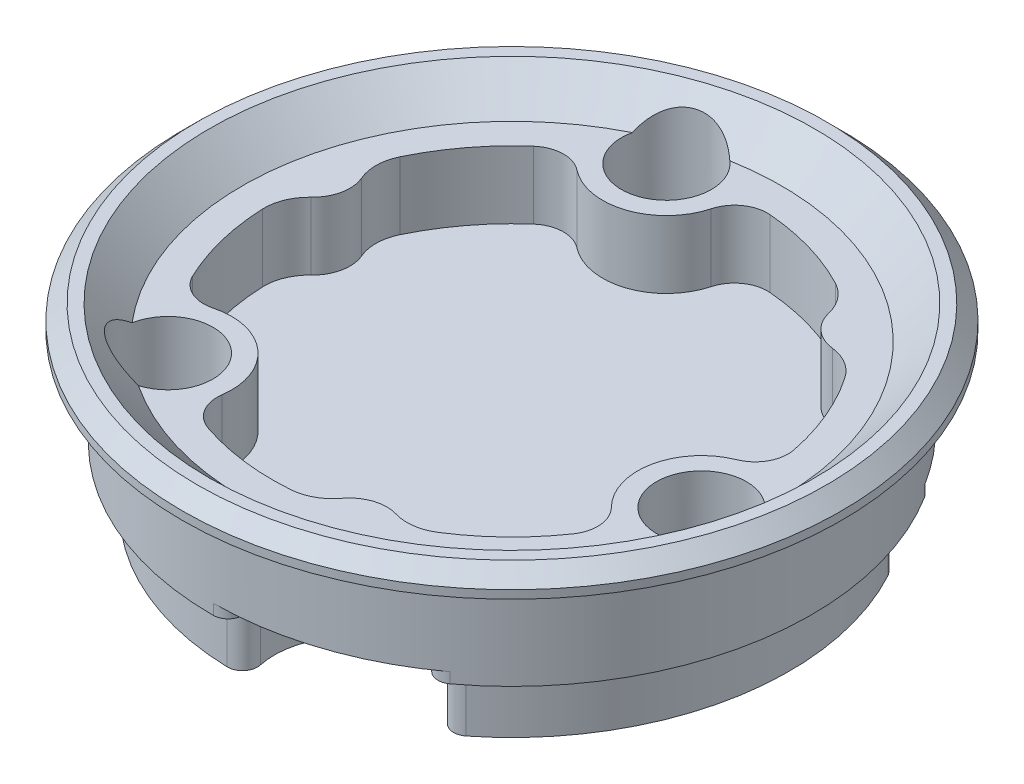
ISO-10303-21;
HEADER;
FILE_DESCRIPTION(('STEP AP214'),'2;1');
FILE_NAME('part.step','',(''),(''),'','','');
FILE_SCHEMA(('AUTOMOTIVE_DESIGN { 1 0 10303 214 1 1 1 1 }'));
ENDSEC;
DATA;
#1=APPLICATION_CONTEXT('core data for automotive mechanical design processes');
#2=APPLICATION_PROTOCOL_DEFINITION('international standard','automotive_design',2000,#1);
#3=PRODUCT_CONTEXT('',#1,'mechanical');
#4=PRODUCT('Part','Part','',(#3));
#5=PRODUCT_RELATED_PRODUCT_CATEGORY('part','',(#4));
#6=PRODUCT_DEFINITION_FORMATION('','',#4);
#7=PRODUCT_DEFINITION_CONTEXT('part definition',#1,'design');
#8=PRODUCT_DEFINITION('design','',#6,#7);
#9=PRODUCT_DEFINITION_SHAPE('','',#8);
#10=(LENGTH_UNIT() NAMED_UNIT(*) SI_UNIT(.MILLI.,.METRE.));
#11=(NAMED_UNIT(*) PLANE_ANGLE_UNIT() SI_UNIT($,.RADIAN.));
#12=(NAMED_UNIT(*) SI_UNIT($,.STERADIAN.) SOLID_ANGLE_UNIT());
#13=UNCERTAINTY_MEASURE_WITH_UNIT(LENGTH_MEASURE(1.E-05),#10,'distance_accuracy_value','');
#14=(GEOMETRIC_REPRESENTATION_CONTEXT(3) GLOBAL_UNCERTAINTY_ASSIGNED_CONTEXT((#13)) GLOBAL_UNIT_ASSIGNED_CONTEXT((#10,
#11,#12)) REPRESENTATION_CONTEXT('',''));
#15=CARTESIAN_POINT('',(0.,0.,0.));
#16=DIRECTION('',(0.,0.,1.));
#17=DIRECTION('',(1.,0.,0.));
#18=AXIS2_PLACEMENT_3D('',#15,#16,#17);
#19=CARTESIAN_POINT('',(-5.12118960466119,20.,-15.4219297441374));
#20=DIRECTION('',(0.,-1.,0.));
#21=DIRECTION('',(0.,0.,-1.));
#22=AXIS2_PLACEMENT_3D('',#19,#20,#21);
#23=CYLINDRICAL_SURFACE('',#22,1.5);
#24=CARTESIAN_POINT('',(-5.12118960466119,25.3,-15.4219297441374));
#25=DIRECTION('',(0.,1.,0.));
#26=DIRECTION('',(0.,0.,1.));
#27=AXIS2_PLACEMENT_3D('',#24,#25,#26);
#28=CIRCLE('',#27,1.5);
#29=CARTESIAN_POINT('',(-5.12118960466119,25.3,-13.9219297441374));
#30=VERTEX_POINT('',#29);
#31=EDGE_CURVE('E1502',#30,#30,#28,.T.);
#32=ORIENTED_EDGE('',*,*,#31,.T.);
#33=EDGE_LOOP('',(#32));
#34=FACE_BOUND('',#33,.T.);
#35=CARTESIAN_POINT('',(-5.12118960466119,20.,-15.4219297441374));
#36=DIRECTION('',(0.,-1.,0.));
#37=DIRECTION('',(0.,0.,-1.));
#38=AXIS2_PLACEMENT_3D('',#35,#36,#37);
#39=CIRCLE('',#38,1.5);
#40=CARTESIAN_POINT('',(-5.12118960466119,20.,-16.9219297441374));
#41=VERTEX_POINT('',#40);
#42=EDGE_CURVE('E816',#41,#41,#39,.T.);
#43=ORIENTED_EDGE('',*,*,#42,.T.);
#44=EDGE_LOOP('',(#43));
#45=FACE_BOUND('',#44,.T.);
#46=ADVANCED_FACE('F53',(#34,#45),#23,.F.);
#47=CARTESIAN_POINT('',(-10.7951881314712,24.,12.1460451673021));
#48=DIRECTION('',(0.,-1.,0.));
#49=DIRECTION('',(0.,0.,-1.));
#50=AXIS2_PLACEMENT_3D('',#47,#48,#49);
#51=CYLINDRICAL_SURFACE('',#50,1.5);
#52=CARTESIAN_POINT('',(-10.7951881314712,25.3,12.1460451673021));
#53=DIRECTION('',(0.,1.,0.));
#54=DIRECTION('',(0.,0.,1.));
#55=AXIS2_PLACEMENT_3D('',#52,#53,#54);
#56=CIRCLE('',#55,1.5);
#57=CARTESIAN_POINT('',(-10.7951881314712,25.3,13.6460451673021));
#58=VERTEX_POINT('',#57);
#59=EDGE_CURVE('E1508',#58,#58,#56,.T.);
#60=ORIENTED_EDGE('',*,*,#59,.T.);
#61=EDGE_LOOP('',(#60));
#62=FACE_BOUND('',#61,.T.);
#63=CARTESIAN_POINT('',(-10.7951881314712,20.,12.1460451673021));
#64=DIRECTION('',(0.,-1.,0.));
#65=DIRECTION('',(0.,0.,-1.));
#66=AXIS2_PLACEMENT_3D('',#63,#64,#65);
#67=CIRCLE('',#66,1.5);
#68=CARTESIAN_POINT('',(-10.7951881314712,20.,10.6460451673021));
#69=VERTEX_POINT('',#68);
#70=EDGE_CURVE('E812',#69,#69,#67,.T.);
#71=ORIENTED_EDGE('',*,*,#70,.T.);
#72=EDGE_LOOP('',(#71));
#73=FACE_BOUND('',#72,.T.);
#74=ADVANCED_FACE('F1430',(#62,#73),#51,.F.);
#75=CARTESIAN_POINT('',(15.9163777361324,24.,3.27588457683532));
#76=DIRECTION('',(0.,-1.,0.));
#77=DIRECTION('',(0.,0.,-1.));
#78=AXIS2_PLACEMENT_3D('',#75,#76,#77);
#79=CYLINDRICAL_SURFACE('',#78,1.5);
#80=CARTESIAN_POINT('',(15.9163777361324,25.3,3.27588457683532));
#81=DIRECTION('',(0.,1.,0.));
#82=DIRECTION('',(0.,0.,1.));
#83=AXIS2_PLACEMENT_3D('',#80,#81,#82);
#84=CIRCLE('',#83,1.5);
#85=CARTESIAN_POINT('',(15.9163777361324,25.3,4.77588457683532));
#86=VERTEX_POINT('',#85);
#87=EDGE_CURVE('E1518',#86,#86,#84,.T.);
#88=ORIENTED_EDGE('',*,*,#87,.T.);
#89=EDGE_LOOP('',(#88));
#90=FACE_BOUND('',#89,.T.);
#91=CARTESIAN_POINT('',(15.9163777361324,20.,3.27588457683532));
#92=DIRECTION('',(0.,-1.,0.));
#93=DIRECTION('',(0.,0.,-1.));
#94=AXIS2_PLACEMENT_3D('',#91,#92,#93);
#95=CIRCLE('',#94,1.5);
#96=CARTESIAN_POINT('',(15.9163777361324,20.,1.77588457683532));
#97=VERTEX_POINT('',#96);
#98=EDGE_CURVE('E792',#97,#97,#95,.T.);
#99=ORIENTED_EDGE('',*,*,#98,.T.);
#100=EDGE_LOOP('',(#99));
#101=FACE_BOUND('',#100,.T.);
#102=ADVANCED_FACE('F1426',(#90,#101),#79,.F.);
#103=CARTESIAN_POINT('',(0.,20.,0.));
#104=DIRECTION('',(0.,-1.,0.));
#105=DIRECTION('',(0.,0.,-1.));
#106=AXIS2_PLACEMENT_3D('',#103,#104,#105);
#107=CYLINDRICAL_SURFACE('',#106,18.5);
#108=CARTESIAN_POINT('',(0.,20.,0.));
#109=DIRECTION('',(0.,1.,0.));
#110=DIRECTION('',(0.,0.,1.));
#111=AXIS2_PLACEMENT_3D('',#108,#109,#110);
#112=CIRCLE('',#111,18.5);
#113=CARTESIAN_POINT('',(6.84071408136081,20.,-17.1887937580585));
#114=VERTEX_POINT('',#113);
#115=CARTESIAN_POINT('',(-15.7638952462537,20.,-9.68243805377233));
#116=VERTEX_POINT('',#115);
#117=EDGE_CURVE('E2067',#114,#116,#112,.T.);
#118=ORIENTED_EDGE('',*,*,#117,.T.);
#119=DIRECTION('',(0.,-1.,0.));
#120=VECTOR('',#119,1.);
#121=CARTESIAN_POINT('',(-15.7638952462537,24.,-9.68243805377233));
#122=LINE('',#121,#120);
#123=CARTESIAN_POINT('',(-15.7638952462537,24.,-9.68243805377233));
#124=VERTEX_POINT('',#123);
#125=EDGE_CURVE('E1716',#124,#116,#122,.T.);
#126=ORIENTED_EDGE('',*,*,#125,.F.);
#127=CARTESIAN_POINT('',(0.,24.,0.));
#128=DIRECTION('',(0.,1.,0.));
#129=DIRECTION('',(0.,0.,1.));
#130=AXIS2_PLACEMENT_3D('',#127,#128,#129);
#131=CIRCLE('',#130,18.5);
#132=CARTESIAN_POINT('',(6.84071408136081,24.,-17.1887937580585));
#133=VERTEX_POINT('',#132);
#134=EDGE_CURVE('E1806',#133,#124,#131,.T.);
#135=ORIENTED_EDGE('',*,*,#134,.F.);
#136=DIRECTION('',(0.,-1.,0.));
#137=VECTOR('',#136,1.);
#138=CARTESIAN_POINT('',(6.84071408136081,24.,-17.1887937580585));
#139=LINE('',#138,#137);
#140=EDGE_CURVE('E1712',#133,#114,#139,.T.);
#141=ORIENTED_EDGE('',*,*,#140,.T.);
#142=EDGE_LOOP('',(#118,#126,#135,#141));
#143=FACE_BOUND('',#142,.T.);
#144=ADVANCED_FACE('F1429',(#143),#107,.T.);
#145=CARTESIAN_POINT('',(-16.7489267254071,20.,-3.44723853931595));
#146=DIRECTION('',(0.,-1.,0.));
#147=DIRECTION('',(0.,0.,-1.));
#148=AXIS2_PLACEMENT_3D('',#145,#146,#147);
#149=CYLINDRICAL_SURFACE('',#148,13.5);
#150=CARTESIAN_POINT('',(-16.7489267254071,20.,-3.44723853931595));
#151=DIRECTION('',(0.,-1.,0.));
#152=DIRECTION('',(0.,0.,-1.));
#153=AXIS2_PLACEMENT_3D('',#150,#151,#152);
#154=CIRCLE('',#153,13.5);
#155=CARTESIAN_POINT('',(-6.70813514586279,20.,-12.4712345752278));
#156=VERTEX_POINT('',#155);
#157=CARTESIAN_POINT('',(-7.61904841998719,20.,-13.3918512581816));
#158=VERTEX_POINT('',#157);
#159=EDGE_CURVE('E789',#156,#158,#154,.F.);
#160=ORIENTED_EDGE('',*,*,#159,.F.);
#161=DIRECTION('',(0.,-1.,0.));
#162=VECTOR('',#161,1.);
#163=CARTESIAN_POINT('',(-6.70813514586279,20.,-12.4712345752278));
#164=LINE('',#163,#162);
#165=CARTESIAN_POINT('',(-6.70813514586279,23.8,-12.4712345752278));
#166=VERTEX_POINT('',#165);
#167=EDGE_CURVE('E1715',#166,#156,#164,.T.);
#168=ORIENTED_EDGE('',*,*,#167,.F.);
#169=CARTESIAN_POINT('',(-16.7489267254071,23.8,-3.44723853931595));
#170=DIRECTION('',(0.,-1.,0.));
#171=DIRECTION('',(0.,0.,-1.));
#172=AXIS2_PLACEMENT_3D('',#169,#170,#171);
#173=CIRCLE('',#172,13.5);
#174=CARTESIAN_POINT('',(-7.6190484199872,23.8,-13.3918512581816));
#175=VERTEX_POINT('',#174);
#176=EDGE_CURVE('E752',#175,#166,#173,.T.);
#177=ORIENTED_EDGE('',*,*,#176,.F.);
#178=DIRECTION('',(0.,-1.,0.));
#179=VECTOR('',#178,1.);
#180=CARTESIAN_POINT('',(-7.61904841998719,70.3923997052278,-13.3918512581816));
#181=LINE('',#180,#179);
#182=EDGE_CURVE('E1027',#175,#158,#181,.T.);
#183=ORIENTED_EDGE('',*,*,#182,.T.);
#184=EDGE_LOOP('',(#160,#168,#177,#183));
#185=FACE_BOUND('',#184,.T.);
#186=ADVANCED_FACE('F1481',(#185),#149,.F.);
#187=CARTESIAN_POINT('',(-5.96437280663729,20.,-13.1396787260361));
#188=DIRECTION('',(0.,-1.,0.));
#189=DIRECTION('',(0.,0.,-1.));
#190=AXIS2_PLACEMENT_3D('',#187,#188,#189);
#191=CYLINDRICAL_SURFACE('',#190,0.999999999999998);
#192=CARTESIAN_POINT('',(-5.96437280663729,20.,-13.1396787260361));
#193=DIRECTION('',(0.,-1.,0.));
#194=DIRECTION('',(0.,0.,-1.));
#195=AXIS2_PLACEMENT_3D('',#192,#193,#194);
#196=CIRCLE('',#195,0.999999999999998);
#197=CARTESIAN_POINT('',(-5.55104135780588,20.,-12.2290980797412));
#198=VERTEX_POINT('',#197);
#199=EDGE_CURVE('E793',#198,#156,#196,.T.);
#200=ORIENTED_EDGE('',*,*,#199,.F.);
#201=DIRECTION('',(0.,-1.,0.));
#202=VECTOR('',#201,1.);
#203=CARTESIAN_POINT('',(-5.55104135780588,20.,-12.2290980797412));
#204=LINE('',#203,#202);
#205=CARTESIAN_POINT('',(-5.55104135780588,23.8,-12.2290980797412));
#206=VERTEX_POINT('',#205);
#207=EDGE_CURVE('E606',#206,#198,#204,.T.);
#208=ORIENTED_EDGE('',*,*,#207,.F.);
#209=CARTESIAN_POINT('',(-5.96437280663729,23.8,-13.1396787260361));
#210=DIRECTION('',(0.,1.,0.));
#211=DIRECTION('',(0.,0.,-1.));
#212=AXIS2_PLACEMENT_3D('',#209,#210,#211);
#213=CIRCLE('',#212,0.999999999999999);
#214=EDGE_CURVE('E621',#166,#206,#213,.T.);
#215=ORIENTED_EDGE('',*,*,#214,.F.);
#216=ORIENTED_EDGE('',*,*,#167,.T.);
#217=EDGE_LOOP('',(#200,#208,#215,#216));
#218=FACE_BOUND('',#217,.T.);
#219=ADVANCED_FACE('F1485',(#218),#191,.T.);
#220=CARTESIAN_POINT('',(0.,20.,0.));
#221=DIRECTION('',(0.,-1.,0.));
#222=DIRECTION('',(0.,0.,-1.));
#223=AXIS2_PLACEMENT_3D('',#220,#221,#222);
#224=CYLINDRICAL_SURFACE('',#223,13.43);
#225=CARTESIAN_POINT('',(0.,20.,0.));
#226=DIRECTION('',(0.,-1.,0.));
#227=DIRECTION('',(0.,0.,-1.));
#228=AXIS2_PLACEMENT_3D('',#225,#226,#227);
#229=CIRCLE('',#228,13.43);
#230=CARTESIAN_POINT('',(-2.86683103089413,20.,-13.1204489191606));
#231=VERTEX_POINT('',#230);
#232=EDGE_CURVE('E601',#231,#198,#229,.F.);
#233=ORIENTED_EDGE('',*,*,#232,.F.);
#234=DIRECTION('',(0.,-1.,0.));
#235=VECTOR('',#234,1.);
#236=CARTESIAN_POINT('',(-2.86683103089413,20.,-13.1204489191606));
#237=LINE('',#236,#235);
#238=CARTESIAN_POINT('',(-2.86683103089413,23.8,-13.1204489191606));
#239=VERTEX_POINT('',#238);
#240=EDGE_CURVE('E594',#239,#231,#237,.T.);
#241=ORIENTED_EDGE('',*,*,#240,.F.);
#242=CARTESIAN_POINT('',(0.,23.8,0.));
#243=DIRECTION('',(0.,-1.,0.));
#244=DIRECTION('',(0.,0.,-1.));
#245=AXIS2_PLACEMENT_3D('',#242,#243,#244);
#246=CIRCLE('',#245,13.43);
#247=EDGE_CURVE('E599',#206,#239,#246,.T.);
#248=ORIENTED_EDGE('',*,*,#247,.F.);
#249=ORIENTED_EDGE('',*,*,#207,.T.);
#250=EDGE_LOOP('',(#233,#241,#248,#249));
#251=FACE_BOUND('',#250,.T.);
#252=ADVANCED_FACE('F596',(#251),#224,.F.);
#253=CARTESIAN_POINT('',(-3.08029573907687,20.,-14.097399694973));
#254=DIRECTION('',(0.,-1.,0.));
#255=DIRECTION('',(0.,0.,-1.));
#256=AXIS2_PLACEMENT_3D('',#253,#254,#255);
#257=CYLINDRICAL_SURFACE('',#256,1.);
#258=CARTESIAN_POINT('',(-3.08029573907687,20.,-14.097399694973));
#259=DIRECTION('',(0.,-1.,0.));
#260=DIRECTION('',(0.,0.,-1.));
#261=AXIS2_PLACEMENT_3D('',#258,#259,#260);
#262=CIRCLE('',#261,1.);
#263=CARTESIAN_POINT('',(-2.08442296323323,20.,-14.0066394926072));
#264=VERTEX_POINT('',#263);
#265=EDGE_CURVE('E802',#264,#231,#262,.T.);
#266=ORIENTED_EDGE('',*,*,#265,.F.);
#267=DIRECTION('',(0.,-1.,0.));
#268=VECTOR('',#267,1.);
#269=CARTESIAN_POINT('',(-2.08442296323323,20.,-14.0066394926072));
#270=LINE('',#269,#268);
#271=CARTESIAN_POINT('',(-2.08442296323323,23.8,-14.0066394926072));
#272=VERTEX_POINT('',#271);
#273=EDGE_CURVE('E605',#272,#264,#270,.T.);
#274=ORIENTED_EDGE('',*,*,#273,.F.);
#275=CARTESIAN_POINT('',(-3.08029573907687,23.8,-14.097399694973));
#276=DIRECTION('',(0.,1.,0.));
#277=DIRECTION('',(0.,0.,-1.));
#278=AXIS2_PLACEMENT_3D('',#275,#276,#277);
#279=CIRCLE('',#278,1.);
#280=EDGE_CURVE('E609',#239,#272,#279,.T.);
#281=ORIENTED_EDGE('',*,*,#280,.F.);
#282=ORIENTED_EDGE('',*,*,#240,.T.);
#283=EDGE_LOOP('',(#266,#274,#281,#282));
#284=FACE_BOUND('',#283,.T.);
#285=ADVANCED_FACE('F610',(#284),#257,.T.);
#286=CARTESIAN_POINT('',(11.3598595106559,20.,-12.7813767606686));
#287=DIRECTION('',(0.,-1.,0.));
#288=DIRECTION('',(0.,0.,-1.));
#289=AXIS2_PLACEMENT_3D('',#286,#287,#288);
#290=CYLINDRICAL_SURFACE('',#289,13.5);
#291=CARTESIAN_POINT('',(11.3598595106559,20.,-12.7813767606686));
#292=DIRECTION('',(0.,-1.,0.));
#293=DIRECTION('',(0.,0.,-1.));
#294=AXIS2_PLACEMENT_3D('',#291,#292,#293);
#295=CIRCLE('',#294,13.5);
#296=CARTESIAN_POINT('',(-2.00600444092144,20.,-14.6797130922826));
#297=VERTEX_POINT('',#296);
#298=EDGE_CURVE('E799',#297,#264,#295,.F.);
#299=ORIENTED_EDGE('',*,*,#298,.F.);
#300=DIRECTION('',(0.,-1.,0.));
#301=VECTOR('',#300,1.);
#302=CARTESIAN_POINT('',(-2.00600444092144,70.3923997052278,-14.6797130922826));
#303=LINE('',#302,#301);
#304=CARTESIAN_POINT('',(-2.00600444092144,23.8,-14.6797130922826));
#305=VERTEX_POINT('',#304);
#306=EDGE_CURVE('E1023',#305,#297,#303,.T.);
#307=ORIENTED_EDGE('',*,*,#306,.F.);
#308=CARTESIAN_POINT('',(11.3598595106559,23.8,-12.7813767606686));
#309=DIRECTION('',(0.,-1.,0.));
#310=DIRECTION('',(0.,0.,-1.));
#311=AXIS2_PLACEMENT_3D('',#308,#309,#310);
#312=CIRCLE('',#311,13.5);
#313=EDGE_CURVE('E616',#272,#305,#312,.T.);
#314=ORIENTED_EDGE('',*,*,#313,.F.);
#315=ORIENTED_EDGE('',*,*,#273,.T.);
#316=EDGE_LOOP('',(#299,#307,#314,#315));
#317=FACE_BOUND('',#316,.T.);
#318=ADVANCED_FACE('F1463',(#317),#290,.F.);
#319=CARTESIAN_POINT('',(0.,24.,0.));
#320=DIRECTION('',(0.,-1.,0.));
#321=DIRECTION('',(0.,0.,-1.));
#322=AXIS2_PLACEMENT_3D('',#319,#320,#321);
#323=CYLINDRICAL_SURFACE('',#322,18.5);
#324=CARTESIAN_POINT('',(0.,20.,0.));
#325=DIRECTION('',(0.,1.,0.));
#326=DIRECTION('',(0.,0.,1.));
#327=AXIS2_PLACEMENT_3D('',#324,#325,#326);
#328=CIRCLE('',#327,18.5);
#329=CARTESIAN_POINT('',(-18.3062890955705,20.,2.67016470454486));
#330=VERTEX_POINT('',#329);
#331=CARTESIAN_POINT('',(-0.503289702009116,20.,18.4931527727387));
#332=VERTEX_POINT('',#331);
#333=EDGE_CURVE('E1821',#330,#332,#328,.T.);
#334=ORIENTED_EDGE('',*,*,#333,.T.);
#335=DIRECTION('',(0.,-1.,0.));
#336=VECTOR('',#335,1.);
#337=CARTESIAN_POINT('',(-0.503289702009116,24.,18.4931527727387));
#338=LINE('',#337,#336);
#339=CARTESIAN_POINT('',(-0.503289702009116,24.,18.4931527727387));
#340=VERTEX_POINT('',#339);
#341=EDGE_CURVE('E1976',#340,#332,#338,.T.);
#342=ORIENTED_EDGE('',*,*,#341,.F.);
#343=CARTESIAN_POINT('',(0.,24.,0.));
#344=DIRECTION('',(0.,1.,0.));
#345=DIRECTION('',(0.,0.,1.));
#346=AXIS2_PLACEMENT_3D('',#343,#344,#345);
#347=CIRCLE('',#346,18.5);
#348=CARTESIAN_POINT('',(-18.3062890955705,24.,2.67016470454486));
#349=VERTEX_POINT('',#348);
#350=EDGE_CURVE('E1854',#349,#340,#347,.T.);
#351=ORIENTED_EDGE('',*,*,#350,.F.);
#352=DIRECTION('',(0.,-1.,0.));
#353=VECTOR('',#352,1.);
#354=CARTESIAN_POINT('',(-18.3062890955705,24.,2.67016470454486));
#355=LINE('',#354,#353);
#356=EDGE_CURVE('E1973',#349,#330,#355,.T.);
#357=ORIENTED_EDGE('',*,*,#356,.T.);
#358=EDGE_LOOP('',(#334,#342,#351,#357));
#359=FACE_BOUND('',#358,.T.);
#360=ADVANCED_FACE('F1448',(#359),#323,.T.);
#361=CARTESIAN_POINT('',(0.,24.,0.));
#362=DIRECTION('',(0.,-1.,0.));
#363=DIRECTION('',(0.,0.,-1.));
#364=AXIS2_PLACEMENT_3D('',#361,#362,#363);
#365=CYLINDRICAL_SURFACE('',#364,18.5);
#366=CARTESIAN_POINT('',(0.,20.,0.));
#367=DIRECTION('',(0.,1.,0.));
#368=DIRECTION('',(0.,0.,1.));
#369=AXIS2_PLACEMENT_3D('',#366,#367,#368);
#370=CIRCLE('',#369,18.5);
#371=CARTESIAN_POINT('',(11.4655750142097,20.,14.5186290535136));
#372=VERTEX_POINT('',#371);
#373=CARTESIAN_POINT('',(16.2671849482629,20.,-8.81071471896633));
#374=VERTEX_POINT('',#373);
#375=EDGE_CURVE('E1776',#372,#374,#370,.T.);
#376=ORIENTED_EDGE('',*,*,#375,.T.);
#377=DIRECTION('',(0.,-1.,0.));
#378=VECTOR('',#377,1.);
#379=CARTESIAN_POINT('',(16.2671849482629,24.,-8.81071471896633));
#380=LINE('',#379,#378);
#381=CARTESIAN_POINT('',(16.2671849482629,24.,-8.81071471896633));
#382=VERTEX_POINT('',#381);
#383=EDGE_CURVE('E2029',#382,#374,#380,.T.);
#384=ORIENTED_EDGE('',*,*,#383,.F.);
#385=CARTESIAN_POINT('',(0.,24.,0.));
#386=DIRECTION('',(0.,1.,0.));
#387=DIRECTION('',(0.,0.,1.));
#388=AXIS2_PLACEMENT_3D('',#385,#386,#387);
#389=CIRCLE('',#388,18.5);
#390=CARTESIAN_POINT('',(11.4655750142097,24.,14.5186290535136));
#391=VERTEX_POINT('',#390);
#392=EDGE_CURVE('E1740',#391,#382,#389,.T.);
#393=ORIENTED_EDGE('',*,*,#392,.F.);
#394=DIRECTION('',(0.,-1.,0.));
#395=VECTOR('',#394,1.);
#396=CARTESIAN_POINT('',(11.4655750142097,24.,14.5186290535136));
#397=LINE('',#396,#395);
#398=EDGE_CURVE('E1849',#391,#372,#397,.T.);
#399=ORIENTED_EDGE('',*,*,#398,.T.);
#400=EDGE_LOOP('',(#376,#384,#393,#399));
#401=FACE_BOUND('',#400,.T.);
#402=ADVANCED_FACE('F1410',(#401),#365,.T.);
#403=CARTESIAN_POINT('',(0.,20.,0.));
#404=DIRECTION('',(0.,-1.,0.));
#405=DIRECTION('',(0.,0.,-1.));
#406=AXIS2_PLACEMENT_3D('',#403,#404,#405);
#407=CYLINDRICAL_SURFACE('',#406,13.43);
#408=CARTESIAN_POINT('',(0.,20.,0.));
#409=DIRECTION('',(0.,-1.,0.));
#410=DIRECTION('',(0.,0.,-1.));
#411=AXIS2_PLACEMENT_3D('',#408,#409,#410);
#412=CIRCLE('',#411,13.43);
#413=CARTESIAN_POINT('',(-9.9292265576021,20.,9.04297296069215));
#414=VERTEX_POINT('',#413);
#415=CARTESIAN_POINT('',(-7.8151889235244,20.,10.9218918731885));
#416=VERTEX_POINT('',#415);
#417=EDGE_CURVE('E785',#414,#416,#412,.F.);
#418=ORIENTED_EDGE('',*,*,#417,.F.);
#419=DIRECTION('',(0.,-1.,0.));
#420=VECTOR('',#419,1.);
#421=CARTESIAN_POINT('',(-9.9292265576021,20.,9.04297296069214));
#422=LINE('',#421,#420);
#423=CARTESIAN_POINT('',(-9.9292265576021,23.8,9.04297296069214));
#424=VERTEX_POINT('',#423);
#425=EDGE_CURVE('E1875',#424,#414,#422,.T.);
#426=ORIENTED_EDGE('',*,*,#425,.F.);
#427=CARTESIAN_POINT('',(0.,23.8,0.));
#428=DIRECTION('',(0.,-1.,0.));
#429=DIRECTION('',(0.,0.,-1.));
#430=AXIS2_PLACEMENT_3D('',#427,#428,#429);
#431=CIRCLE('',#430,13.43);
#432=CARTESIAN_POINT('',(-7.81518892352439,23.8,10.9218918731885));
#433=VERTEX_POINT('',#432);
#434=EDGE_CURVE('E712',#433,#424,#431,.T.);
#435=ORIENTED_EDGE('',*,*,#434,.F.);
#436=DIRECTION('',(0.,-1.,0.));
#437=VECTOR('',#436,1.);
#438=CARTESIAN_POINT('',(-7.8151889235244,20.,10.9218918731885));
#439=LINE('',#438,#437);
#440=EDGE_CURVE('E1869',#433,#416,#439,.T.);
#441=ORIENTED_EDGE('',*,*,#440,.T.);
#442=EDGE_LOOP('',(#418,#426,#435,#441));
#443=FACE_BOUND('',#442,.T.);
#444=ADVANCED_FACE('F1406',(#443),#407,.F.);
#445=CARTESIAN_POINT('',(-10.6685583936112,20.,9.71631420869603));
#446=DIRECTION('',(0.,-1.,0.));
#447=DIRECTION('',(0.,0.,-1.));
#448=AXIS2_PLACEMENT_3D('',#445,#446,#447);
#449=CYLINDRICAL_SURFACE('',#448,0.999999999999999);
#450=CARTESIAN_POINT('',(-10.6685583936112,20.,9.71631420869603));
#451=DIRECTION('',(0.,-1.,0.));
#452=DIRECTION('',(0.,0.,-1.));
#453=AXIS2_PLACEMENT_3D('',#450,#451,#452);
#454=CIRCLE('',#453,0.999999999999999);
#455=CARTESIAN_POINT('',(-11.0878941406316,20.,8.8084829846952));
#456=VERTEX_POINT('',#455);
#457=EDGE_CURVE('E782',#456,#414,#454,.T.);
#458=ORIENTED_EDGE('',*,*,#457,.F.);
#459=DIRECTION('',(0.,-1.,0.));
#460=VECTOR('',#459,1.);
#461=CARTESIAN_POINT('',(-11.0878941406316,20.,8.8084829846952));
#462=LINE('',#461,#460);
#463=CARTESIAN_POINT('',(-11.0878941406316,23.8,8.8084829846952));
#464=VERTEX_POINT('',#463);
#465=EDGE_CURVE('E1870',#464,#456,#462,.T.);
#466=ORIENTED_EDGE('',*,*,#465,.F.);
#467=CARTESIAN_POINT('',(-10.6685583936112,23.8,9.71631420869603));
#468=DIRECTION('',(0.,1.,0.));
#469=DIRECTION('',(0.,0.,-1.));
#470=AXIS2_PLACEMENT_3D('',#467,#468,#469);
#471=CIRCLE('',#470,0.999999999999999);
#472=EDGE_CURVE('E716',#424,#464,#471,.T.);
#473=ORIENTED_EDGE('',*,*,#472,.F.);
#474=ORIENTED_EDGE('',*,*,#425,.T.);
#475=EDGE_LOOP('',(#458,#466,#473,#474));
#476=FACE_BOUND('',#475,.T.);
#477=ADVANCED_FACE('F1409',(#476),#449,.T.);
#478=CARTESIAN_POINT('',(-16.7489267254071,20.,-3.44723853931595));
#479=DIRECTION('',(0.,-1.,0.));
#480=DIRECTION('',(0.,0.,-1.));
#481=AXIS2_PLACEMENT_3D('',#478,#479,#480);
#482=CYLINDRICAL_SURFACE('',#481,13.5);
#483=CARTESIAN_POINT('',(-16.7489267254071,20.,-3.44723853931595));
#484=DIRECTION('',(0.,-1.,0.));
#485=DIRECTION('',(0.,0.,-1.));
#486=AXIS2_PLACEMENT_3D('',#483,#484,#485);
#487=CIRCLE('',#486,13.5);
#488=CARTESIAN_POINT('',(-12.2883279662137,20.,9.29454542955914));
#489=VERTEX_POINT('',#488);
#490=EDGE_CURVE('E779',#489,#456,#487,.F.);
#491=ORIENTED_EDGE('',*,*,#490,.F.);
#492=DIRECTION('',(0.,-1.,0.));
#493=VECTOR('',#492,1.);
#494=CARTESIAN_POINT('',(-12.2883279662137,70.3923997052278,9.29454542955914));
#495=LINE('',#494,#493);
#496=CARTESIAN_POINT('',(-12.2883279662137,23.8,9.29454542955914));
#497=VERTEX_POINT('',#496);
#498=EDGE_CURVE('E1049',#497,#489,#495,.T.);
#499=ORIENTED_EDGE('',*,*,#498,.F.);
#500=CARTESIAN_POINT('',(-16.7489267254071,23.8,-3.44723853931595));
#501=DIRECTION('',(0.,-1.,0.));
#502=DIRECTION('',(0.,0.,-1.));
#503=AXIS2_PLACEMENT_3D('',#500,#501,#502);
#504=CIRCLE('',#503,13.5);
#505=EDGE_CURVE('E720',#464,#497,#504,.T.);
#506=ORIENTED_EDGE('',*,*,#505,.F.);
#507=ORIENTED_EDGE('',*,*,#465,.T.);
#508=EDGE_LOOP('',(#491,#499,#506,#507));
#509=FACE_BOUND('',#508,.T.);
#510=ADVANCED_FACE('F1414',(#509),#482,.F.);
#511=CARTESIAN_POINT('',(5.38906721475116,20.,16.2286152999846));
#512=DIRECTION('',(0.,-1.,0.));
#513=DIRECTION('',(0.,0.,-1.));
#514=AXIS2_PLACEMENT_3D('',#511,#512,#513);
#515=CYLINDRICAL_SURFACE('',#514,13.5);
#516=CARTESIAN_POINT('',(5.38906721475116,20.,16.2286152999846));
#517=DIRECTION('',(0.,-1.,0.));
#518=DIRECTION('',(0.,0.,-1.));
#519=AXIS2_PLACEMENT_3D('',#516,#517,#518);
#520=CIRCLE('',#519,13.5);
#521=CARTESIAN_POINT('',(-7.44633838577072,20.,12.0450327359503));
#522=VERTEX_POINT('',#521);
#523=CARTESIAN_POINT('',(-7.78815918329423,20.,13.2942151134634));
#524=VERTEX_POINT('',#523);
#525=EDGE_CURVE('E796',#522,#524,#520,.F.);
#526=ORIENTED_EDGE('',*,*,#525,.F.);
#527=DIRECTION('',(0.,-1.,0.));
#528=VECTOR('',#527,1.);
#529=CARTESIAN_POINT('',(-7.44633838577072,20.,12.0450327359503));
#530=LINE('',#529,#528);
#531=CARTESIAN_POINT('',(-7.44633838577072,23.8,12.0450327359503));
#532=VERTEX_POINT('',#531);
#533=EDGE_CURVE('E1865',#532,#522,#530,.T.);
#534=ORIENTED_EDGE('',*,*,#533,.F.);
#535=CARTESIAN_POINT('',(5.38906721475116,23.8,16.2286152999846));
#536=DIRECTION('',(0.,-1.,0.));
#537=DIRECTION('',(0.,0.,-1.));
#538=AXIS2_PLACEMENT_3D('',#535,#536,#537);
#539=CIRCLE('',#538,13.5);
#540=CARTESIAN_POINT('',(-7.78815918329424,23.8,13.2942151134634));
#541=VERTEX_POINT('',#540);
#542=EDGE_CURVE('E704',#541,#532,#539,.T.);
#543=ORIENTED_EDGE('',*,*,#542,.F.);
#544=DIRECTION('',(0.,-1.,0.));
#545=VECTOR('',#544,1.);
#546=CARTESIAN_POINT('',(-7.78815918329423,70.3923997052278,13.2942151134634));
#547=LINE('',#546,#545);
#548=EDGE_CURVE('E1053',#541,#524,#547,.T.);
#549=ORIENTED_EDGE('',*,*,#548,.T.);
#550=EDGE_LOOP('',(#526,#534,#543,#549));
#551=FACE_BOUND('',#550,.T.);
#552=ADVANCED_FACE('F1418',(#551),#515,.F.);
#553=CARTESIAN_POINT('',(-8.39710917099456,20.,11.735137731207));
#554=DIRECTION('',(0.,-1.,0.));
#555=DIRECTION('',(0.,0.,-1.));
#556=AXIS2_PLACEMENT_3D('',#553,#554,#555);
#557=CYLINDRICAL_SURFACE('',#556,1.);
#558=CARTESIAN_POINT('',(-8.39710917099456,20.,11.735137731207));
#559=DIRECTION('',(0.,-1.,0.));
#560=DIRECTION('',(0.,0.,-1.));
#561=AXIS2_PLACEMENT_3D('',#558,#559,#560);
#562=CIRCLE('',#561,1.);
#563=EDGE_CURVE('E788',#416,#522,#562,.T.);
#564=ORIENTED_EDGE('',*,*,#563,.F.);
#565=ORIENTED_EDGE('',*,*,#440,.F.);
#566=CARTESIAN_POINT('',(-8.39710917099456,23.8,11.735137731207));
#567=DIRECTION('',(0.,1.,0.));
#568=DIRECTION('',(0.,0.,-1.));
#569=AXIS2_PLACEMENT_3D('',#566,#567,#568);
#570=CIRCLE('',#569,1.);
#571=EDGE_CURVE('E708',#532,#433,#570,.T.);
#572=ORIENTED_EDGE('',*,*,#571,.F.);
#573=ORIENTED_EDGE('',*,*,#533,.T.);
#574=EDGE_LOOP('',(#564,#565,#572,#573));
#575=FACE_BOUND('',#574,.T.);
#576=ADVANCED_FACE('F1404',(#575),#557,.T.);
#577=CARTESIAN_POINT('',(14.3614819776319,20.,1.40454099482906));
#578=DIRECTION('',(0.,-1.,0.));
#579=DIRECTION('',(0.,0.,-1.));
#580=AXIS2_PLACEMENT_3D('',#577,#578,#579);
#581=CYLINDRICAL_SURFACE('',#580,1.);
#582=CARTESIAN_POINT('',(14.3614819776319,20.,1.40454099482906));
#583=DIRECTION('',(0.,-1.,0.));
#584=DIRECTION('',(0.,0.,-1.));
#585=AXIS2_PLACEMENT_3D('',#582,#583,#584);
#586=CIRCLE('',#585,1.);
#587=CARTESIAN_POINT('',(13.3662302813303,20.,1.30720620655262));
#588=VERTEX_POINT('',#587);
#589=CARTESIAN_POINT('',(14.1544735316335,20.,0.426201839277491));
#590=VERTEX_POINT('',#589);
#591=EDGE_CURVE('E767',#588,#590,#586,.T.);
#592=ORIENTED_EDGE('',*,*,#591,.F.);
#593=DIRECTION('',(0.,-1.,0.));
#594=VECTOR('',#593,1.);
#595=CARTESIAN_POINT('',(13.3662302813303,20.,1.30720620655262));
#596=LINE('',#595,#594);
#597=CARTESIAN_POINT('',(13.3662302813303,23.8,1.30720620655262));
#598=VERTEX_POINT('',#597);
#599=EDGE_CURVE('E1901',#598,#588,#596,.T.);
#600=ORIENTED_EDGE('',*,*,#599,.F.);
#601=CARTESIAN_POINT('',(14.3614819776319,23.8,1.40454099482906));
#602=DIRECTION('',(0.,1.,0.));
#603=DIRECTION('',(0.,0.,-1.));
#604=AXIS2_PLACEMENT_3D('',#601,#602,#603);
#605=CIRCLE('',#604,1.);
#606=CARTESIAN_POINT('',(14.1544735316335,23.8,0.426201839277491));
#607=VERTEX_POINT('',#606);
#608=EDGE_CURVE('E660',#607,#598,#605,.T.);
#609=ORIENTED_EDGE('',*,*,#608,.F.);
#610=DIRECTION('',(0.,-1.,0.));
#611=VECTOR('',#610,1.);
#612=CARTESIAN_POINT('',(14.1544735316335,20.,0.426201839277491));
#613=LINE('',#612,#611);
#614=EDGE_CURVE('E1634',#607,#590,#613,.T.);
#615=ORIENTED_EDGE('',*,*,#614,.T.);
#616=EDGE_LOOP('',(#592,#600,#609,#615));
#617=FACE_BOUND('',#616,.T.);
#618=ADVANCED_FACE('F1400',(#617),#581,.T.);
#619=CARTESIAN_POINT('',(0.,20.,0.));
#620=DIRECTION('',(0.,-1.,0.));
#621=DIRECTION('',(0.,0.,-1.));
#622=AXIS2_PLACEMENT_3D('',#619,#620,#621);
#623=CYLINDRICAL_SURFACE('',#622,13.43);
#624=CARTESIAN_POINT('',(0.,20.,0.));
#625=DIRECTION('',(0.,-1.,0.));
#626=DIRECTION('',(0.,0.,-1.));
#627=AXIS2_PLACEMENT_3D('',#624,#625,#626);
#628=CIRCLE('',#627,13.43);
#629=CARTESIAN_POINT('',(12.7960575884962,20.,4.07747595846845));
#630=VERTEX_POINT('',#629);
#631=EDGE_CURVE('E770',#630,#588,#628,.F.);
#632=ORIENTED_EDGE('',*,*,#631,.F.);
#633=DIRECTION('',(0.,-1.,0.));
#634=VECTOR('',#633,1.);
#635=CARTESIAN_POINT('',(12.7960575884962,20.,4.07747595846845));
#636=LINE('',#635,#634);
#637=CARTESIAN_POINT('',(12.7960575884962,23.8,4.07747595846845));
#638=VERTEX_POINT('',#637);
#639=EDGE_CURVE('E1904',#638,#630,#636,.T.);
#640=ORIENTED_EDGE('',*,*,#639,.F.);
#641=CARTESIAN_POINT('',(0.,23.8,0.));
#642=DIRECTION('',(0.,-1.,0.));
#643=DIRECTION('',(0.,0.,-1.));
#644=AXIS2_PLACEMENT_3D('',#641,#642,#643);
#645=CIRCLE('',#644,13.43);
#646=EDGE_CURVE('E664',#598,#638,#645,.T.);
#647=ORIENTED_EDGE('',*,*,#646,.F.);
#648=ORIENTED_EDGE('',*,*,#599,.T.);
#649=EDGE_LOOP('',(#632,#640,#647,#648));
#650=FACE_BOUND('',#649,.T.);
#651=ADVANCED_FACE('F1396',(#650),#623,.F.);
#652=CARTESIAN_POINT('',(13.7488541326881,20.,4.38108548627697));
#653=DIRECTION('',(0.,-1.,0.));
#654=DIRECTION('',(0.,0.,-1.));
#655=AXIS2_PLACEMENT_3D('',#652,#653,#654);
#656=CYLINDRICAL_SURFACE('',#655,1.);
#657=CARTESIAN_POINT('',(13.7488541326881,20.,4.38108548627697));
#658=DIRECTION('',(0.,-1.,0.));
#659=DIRECTION('',(0.,0.,-1.));
#660=AXIS2_PLACEMENT_3D('',#657,#658,#659);
#661=CIRCLE('',#660,1.);
#662=CARTESIAN_POINT('',(13.1723171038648,20.,5.19815650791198));
#663=VERTEX_POINT('',#662);
#664=EDGE_CURVE('E773',#663,#630,#661,.T.);
#665=ORIENTED_EDGE('',*,*,#664,.F.);
#666=DIRECTION('',(0.,-1.,0.));
#667=VECTOR('',#666,1.);
#668=CARTESIAN_POINT('',(13.1723171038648,20.,5.19815650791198));
#669=LINE('',#668,#667);
#670=CARTESIAN_POINT('',(13.1723171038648,23.8,5.19815650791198));
#671=VERTEX_POINT('',#670);
#672=EDGE_CURVE('E1931',#671,#663,#669,.T.);
#673=ORIENTED_EDGE('',*,*,#672,.F.);
#674=CARTESIAN_POINT('',(13.7488541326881,23.8,4.38108548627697));
#675=DIRECTION('',(0.,1.,0.));
#676=DIRECTION('',(0.,0.,-1.));
#677=AXIS2_PLACEMENT_3D('',#674,#675,#676);
#678=CIRCLE('',#677,1.);
#679=EDGE_CURVE('E668',#638,#671,#678,.T.);
#680=ORIENTED_EDGE('',*,*,#679,.F.);
#681=ORIENTED_EDGE('',*,*,#639,.T.);
#682=EDGE_LOOP('',(#665,#673,#680,#681));
#683=FACE_BOUND('',#682,.T.);
#684=ADVANCED_FACE('F1392',(#683),#656,.T.);
#685=CARTESIAN_POINT('',(5.38906721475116,20.,16.2286152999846));
#686=DIRECTION('',(0.,-1.,0.));
#687=DIRECTION('',(0.,0.,-1.));
#688=AXIS2_PLACEMENT_3D('',#685,#686,#687);
#689=CYLINDRICAL_SURFACE('',#688,13.5);
#690=CARTESIAN_POINT('',(5.38906721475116,20.,16.2286152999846));
#691=DIRECTION('',(0.,-1.,0.));
#692=DIRECTION('',(0.,0.,-1.));
#693=AXIS2_PLACEMENT_3D('',#690,#691,#692);
#694=CIRCLE('',#693,13.5);
#695=CARTESIAN_POINT('',(14.1934764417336,20.,5.99473147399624));
#696=VERTEX_POINT('',#695);
#697=EDGE_CURVE('E776',#696,#663,#694,.F.);
#698=ORIENTED_EDGE('',*,*,#697,.F.);
#699=DIRECTION('',(0.,-1.,0.));
#700=VECTOR('',#699,1.);
#701=CARTESIAN_POINT('',(14.1934764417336,70.3923997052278,5.99473147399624));
#702=LINE('',#701,#700);
#703=CARTESIAN_POINT('',(14.1934764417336,23.8,5.99473147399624));
#704=VERTEX_POINT('',#703);
#705=EDGE_CURVE('E1075',#704,#696,#702,.T.);
#706=ORIENTED_EDGE('',*,*,#705,.F.);
#707=CARTESIAN_POINT('',(5.38906721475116,23.8,16.2286152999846));
#708=DIRECTION('',(0.,-1.,0.));
#709=DIRECTION('',(0.,0.,-1.));
#710=AXIS2_PLACEMENT_3D('',#707,#708,#709);
#711=CIRCLE('',#710,13.5);
#712=EDGE_CURVE('E672',#671,#704,#711,.T.);
#713=ORIENTED_EDGE('',*,*,#712,.F.);
#714=ORIENTED_EDGE('',*,*,#672,.T.);
#715=EDGE_LOOP('',(#698,#706,#713,#714));
#716=FACE_BOUND('',#715,.T.);
#717=ADVANCED_FACE('F1388',(#716),#689,.F.);
#718=CARTESIAN_POINT('',(11.3598595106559,20.,-12.7813767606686));
#719=DIRECTION('',(0.,-1.,0.));
#720=DIRECTION('',(0.,0.,-1.));
#721=AXIS2_PLACEMENT_3D('',#718,#719,#720);
#722=CYLINDRICAL_SURFACE('',#721,13.5);
#723=CARTESIAN_POINT('',(11.3598595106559,20.,-12.7813767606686));
#724=DIRECTION('',(0.,-1.,0.));
#725=DIRECTION('',(0.,0.,-1.));
#726=AXIS2_PLACEMENT_3D('',#723,#724,#725);
#727=CIRCLE('',#726,13.5);
#728=CARTESIAN_POINT('',(14.8136926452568,20.,0.269333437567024));
#729=VERTEX_POINT('',#728);
#730=EDGE_CURVE('E764',#590,#729,#727,.F.);
#731=ORIENTED_EDGE('',*,*,#730,.F.);
#732=ORIENTED_EDGE('',*,*,#614,.F.);
#733=CARTESIAN_POINT('',(11.3598595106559,23.8,-12.7813767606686));
#734=DIRECTION('',(0.,-1.,0.));
#735=DIRECTION('',(0.,0.,-1.));
#736=AXIS2_PLACEMENT_3D('',#733,#734,#735);
#737=CIRCLE('',#736,13.5);
#738=CARTESIAN_POINT('',(14.8136926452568,23.8,0.269333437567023));
#739=VERTEX_POINT('',#738);
#740=EDGE_CURVE('E656',#739,#607,#737,.T.);
#741=ORIENTED_EDGE('',*,*,#740,.F.);
#742=DIRECTION('',(0.,-1.,0.));
#743=VECTOR('',#742,1.);
#744=CARTESIAN_POINT('',(14.8136926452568,70.3923997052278,0.269333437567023));
#745=LINE('',#744,#743);
#746=EDGE_CURVE('E1079',#739,#729,#745,.T.);
#747=ORIENTED_EDGE('',*,*,#746,.T.);
#748=EDGE_LOOP('',(#731,#732,#741,#747));
#749=FACE_BOUND('',#748,.T.);
#750=ADVANCED_FACE('F1384',(#749),#722,.F.);
#751=CARTESIAN_POINT('',(3.2354728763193,20.,-8.12983488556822));
#752=DIRECTION('',(0.,1.,0.));
#753=DIRECTION('',(0.,0.,1.));
#754=AXIS2_PLACEMENT_3D('',#751,#752,#753);
#755=PLANE('',#754);
#756=ORIENTED_EDGE('',*,*,#159,.T.);
#757=CARTESIAN_POINT('',(-9.0392517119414,20.,-11.8449115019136));
#758=DIRECTION('',(0.,-1.,0.));
#759=DIRECTION('',(0.,0.,-1.));
#760=AXIS2_PLACEMENT_3D('',#757,#758,#759);
#761=CIRCLE('',#760,2.1);
#762=CARTESIAN_POINT('',(-10.3132402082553,20.,-13.5143285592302));
#763=VERTEX_POINT('',#762);
#764=EDGE_CURVE('E1010',#763,#158,#761,.T.);
#765=ORIENTED_EDGE('',*,*,#764,.F.);
#766=CARTESIAN_POINT('',(0.,20.,0.));
#767=DIRECTION('',(0.,-1.,0.));
#768=DIRECTION('',(0.,0.,-1.));
#769=AXIS2_PLACEMENT_3D('',#766,#767,#768);
#770=CIRCLE('',#769,17.);
#771=CARTESIAN_POINT('',(-13.0422323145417,20.,-10.9041357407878));
#772=VERTEX_POINT('',#771);
#773=EDGE_CURVE('E1006',#772,#763,#770,.T.);
#774=ORIENTED_EDGE('',*,*,#773,.F.);
#775=CARTESIAN_POINT('',(-11.4311330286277,20.,-9.55715426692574));
#776=DIRECTION('',(0.,-1.,0.));
#777=DIRECTION('',(0.,0.,-1.));
#778=AXIS2_PLACEMENT_3D('',#775,#776,#777);
#779=CIRCLE('',#778,2.1);
#780=CARTESIAN_POINT('',(-12.8098202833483,20.,-7.97310204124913));
#781=VERTEX_POINT('',#780);
#782=EDGE_CURVE('E1002',#781,#772,#779,.T.);
#783=ORIENTED_EDGE('',*,*,#782,.F.);
#784=CARTESIAN_POINT('',(-16.7489267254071,20.,-3.44723853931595));
#785=DIRECTION('',(0.,1.,0.));
#786=DIRECTION('',(0.,0.,-1.));
#787=AXIS2_PLACEMENT_3D('',#784,#785,#786);
#788=CIRCLE('',#787,5.99999999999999);
#789=CARTESIAN_POINT('',(-14.9172888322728,20.,2.26635075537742));
#790=VERTEX_POINT('',#789);
#791=EDGE_CURVE('E998',#790,#781,#788,.T.);
#792=ORIENTED_EDGE('',*,*,#791,.F.);
#793=CARTESIAN_POINT('',(-14.2762155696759,20.,4.26610700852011));
#794=DIRECTION('',(0.,-1.,0.));
#795=DIRECTION('',(0.,0.,1.));
#796=AXIS2_PLACEMENT_3D('',#793,#794,#795);
#797=CIRCLE('',#796,2.1);
#798=CARTESIAN_POINT('',(-16.2882996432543,20.,4.86737041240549));
#799=VERTEX_POINT('',#798);
#800=EDGE_CURVE('E994',#799,#790,#797,.T.);
#801=ORIENTED_EDGE('',*,*,#800,.F.);
#802=CARTESIAN_POINT('',(0.,20.,0.));
#803=DIRECTION('',(0.,-1.,0.));
#804=DIRECTION('',(0.,0.,-1.));
#805=AXIS2_PLACEMENT_3D('',#802,#803,#804);
#806=CIRCLE('',#805,17.);
#807=CARTESIAN_POINT('',(-14.8119047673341,20.,8.34310956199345));
#808=VERTEX_POINT('',#807);
#809=EDGE_CURVE('E990',#808,#799,#806,.T.);
#810=ORIENTED_EDGE('',*,*,#809,.F.);
#811=CARTESIAN_POINT('',(-12.9821988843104,20.,7.3124901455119));
#812=DIRECTION('',(0.,-1.,0.));
#813=DIRECTION('',(0.,0.,1.));
#814=AXIS2_PLACEMENT_3D('',#811,#812,#813);
#815=CIRCLE('',#814,2.1);
#816=EDGE_CURVE('E986',#489,#808,#815,.T.);
#817=ORIENTED_EDGE('',*,*,#816,.F.);
#818=ORIENTED_EDGE('',*,*,#490,.T.);
#819=ORIENTED_EDGE('',*,*,#457,.T.);
#820=ORIENTED_EDGE('',*,*,#417,.T.);
#821=ORIENTED_EDGE('',*,*,#563,.T.);
#822=ORIENTED_EDGE('',*,*,#525,.T.);
#823=CARTESIAN_POINT('',(-5.73836841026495,20.,13.7506773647));
#824=DIRECTION('',(0.,-1.,0.));
#825=DIRECTION('',(0.,0.,-1.));
#826=AXIS2_PLACEMENT_3D('',#823,#824,#825);
#827=CIRCLE('',#826,2.1);
#828=CARTESIAN_POINT('',(-6.54713174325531,20.,15.6886922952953));
#829=VERTEX_POINT('',#828);
#830=EDGE_CURVE('E982',#829,#524,#827,.T.);
#831=ORIENTED_EDGE('',*,*,#830,.F.);
#832=CARTESIAN_POINT('',(0.,20.,0.));
#833=DIRECTION('',(0.,-1.,0.));
#834=DIRECTION('',(0.,0.,-1.));
#835=AXIS2_PLACEMENT_3D('',#832,#833,#834);
#836=CIRCLE('',#835,17.);
#837=CARTESIAN_POINT('',(-2.92214240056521,20.,16.7469723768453));
#838=VERTEX_POINT('',#837);
#839=EDGE_CURVE('E978',#838,#829,#836,.T.);
#840=ORIENTED_EDGE('',*,*,#839,.F.);
#841=CARTESIAN_POINT('',(-2.56117186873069,20.,14.6782287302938));
#842=DIRECTION('',(0.,-1.,0.));
#843=DIRECTION('',(0.,0.,-1.));
#844=AXIS2_PLACEMENT_3D('',#841,#842,#843);
#845=CIRCLE('',#844,2.1);
#846=CARTESIAN_POINT('',(-0.499998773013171,20.,15.0801808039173));
#847=VERTEX_POINT('',#846);
#848=EDGE_CURVE('E974',#847,#838,#845,.T.);
#849=ORIENTED_EDGE('',*,*,#848,.F.);
#850=CARTESIAN_POINT('',(5.38906721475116,20.,16.2286152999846));
#851=DIRECTION('',(0.,1.,0.));
#852=DIRECTION('',(0.,0.,-1.));
#853=AXIS2_PLACEMENT_3D('',#850,#851,#852);
#854=CIRCLE('',#853,5.99999999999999);
#855=CARTESIAN_POINT('',(9.42136174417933,20.,11.7855757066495));
#856=VERTEX_POINT('',#855);
#857=EDGE_CURVE('E970',#856,#847,#854,.T.);
#858=ORIENTED_EDGE('',*,*,#857,.F.);
#859=CARTESIAN_POINT('',(10.8326648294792,20.,10.2305118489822));
#860=DIRECTION('',(0.,-1.,0.));
#861=DIRECTION('',(0.,0.,-1.));
#862=AXIS2_PLACEMENT_3D('',#859,#860,#861);
#863=CIRCLE('',#862,2.1);
#864=CARTESIAN_POINT('',(12.3594162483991,20.,11.6723960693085));
#865=VERTEX_POINT('',#864);
#866=EDGE_CURVE('E966',#865,#856,#863,.T.);
#867=ORIENTED_EDGE('',*,*,#866,.F.);
#868=CARTESIAN_POINT('',(0.,20.,0.));
#869=DIRECTION('',(0.,-1.,0.));
#870=DIRECTION('',(0.,0.,-1.));
#871=AXIS2_PLACEMENT_3D('',#868,#869,#870);
#872=CIRCLE('',#871,17.);
#873=CARTESIAN_POINT('',(14.6312972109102,20.,8.65593102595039));
#874=VERTEX_POINT('',#873);
#875=EDGE_CURVE('E962',#874,#865,#872,.T.);
#876=ORIENTED_EDGE('',*,*,#875,.F.);
#877=CARTESIAN_POINT('',(12.8239016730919,20.,7.58666895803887));
#878=DIRECTION('',(0.,-1.,0.));
#879=DIRECTION('',(0.,0.,1.));
#880=AXIS2_PLACEMENT_3D('',#877,#878,#879);
#881=CIRCLE('',#880,2.1);
#882=EDGE_CURVE('E958',#696,#874,#881,.T.);
#883=ORIENTED_EDGE('',*,*,#882,.F.);
#884=ORIENTED_EDGE('',*,*,#697,.T.);
#885=ORIENTED_EDGE('',*,*,#664,.T.);
#886=ORIENTED_EDGE('',*,*,#631,.T.);
#887=ORIENTED_EDGE('',*,*,#591,.T.);
#888=ORIENTED_EDGE('',*,*,#730,.T.);
#889=CARTESIAN_POINT('',(14.1273358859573,20.,-2.32414540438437));
#890=DIRECTION('',(0.,-1.,0.));
#891=DIRECTION('',(0.,0.,-1.));
#892=AXIS2_PLACEMENT_3D('',#889,#890,#891);
#893=CIRCLE('',#892,2.68276314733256);
#894=CARTESIAN_POINT('',(16.7745153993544,20.,-2.75964365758));
#895=VERTEX_POINT('',#894);
#896=EDGE_CURVE('E954',#895,#729,#893,.T.);
#897=ORIENTED_EDGE('',*,*,#896,.F.);
#898=CARTESIAN_POINT('',(0.,20.,0.));
#899=DIRECTION('',(0.,-1.,0.));
#900=DIRECTION('',(0.,0.,-1.));
#901=AXIS2_PLACEMENT_3D('',#898,#899,#900);
#902=CIRCLE('',#901,17.);
#903=CARTESIAN_POINT('',(15.9643747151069,20.,-5.84283663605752));
#904=VERTEX_POINT('',#903);
#905=EDGE_CURVE('E950',#904,#895,#902,.T.);
#906=ORIENTED_EDGE('',*,*,#905,.F.);
#907=CARTESIAN_POINT('',(13.9923048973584,20.,-5.12107446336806));
#908=DIRECTION('',(0.,-1.,0.));
#909=DIRECTION('',(0.,0.,-1.));
#910=AXIS2_PLACEMENT_3D('',#907,#908,#909);
#911=CIRCLE('',#910,2.1);
#912=CARTESIAN_POINT('',(13.3098190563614,20.,-7.10707876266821));
#913=VERTEX_POINT('',#912);
#914=EDGE_CURVE('E946',#913,#904,#911,.T.);
#915=ORIENTED_EDGE('',*,*,#914,.F.);
#916=CARTESIAN_POINT('',(11.3598595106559,20.,-12.7813767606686));
#917=DIRECTION('',(0.,1.,0.));
#918=DIRECTION('',(0.,0.,-1.));
#919=AXIS2_PLACEMENT_3D('',#916,#917,#918);
#920=CIRCLE('',#919,5.99999999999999);
#921=CARTESIAN_POINT('',(5.49592708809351,20.,-14.0519264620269));
#922=VERTEX_POINT('',#921);
#923=EDGE_CURVE('E942',#922,#913,#920,.T.);
#924=ORIENTED_EDGE('',*,*,#923,.F.);
#925=CARTESIAN_POINT('',(3.44355074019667,20.,-14.4966188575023));
#926=DIRECTION('',(0.,-1.,0.));
#927=DIRECTION('',(0.,0.,1.));
#928=AXIS2_PLACEMENT_3D('',#925,#926,#927);
#929=CIRCLE('',#928,2.1);
#930=CARTESIAN_POINT('',(3.92888339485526,20.,-16.539766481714));
#931=VERTEX_POINT('',#930);
#932=EDGE_CURVE('E938',#931,#922,#929,.T.);
#933=ORIENTED_EDGE('',*,*,#932,.F.);
#934=CARTESIAN_POINT('',(0.,20.,0.));
#935=DIRECTION('',(0.,-1.,0.));
#936=DIRECTION('',(0.,0.,-1.));
#937=AXIS2_PLACEMENT_3D('',#934,#935,#936);
#938=CIRCLE('',#937,17.);
#939=CARTESIAN_POINT('',(0.771918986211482,20.,-16.982465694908));
#940=VERTEX_POINT('',#939);
#941=EDGE_CURVE('E863',#940,#931,#938,.T.);
#942=ORIENTED_EDGE('',*,*,#941,.F.);
#943=CARTESIAN_POINT('',(0.650102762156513,20.,-14.3024696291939));
#944=DIRECTION('',(0.,-1.,0.));
#945=DIRECTION('',(0.,0.,-1.));
#946=AXIS2_PLACEMENT_3D('',#943,#944,#945);
#947=CIRCLE('',#946,2.68276314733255);
#948=EDGE_CURVE('E1014',#297,#940,#947,.T.);
#949=ORIENTED_EDGE('',*,*,#948,.F.);
#950=ORIENTED_EDGE('',*,*,#298,.T.);
#951=ORIENTED_EDGE('',*,*,#265,.T.);
#952=ORIENTED_EDGE('',*,*,#232,.T.);
#953=ORIENTED_EDGE('',*,*,#199,.T.);
#954=EDGE_LOOP('',(#756,#765,#774,#783,#792,#801,#810,#817,#818,#819,#820,#821,#822,#831,#840,
#849,#858,#867,#876,#883,#884,#885,#886,#887,#888,#897,#906,#915,#924,#933,#942,#949,#950,#951,
#952,#953));
#955=FACE_BOUND('',#954,.T.);
#956=CARTESIAN_POINT('',(-0.476084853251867,20.,17.4935228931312));
#957=DIRECTION('',(0.,1.,0.));
#958=DIRECTION('',(0.,0.,-1.));
#959=AXIS2_PLACEMENT_3D('',#956,#957,#958);
#960=CIRCLE('',#959,1.);
#961=CARTESIAN_POINT('',(0.501440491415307,20.,17.2827049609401));
#962=VERTEX_POINT('',#961);
#963=EDGE_CURVE('E1818',#332,#962,#960,.T.);
#964=ORIENTED_EDGE('',*,*,#963,.F.);
#965=ORIENTED_EDGE('',*,*,#333,.F.);
#966=CARTESIAN_POINT('',(-17.3167599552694,20.,2.52583147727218));
#967=DIRECTION('',(0.,1.,0.));
#968=DIRECTION('',(0.,0.,1.));
#969=AXIS2_PLACEMENT_3D('',#966,#967,#968);
#970=CIRCLE('',#969,1.);
#971=CARTESIAN_POINT('',(-17.2221210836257,20.,1.53031980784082));
#972=VERTEX_POINT('',#971);
#973=EDGE_CURVE('E2002',#972,#330,#970,.T.);
#974=ORIENTED_EDGE('',*,*,#973,.F.);
#975=CARTESIAN_POINT('',(-16.7489267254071,20.,-3.44723853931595));
#976=DIRECTION('',(0.,-1.,0.));
#977=DIRECTION('',(0.,0.,1.));
#978=AXIS2_PLACEMENT_3D('',#975,#976,#977);
#979=CIRCLE('',#978,5.);
#980=CARTESIAN_POINT('',(-15.2179817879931,20.,-8.20709227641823));
#981=VERTEX_POINT('',#980);
#982=EDGE_CURVE('E2000',#981,#972,#979,.T.);
#983=ORIENTED_EDGE('',*,*,#982,.F.);
#984=CARTESIAN_POINT('',(-14.9117928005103,20.,-9.15906302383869));
#985=DIRECTION('',(0.,1.,0.));
#986=DIRECTION('',(0.,0.,-1.));
#987=AXIS2_PLACEMENT_3D('',#984,#985,#986);
#988=CIRCLE('',#987,1.);
#989=EDGE_CURVE('E2003',#116,#981,#988,.T.);
#990=ORIENTED_EDGE('',*,*,#989,.F.);
#991=ORIENTED_EDGE('',*,*,#117,.F.);
#992=CARTESIAN_POINT('',(6.4709457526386,20.,-16.2596697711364));
#993=DIRECTION('',(0.,1.,0.));
#994=DIRECTION('',(0.,0.,1.));
#995=AXIS2_PLACEMENT_3D('',#992,#993,#994);
#996=CIRCLE('',#995,1.);
#997=CARTESIAN_POINT('',(7.28576471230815,20.,-15.6799542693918));
#998=VERTEX_POINT('',#997);
#999=EDGE_CURVE('E2063',#998,#114,#996,.T.);
#1000=ORIENTED_EDGE('',*,*,#999,.F.);
#1001=CARTESIAN_POINT('',(11.3598595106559,20.,-12.7813767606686));
#1002=DIRECTION('',(0.,-1.,0.));
#1003=DIRECTION('',(0.,0.,1.));
#1004=AXIS2_PLACEMENT_3D('',#1001,#1002,#1003);
#1005=CIRCLE('',#1004,5.);
#1006=CARTESIAN_POINT('',(14.7165412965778,20.,-9.07561268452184));
#1007=VERTEX_POINT('',#1006);
#1008=EDGE_CURVE('E1924',#1007,#998,#1005,.T.);
#1009=ORIENTED_EDGE('',*,*,#1008,.F.);
#1010=CARTESIAN_POINT('',(15.3878776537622,20.,-8.33445986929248));
#1011=DIRECTION('',(0.,1.,0.));
#1012=DIRECTION('',(0.,0.,-1.));
#1013=AXIS2_PLACEMENT_3D('',#1010,#1011,#1012);
#1014=CIRCLE('',#1013,1.);
#1015=EDGE_CURVE('E1779',#374,#1007,#1014,.T.);
#1016=ORIENTED_EDGE('',*,*,#1015,.F.);
#1017=ORIENTED_EDGE('',*,*,#375,.F.);
#1018=CARTESIAN_POINT('',(10.8458142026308,20.,13.7338382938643));
#1019=DIRECTION('',(0.,1.,0.));
#1020=DIRECTION('',(0.,0.,1.));
#1021=AXIS2_PLACEMENT_3D('',#1018,#1019,#1020);
#1022=CIRCLE('',#1021,1.);
#1023=CARTESIAN_POINT('',(9.93635637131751,20.,14.149634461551));
#1024=VERTEX_POINT('',#1023);
#1025=EDGE_CURVE('E1780',#1024,#372,#1022,.T.);
#1026=ORIENTED_EDGE('',*,*,#1025,.F.);
#1027=CARTESIAN_POINT('',(5.38906721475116,20.,16.2286152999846));
#1028=DIRECTION('',(0.,-1.,0.));
#1029=DIRECTION('',(0.,0.,1.));
#1030=AXIS2_PLACEMENT_3D('',#1027,#1028,#1029);
#1031=CIRCLE('',#1030,5.);
#1032=EDGE_CURVE('E1820',#962,#1024,#1031,.T.);
#1033=ORIENTED_EDGE('',*,*,#1032,.F.);
#1034=EDGE_LOOP('',(#964,#965,#974,#983,#990,#991,#1000,#1009,#1016,#1017,#1026,#1033));
#1035=FACE_BOUND('',#1034,.T.);
#1036=ORIENTED_EDGE('',*,*,#98,.F.);
#1037=EDGE_LOOP('',(#1036));
#1038=FACE_BOUND('',#1037,.T.);
#1039=ORIENTED_EDGE('',*,*,#70,.F.);
#1040=EDGE_LOOP('',(#1039));
#1041=FACE_BOUND('',#1040,.T.);
#1042=ORIENTED_EDGE('',*,*,#42,.F.);
#1043=EDGE_LOOP('',(#1042));
#1044=FACE_BOUND('',#1043,.T.);
#1045=ADVANCED_FACE('F1387',(#955,#1035,#1038,#1041,#1044),#755,.F.);
#1046=CARTESIAN_POINT('',(0.,29.8,0.));
#1047=DIRECTION('',(0.,1.,0.));
#1048=DIRECTION('',(0.,0.,1.));
#1049=AXIS2_PLACEMENT_3D('',#1046,#1047,#1048);
#1050=CONICAL_SURFACE('',#1049,17.98,0.785398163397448);
#1051=CARTESIAN_POINT('',(0.,32.,0.));
#1052=DIRECTION('',(0.,1.,0.));
#1053=DIRECTION('',(0.,0.,1.));
#1054=AXIS2_PLACEMENT_3D('',#1051,#1052,#1053);
#1055=CIRCLE('',#1054,20.18);
#1056=CARTESIAN_POINT('',(0.,32.,20.18));
#1057=VERTEX_POINT('',#1056);
#1058=EDGE_CURVE('E1536',#1057,#1057,#1055,.F.);
#1059=ORIENTED_EDGE('',*,*,#1058,.F.);
#1060=EDGE_LOOP('',(#1059));
#1061=FACE_BOUND('',#1060,.T.);
#1062=CARTESIAN_POINT('',(0.,29.8,0.));
#1063=DIRECTION('',(0.,1.,0.));
#1064=DIRECTION('',(0.,0.,1.));
#1065=AXIS2_PLACEMENT_3D('',#1062,#1063,#1064);
#1066=CIRCLE('',#1065,17.98);
#1067=CARTESIAN_POINT('',(-8.04858217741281,29.8,-16.0779577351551));
#1068=VERTEX_POINT('',#1067);
#1069=CARTESIAN_POINT('',(-13.7437148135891,29.8,11.5927004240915));
#1070=VERTEX_POINT('',#1069);
#1071=EDGE_CURVE('E1763',#1068,#1070,#1066,.T.);
#1072=ORIENTED_EDGE('',*,*,#1071,.F.);
#1073=CARTESIAN_POINT('',(-8.0486386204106,29.7997999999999,-16.0777058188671));
#1074=CARTESIAN_POINT('',(-8.01324424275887,29.9254364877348,-16.235875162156));
#1075=CARTESIAN_POINT('',(-7.96396856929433,30.0469118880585,-16.3954566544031));
#1076=CARTESIAN_POINT('',(-7.83464576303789,30.2777437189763,-16.7129675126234));
#1077=CARTESIAN_POINT('',(-7.75434632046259,30.3869910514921,-16.8708721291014));
#1078=CARTESIAN_POINT('',(-7.5826035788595,30.5644520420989,-17.1426989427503));
#1079=CARTESIAN_POINT('',(-7.49789074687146,30.6363394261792,-17.2584315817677));
#1080=CARTESIAN_POINT('',(-7.30828827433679,30.7663087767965,-17.4805186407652));
#1081=CARTESIAN_POINT('',(-7.20345441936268,30.8244279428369,-17.5868978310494));
#1082=CARTESIAN_POINT('',(-7.03123972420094,30.8992910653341,-17.7365802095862));
#1083=CARTESIAN_POINT('',(-6.97095990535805,30.9222864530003,-17.7850701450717));
#1084=CARTESIAN_POINT('',(-6.84580285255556,30.9636288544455,-17.8778953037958));
#1085=CARTESIAN_POINT('',(-6.7809281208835,30.9819783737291,-17.922232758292));
#1086=CARTESIAN_POINT('',(-6.64700350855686,31.0136884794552,-18.0061380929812));
#1087=CARTESIAN_POINT('',(-6.57795393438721,31.0270494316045,-18.0457063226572));
#1088=CARTESIAN_POINT('',(-6.43630685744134,31.0485164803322,-18.1194943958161));
#1089=CARTESIAN_POINT('',(-6.36371001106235,31.0566235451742,-18.1537152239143));
#1090=CARTESIAN_POINT('',(-6.16346496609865,31.0711815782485,-18.2383736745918));
#1091=CARTESIAN_POINT('',(-6.03300743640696,31.0724579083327,-18.2832901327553));
#1092=CARTESIAN_POINT('',(-5.76802654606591,31.0590756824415,-18.3545831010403));
#1093=CARTESIAN_POINT('',(-5.6335041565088,31.0444209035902,-18.3809640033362));
#1094=CARTESIAN_POINT('',(-5.37202148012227,31.0013519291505,-18.4141694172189));
#1095=CARTESIAN_POINT('',(-5.24505133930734,30.9737369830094,-18.4219877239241));
#1096=CARTESIAN_POINT('',(-4.99445004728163,30.9065208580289,-18.4218710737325));
#1097=CARTESIAN_POINT('',(-4.87081799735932,30.8669229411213,-18.413940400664));
#1098=CARTESIAN_POINT('',(-4.61844632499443,30.7733706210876,-18.3824762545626));
#1099=CARTESIAN_POINT('',(-4.49023543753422,30.718450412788,-18.3576135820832));
#1100=CARTESIAN_POINT('',(-4.24235527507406,30.5983217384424,-18.2931847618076));
#1101=CARTESIAN_POINT('',(-4.12270789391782,30.5330881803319,-18.2535824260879));
#1102=CARTESIAN_POINT('',(-3.84697112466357,30.3662123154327,-18.1434158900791));
#1103=CARTESIAN_POINT('',(-3.69576997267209,30.2605304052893,-18.0668083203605));
#1104=CARTESIAN_POINT('',(-3.41529232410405,30.0377440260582,-17.8951421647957));
#1105=CARTESIAN_POINT('',(-3.28588882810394,29.9207124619,-17.800197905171));
#1106=CARTESIAN_POINT('',(-3.16751973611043,29.7998,-17.698588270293));
#1107=B_SPLINE_CURVE_WITH_KNOTS('',3,(#1073,#1074,#1075,#1076,#1077,#1078,#1079,#1080,#1081,
#1082,#1083,#1084,#1085,#1086,#1087,#1088,#1089,#1090,#1091,#1092,#1093,#1094,#1095,#1096,#1097,
#1098,#1099,#1100,#1101,#1102,#1103,#1104,#1105,#1106),.UNSPECIFIED.,.F.,.F.,(4,2,2,2,2,2,2,2,2,
2,2,2,2,2,2,2,4),(0.,0.616224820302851,1.23757050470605,1.71704937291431,2.19521760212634,
2.43702922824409,2.67871016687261,2.92037338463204,3.16199205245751,3.57353929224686,
3.98498897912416,4.37385843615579,4.76262213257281,5.18607810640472,5.61058065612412,
6.20716167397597,6.80013665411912),.UNSPECIFIED.);
#1108=CARTESIAN_POINT('',(-3.16771565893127,29.8,-17.6987563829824));
#1109=VERTEX_POINT('',#1108);
#1110=EDGE_CURVE('E1642',#1068,#1109,#1107,.T.);
#1111=ORIENTED_EDGE('',*,*,#1110,.T.);
#1112=CARTESIAN_POINT('',(17.9482109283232,29.8,1.06870223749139));
#1113=VERTEX_POINT('',#1112);
#1114=EDGE_CURVE('E1761',#1113,#1109,#1066,.T.);
#1115=ORIENTED_EDGE('',*,*,#1114,.F.);
#1116=CARTESIAN_POINT('',(17.9480209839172,29.7998,1.06852739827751));
#1117=CARTESIAN_POINT('',(18.0673024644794,29.9254364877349,1.17826450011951));
#1118=CARTESIAN_POINT('',(18.1808662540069,30.0469118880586,1.30072923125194));
#1119=CARTESIAN_POINT('',(18.3911773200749,30.2777437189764,1.57148149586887));
#1120=CARTESIAN_POINT('',(18.4877770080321,30.3869910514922,1.71997516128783));
#1121=CARTESIAN_POINT('',(18.6373145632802,30.5644520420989,2.0046221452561));
#1122=CARTESIAN_POINT('',(18.6951855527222,30.6363394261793,2.13585192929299));
#1123=CARTESIAN_POINT('',(18.7927173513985,30.7663087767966,2.41109601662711));
#1124=CARTESIAN_POINT('',(18.8324275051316,30.8244279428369,2.55507439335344));
#1125=CARTESIAN_POINT('',(18.8759488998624,30.8992910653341,2.77905788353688));
#1126=CARTESIAN_POINT('',(18.8878025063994,30.9222864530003,2.85550670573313));
#1127=CARTESIAN_POINT('',(18.9056129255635,30.9636288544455,3.01030847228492));
#1128=CARTESIAN_POINT('',(18.9115729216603,30.9819783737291,3.08866036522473));
#1129=CARTESIAN_POINT('',(18.9172747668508,31.0136884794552,3.24659514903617));
#1130=CARTESIAN_POINT('',(18.9170170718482,31.0270494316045,3.32617794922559));
#1131=CARTESIAN_POINT('',(18.9100958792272,31.0485164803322,3.48574195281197));
#1132=CARTESIAN_POINT('',(18.9034335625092,31.0566235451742,3.56572308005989));
#1133=CARTESIAN_POINT('',(18.8766274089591,31.0711815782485,3.78146960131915));
#1134=CARTESIAN_POINT('',(18.8502974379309,31.0724579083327,3.91690736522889));
#1135=CARTESIAN_POINT('',(18.7795485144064,31.0590756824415,4.18203403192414));
#1136=CARTESIAN_POINT('',(18.7351338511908,31.0444209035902,4.31172428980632));
#1137=CARTESIAN_POINT('',(18.6331492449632,31.0013519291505,4.55477763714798));
#1138=CARTESIAN_POINT('',(18.576435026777,30.9737369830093,4.66864615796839));
#1139=CARTESIAN_POINT('',(18.4510333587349,30.9065208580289,4.88561491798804));
#1140=CARTESIAN_POINT('',(18.3823491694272,30.8669229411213,4.98871807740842));
#1141=CARTESIAN_POINT('',(18.2289145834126,30.7733706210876,5.19154628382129));
#1142=CARTESIAN_POINT('',(18.1432774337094,30.718450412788,5.29014883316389));
#1143=CARTESIAN_POINT('',(17.9635403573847,30.5983217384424,5.47260494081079));
#1144=CARTESIAN_POINT('',(17.8694200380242,30.5330881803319,5.55642144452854));
#1145=CARTESIAN_POINT('',(17.6361446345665,30.3662123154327,5.74013322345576));
#1146=CARTESIAN_POINT('',(17.4941999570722,30.2605304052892,5.83277347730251));
#1147=CARTESIAN_POINT('',(17.2052938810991,30.0377440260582,5.98984116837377));
#1148=CARTESIAN_POINT('',(17.0583679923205,29.9207124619,6.05443575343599));
#1149=CARTESIAN_POINT('',(16.9111869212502,29.7998,6.10614157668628));
#1150=B_SPLINE_CURVE_WITH_KNOTS('',3,(#1116,#1117,#1118,#1119,#1120,#1121,#1122,#1123,#1124,
#1125,#1126,#1127,#1128,#1129,#1130,#1131,#1132,#1133,#1134,#1135,#1136,#1137,#1138,#1139,#1140,
#1141,#1142,#1143,#1144,#1145,#1146,#1147,#1148,#1149),.UNSPECIFIED.,.F.,.F.,(4,2,2,2,2,2,2,2,2,
2,2,2,2,2,2,2,4),(0.,0.616224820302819,1.23757050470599,1.71704937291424,2.19521760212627,
2.43702922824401,2.67871016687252,2.92037338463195,3.16199205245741,3.57353929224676,
3.98498897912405,4.37385843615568,4.7626221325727,5.18607810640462,5.61058065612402,
6.20716167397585,6.80013665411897),.UNSPECIFIED.);
#1151=CARTESIAN_POINT('',(16.9114304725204,29.8,6.10605595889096));
#1152=VERTEX_POINT('',#1151);
#1153=EDGE_CURVE('E1291',#1113,#1152,#1150,.T.);
#1154=ORIENTED_EDGE('',*,*,#1153,.T.);
#1155=CARTESIAN_POINT('',(-9.89962875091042,29.8,15.0092554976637));
#1156=VERTEX_POINT('',#1155);
#1157=EDGE_CURVE('E1757',#1156,#1152,#1066,.T.);
#1158=ORIENTED_EDGE('',*,*,#1157,.F.);
#1159=CARTESIAN_POINT('',(-9.89938236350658,29.7998,15.0091784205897));
#1160=CARTESIAN_POINT('',(-10.0540582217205,29.9254364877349,15.0576106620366));
#1161=CARTESIAN_POINT('',(-10.2168976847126,30.0469118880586,15.0947274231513));
#1162=CARTESIAN_POINT('',(-10.556531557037,30.2777437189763,15.1414860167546));
#1163=CARTESIAN_POINT('',(-10.7334306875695,30.3869910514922,15.1508969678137));
#1164=CARTESIAN_POINT('',(-11.0547109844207,30.5644520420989,15.1380767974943));
#1165=CARTESIAN_POINT('',(-11.1972948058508,30.6363394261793,15.1225796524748));
#1166=CARTESIAN_POINT('',(-11.4844290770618,30.7663087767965,15.0694226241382));
#1167=CARTESIAN_POINT('',(-11.628973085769,30.8244279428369,15.0318234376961));
#1168=CARTESIAN_POINT('',(-11.8447091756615,30.8992910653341,14.9575223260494));
#1169=CARTESIAN_POINT('',(-11.9168426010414,30.9222864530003,14.9295634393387));
#1170=CARTESIAN_POINT('',(-12.059810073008,30.9636288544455,14.867586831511));
#1171=CARTESIAN_POINT('',(-12.1306448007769,30.9819783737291,14.8335723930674));
#1172=CARTESIAN_POINT('',(-12.270271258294,31.0136884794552,14.7595429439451));
#1173=CARTESIAN_POINT('',(-12.3390631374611,31.0270494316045,14.7195283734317));
#1174=CARTESIAN_POINT('',(-12.4737890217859,31.0485164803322,14.6337524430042));
#1175=CARTESIAN_POINT('',(-12.5397235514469,31.0566235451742,14.5879921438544));
#1176=CARTESIAN_POINT('',(-12.7131624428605,31.0711815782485,14.4569040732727));
#1177=CARTESIAN_POINT('',(-12.817290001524,31.0724579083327,14.3663827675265));
#1178=CARTESIAN_POINT('',(-13.0115219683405,31.0590756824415,14.1725490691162));
#1179=CARTESIAN_POINT('',(-13.1016296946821,31.0444209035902,14.0692397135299));
#1180=CARTESIAN_POINT('',(-13.261127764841,31.0013519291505,13.859391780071));
#1181=CARTESIAN_POINT('',(-13.3313836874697,30.9737369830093,13.7533415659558));
#1182=CARTESIAN_POINT('',(-13.4565833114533,30.9065208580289,13.5362561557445));
#1183=CARTESIAN_POINT('',(-13.5115311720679,30.8669229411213,13.4252223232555));
#1184=CARTESIAN_POINT('',(-13.6104682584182,30.7733706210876,13.1909299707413));
#1185=CARTESIAN_POINT('',(-13.6530419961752,30.718450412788,13.0674647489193));
#1186=CARTESIAN_POINT('',(-13.7211850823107,30.5983217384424,12.8205798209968));
#1187=CARTESIAN_POINT('',(-13.7467121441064,30.5330881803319,12.6971609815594));
#1188=CARTESIAN_POINT('',(-13.789173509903,30.3662123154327,12.4032826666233));
#1189=CARTESIAN_POINT('',(-13.7984299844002,30.2605304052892,12.2340348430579));
#1190=CARTESIAN_POINT('',(-13.7900015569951,30.0377440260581,11.9053009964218));
#1191=CARTESIAN_POINT('',(-13.7724791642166,29.9207124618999,11.7457621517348));
#1192=CARTESIAN_POINT('',(-13.7436671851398,29.7997999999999,11.5924466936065));
#1193=B_SPLINE_CURVE_WITH_KNOTS('',3,(#1159,#1160,#1161,#1162,#1163,#1164,#1165,#1166,#1167,
#1168,#1169,#1170,#1171,#1172,#1173,#1174,#1175,#1176,#1177,#1178,#1179,#1180,#1181,#1182,#1183,
#1184,#1185,#1186,#1187,#1188,#1189,#1190,#1191,#1192),.UNSPECIFIED.,.F.,.F.,(4,2,2,2,2,2,2,2,2,
2,2,2,2,2,2,2,4),(0.,0.616224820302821,1.23757050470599,1.71704937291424,2.19521760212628,
2.43702922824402,2.67871016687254,2.92037338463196,3.16199205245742,3.57353929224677,
3.98498897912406,4.37385843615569,4.76262213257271,5.18607810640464,5.61058065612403,
6.20716167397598,6.80013665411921),.UNSPECIFIED.);
#1194=EDGE_CURVE('E1308',#1156,#1070,#1193,.T.);
#1195=ORIENTED_EDGE('',*,*,#1194,.T.);
#1196=EDGE_LOOP('',(#1072,#1111,#1115,#1154,#1158,#1195));
#1197=FACE_BOUND('',#1196,.T.);
#1198=ADVANCED_FACE('F1316',(#1061,#1197),#1050,.F.);
#1199=CARTESIAN_POINT('',(0.,32.25,0.));
#1200=DIRECTION('',(0.,-1.,0.));
#1201=DIRECTION('',(0.,0.,-1.));
#1202=AXIS2_PLACEMENT_3D('',#1199,#1200,#1201);
#1203=CYLINDRICAL_SURFACE('',#1202,21.98);
#1204=CARTESIAN_POINT('',(0.,31.,0.));
#1205=DIRECTION('',(0.,1.,0.));
#1206=DIRECTION('',(0.,0.,1.));
#1207=AXIS2_PLACEMENT_3D('',#1204,#1205,#1206);
#1208=CIRCLE('',#1207,21.98);
#1209=CARTESIAN_POINT('',(0.,31.,21.98));
#1210=VERTEX_POINT('',#1209);
#1211=EDGE_CURVE('E1535',#1210,#1210,#1208,.F.);
#1212=ORIENTED_EDGE('',*,*,#1211,.T.);
#1213=EDGE_LOOP('',(#1212));
#1214=FACE_BOUND('',#1213,.T.);
#1215=CARTESIAN_POINT('',(0.,30.45,0.));
#1216=DIRECTION('',(0.,1.,0.));
#1217=DIRECTION('',(0.,0.,1.));
#1218=AXIS2_PLACEMENT_3D('',#1215,#1216,#1217);
#1219=CIRCLE('',#1218,21.98);
#1220=CARTESIAN_POINT('',(0.,30.45,21.98));
#1221=VERTEX_POINT('',#1220);
#1222=EDGE_CURVE('E1752',#1221,#1221,#1219,.T.);
#1223=ORIENTED_EDGE('',*,*,#1222,.T.);
#1224=EDGE_LOOP('',(#1223));
#1225=FACE_BOUND('',#1224,.T.);
#1226=ADVANCED_FACE('F1371',(#1214,#1225),#1203,.T.);
#1227=CARTESIAN_POINT('',(6.4709457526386,24.,-16.2596697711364));
#1228=DIRECTION('',(0.,-1.,0.));
#1229=DIRECTION('',(0.,0.,-1.));
#1230=AXIS2_PLACEMENT_3D('',#1227,#1228,#1229);
#1231=CYLINDRICAL_SURFACE('',#1230,1.);
#1232=ORIENTED_EDGE('',*,*,#999,.T.);
#1233=ORIENTED_EDGE('',*,*,#140,.F.);
#1234=CARTESIAN_POINT('',(6.4709457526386,24.,-16.2596697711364));
#1235=DIRECTION('',(0.,1.,0.));
#1236=DIRECTION('',(0.,0.,1.));
#1237=AXIS2_PLACEMENT_3D('',#1234,#1235,#1236);
#1238=CIRCLE('',#1237,1.);
#1239=CARTESIAN_POINT('',(7.28576471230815,24.,-15.6799542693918));
#1240=VERTEX_POINT('',#1239);
#1241=EDGE_CURVE('E1926',#1240,#133,#1238,.T.);
#1242=ORIENTED_EDGE('',*,*,#1241,.F.);
#1243=DIRECTION('',(0.,-1.,0.));
#1244=VECTOR('',#1243,1.);
#1245=CARTESIAN_POINT('',(7.28576471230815,24.,-15.6799542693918));
#1246=LINE('',#1245,#1244);
#1247=EDGE_CURVE('E1994',#1240,#998,#1246,.T.);
#1248=ORIENTED_EDGE('',*,*,#1247,.T.);
#1249=EDGE_LOOP('',(#1232,#1233,#1242,#1248));
#1250=FACE_BOUND('',#1249,.T.);
#1251=ADVANCED_FACE('F1374',(#1250),#1231,.T.);
#1252=CARTESIAN_POINT('',(-14.9117928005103,24.,-9.15906302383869));
#1253=DIRECTION('',(0.,-1.,0.));
#1254=DIRECTION('',(0.,0.,-1.));
#1255=AXIS2_PLACEMENT_3D('',#1252,#1253,#1254);
#1256=CYLINDRICAL_SURFACE('',#1255,1.);
#1257=ORIENTED_EDGE('',*,*,#989,.T.);
#1258=DIRECTION('',(0.,-1.,0.));
#1259=VECTOR('',#1258,1.);
#1260=CARTESIAN_POINT('',(-15.2179817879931,24.,-8.20709227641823));
#1261=LINE('',#1260,#1259);
#1262=CARTESIAN_POINT('',(-15.2179817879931,24.,-8.20709227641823));
#1263=VERTEX_POINT('',#1262);
#1264=EDGE_CURVE('E1810',#1263,#981,#1261,.T.);
#1265=ORIENTED_EDGE('',*,*,#1264,.F.);
#1266=CARTESIAN_POINT('',(-14.9117928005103,24.,-9.15906302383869));
#1267=DIRECTION('',(0.,1.,0.));
#1268=DIRECTION('',(0.,0.,-1.));
#1269=AXIS2_PLACEMENT_3D('',#1266,#1267,#1268);
#1270=CIRCLE('',#1269,1.);
#1271=EDGE_CURVE('E1801',#124,#1263,#1270,.T.);
#1272=ORIENTED_EDGE('',*,*,#1271,.F.);
#1273=ORIENTED_EDGE('',*,*,#125,.T.);
#1274=EDGE_LOOP('',(#1257,#1265,#1272,#1273));
#1275=FACE_BOUND('',#1274,.T.);
#1276=ADVANCED_FACE('F1471',(#1275),#1256,.T.);
#1277=CARTESIAN_POINT('',(-16.7489267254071,24.,-3.44723853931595));
#1278=DIRECTION('',(0.,-1.,0.));
#1279=DIRECTION('',(0.,0.,-1.));
#1280=AXIS2_PLACEMENT_3D('',#1277,#1278,#1279);
#1281=CYLINDRICAL_SURFACE('',#1280,5.);
#1282=ORIENTED_EDGE('',*,*,#982,.T.);
#1283=DIRECTION('',(0.,-1.,0.));
#1284=VECTOR('',#1283,1.);
#1285=CARTESIAN_POINT('',(-17.2221210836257,24.,1.53031980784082));
#1286=LINE('',#1285,#1284);
#1287=CARTESIAN_POINT('',(-17.2221210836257,24.,1.53031980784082));
#1288=VERTEX_POINT('',#1287);
#1289=EDGE_CURVE('E1814',#1288,#972,#1286,.T.);
#1290=ORIENTED_EDGE('',*,*,#1289,.F.);
#1291=CARTESIAN_POINT('',(-16.7489267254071,24.,-3.44723853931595));
#1292=DIRECTION('',(0.,-1.,0.));
#1293=DIRECTION('',(0.,0.,1.));
#1294=AXIS2_PLACEMENT_3D('',#1291,#1292,#1293);
#1295=CIRCLE('',#1294,5.);
#1296=EDGE_CURVE('E1805',#1263,#1288,#1295,.T.);
#1297=ORIENTED_EDGE('',*,*,#1296,.F.);
#1298=ORIENTED_EDGE('',*,*,#1264,.T.);
#1299=EDGE_LOOP('',(#1282,#1290,#1297,#1298));
#1300=FACE_BOUND('',#1299,.T.);
#1301=ADVANCED_FACE('F1467',(#1300),#1281,.F.);
#1302=CARTESIAN_POINT('',(-17.3167599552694,24.,2.52583147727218));
#1303=DIRECTION('',(0.,-1.,0.));
#1304=DIRECTION('',(0.,0.,-1.));
#1305=AXIS2_PLACEMENT_3D('',#1302,#1303,#1304);
#1306=CYLINDRICAL_SURFACE('',#1305,1.);
#1307=ORIENTED_EDGE('',*,*,#973,.T.);
#1308=ORIENTED_EDGE('',*,*,#356,.F.);
#1309=CARTESIAN_POINT('',(-17.3167599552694,24.,2.52583147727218));
#1310=DIRECTION('',(0.,1.,0.));
#1311=DIRECTION('',(0.,0.,1.));
#1312=AXIS2_PLACEMENT_3D('',#1309,#1310,#1311);
#1313=CIRCLE('',#1312,1.);
#1314=EDGE_CURVE('E1959',#1288,#349,#1313,.T.);
#1315=ORIENTED_EDGE('',*,*,#1314,.F.);
#1316=ORIENTED_EDGE('',*,*,#1289,.T.);
#1317=EDGE_LOOP('',(#1307,#1308,#1315,#1316));
#1318=FACE_BOUND('',#1317,.T.);
#1319=ADVANCED_FACE('F1459',(#1318),#1306,.T.);
#1320=CARTESIAN_POINT('',(-0.476084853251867,24.,17.4935228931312));
#1321=DIRECTION('',(0.,-1.,0.));
#1322=DIRECTION('',(0.,0.,-1.));
#1323=AXIS2_PLACEMENT_3D('',#1320,#1321,#1322);
#1324=CYLINDRICAL_SURFACE('',#1323,1.);
#1325=ORIENTED_EDGE('',*,*,#963,.T.);
#1326=DIRECTION('',(0.,-1.,0.));
#1327=VECTOR('',#1326,1.);
#1328=CARTESIAN_POINT('',(0.501440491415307,24.,17.2827049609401));
#1329=LINE('',#1328,#1327);
#1330=CARTESIAN_POINT('',(0.501440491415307,24.,17.2827049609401));
#1331=VERTEX_POINT('',#1330);
#1332=EDGE_CURVE('E1848',#1331,#962,#1329,.T.);
#1333=ORIENTED_EDGE('',*,*,#1332,.F.);
#1334=CARTESIAN_POINT('',(-0.476084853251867,24.,17.4935228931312));
#1335=DIRECTION('',(0.,1.,0.));
#1336=DIRECTION('',(0.,0.,-1.));
#1337=AXIS2_PLACEMENT_3D('',#1334,#1335,#1336);
#1338=CIRCLE('',#1337,1.);
#1339=EDGE_CURVE('E1741',#340,#1331,#1338,.T.);
#1340=ORIENTED_EDGE('',*,*,#1339,.F.);
#1341=ORIENTED_EDGE('',*,*,#341,.T.);
#1342=EDGE_LOOP('',(#1325,#1333,#1340,#1341));
#1343=FACE_BOUND('',#1342,.T.);
#1344=ADVANCED_FACE('F1456',(#1343),#1324,.T.);
#1345=CARTESIAN_POINT('',(5.38906721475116,24.,16.2286152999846));
#1346=DIRECTION('',(0.,-1.,0.));
#1347=DIRECTION('',(0.,0.,-1.));
#1348=AXIS2_PLACEMENT_3D('',#1345,#1346,#1347);
#1349=CYLINDRICAL_SURFACE('',#1348,5.);
#1350=CARTESIAN_POINT('',(5.38906721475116,24.7,16.2286152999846));
#1351=DIRECTION('',(0.,-1.,0.));
#1352=DIRECTION('',(0.,0.,-1.));
#1353=AXIS2_PLACEMENT_3D('',#1350,#1351,#1352);
#1354=CIRCLE('',#1353,5.);
#1355=CARTESIAN_POINT('',(10.3212681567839,24.7,15.4080095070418));
#1356=VERTEX_POINT('',#1355);
#1357=CARTESIAN_POINT('',(0.945723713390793,24.7,18.5213644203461));
#1358=VERTEX_POINT('',#1357);
#1359=EDGE_CURVE('E761',#1356,#1358,#1354,.F.);
#1360=ORIENTED_EDGE('',*,*,#1359,.T.);
#1361=DIRECTION('',(0.,-1.,0.));
#1362=VECTOR('',#1361,1.);
#1363=CARTESIAN_POINT('',(0.945723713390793,24.,18.5213644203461));
#1364=LINE('',#1363,#1362);
#1365=CARTESIAN_POINT('',(0.945723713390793,24.,18.5213644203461));
#1366=VERTEX_POINT('',#1365);
#1367=EDGE_CURVE('E1596',#1358,#1366,#1364,.T.);
#1368=ORIENTED_EDGE('',*,*,#1367,.T.);
#1369=CARTESIAN_POINT('',(5.38906721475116,24.,16.2286152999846));
#1370=DIRECTION('',(0.,-1.,0.));
#1371=DIRECTION('',(0.,0.,-1.));
#1372=AXIS2_PLACEMENT_3D('',#1369,#1370,#1371);
#1373=CIRCLE('',#1372,5.);
#1374=EDGE_CURVE('E757',#1366,#1331,#1373,.T.);
#1375=ORIENTED_EDGE('',*,*,#1374,.T.);
#1376=ORIENTED_EDGE('',*,*,#1332,.T.);
#1377=ORIENTED_EDGE('',*,*,#1032,.T.);
#1378=DIRECTION('',(0.,-1.,0.));
#1379=VECTOR('',#1378,1.);
#1380=CARTESIAN_POINT('',(9.93635637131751,24.,14.149634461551));
#1381=LINE('',#1380,#1379);
#1382=CARTESIAN_POINT('',(9.93635637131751,24.,14.149634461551));
#1383=VERTEX_POINT('',#1382);
#1384=EDGE_CURVE('E1844',#1383,#1024,#1381,.T.);
#1385=ORIENTED_EDGE('',*,*,#1384,.F.);
#1386=CARTESIAN_POINT('',(10.3212681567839,24.,15.4080095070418));
#1387=VERTEX_POINT('',#1386);
#1388=EDGE_CURVE('E758',#1383,#1387,#1373,.T.);
#1389=ORIENTED_EDGE('',*,*,#1388,.T.);
#1390=DIRECTION('',(0.,-1.,0.));
#1391=VECTOR('',#1390,1.);
#1392=CARTESIAN_POINT('',(10.3212681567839,24.,15.4080095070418));
#1393=LINE('',#1392,#1391);
#1394=EDGE_CURVE('E75',#1387,#1356,#1393,.F.);
#1395=ORIENTED_EDGE('',*,*,#1394,.T.);
#1396=EDGE_LOOP('',(#1360,#1368,#1375,#1376,#1377,#1385,#1389,#1395));
#1397=FACE_BOUND('',#1396,.T.);
#1398=ADVANCED_FACE('F1452',(#1397),#1349,.F.);
#1399=CARTESIAN_POINT('',(10.8458142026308,24.,13.7338382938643));
#1400=DIRECTION('',(0.,-1.,0.));
#1401=DIRECTION('',(0.,0.,-1.));
#1402=AXIS2_PLACEMENT_3D('',#1399,#1400,#1401);
#1403=CYLINDRICAL_SURFACE('',#1402,1.);
#1404=ORIENTED_EDGE('',*,*,#1025,.T.);
#1405=ORIENTED_EDGE('',*,*,#398,.F.);
#1406=CARTESIAN_POINT('',(10.8458142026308,24.,13.7338382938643));
#1407=DIRECTION('',(0.,1.,0.));
#1408=DIRECTION('',(0.,0.,1.));
#1409=AXIS2_PLACEMENT_3D('',#1406,#1407,#1408);
#1410=CIRCLE('',#1409,1.);
#1411=EDGE_CURVE('E1737',#1383,#391,#1410,.T.);
#1412=ORIENTED_EDGE('',*,*,#1411,.F.);
#1413=ORIENTED_EDGE('',*,*,#1384,.T.);
#1414=EDGE_LOOP('',(#1404,#1405,#1412,#1413));
#1415=FACE_BOUND('',#1414,.T.);
#1416=ADVANCED_FACE('F1444',(#1415),#1403,.T.);
#1417=CARTESIAN_POINT('',(15.3878776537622,24.,-8.33445986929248));
#1418=DIRECTION('',(0.,-1.,0.));
#1419=DIRECTION('',(0.,0.,-1.));
#1420=AXIS2_PLACEMENT_3D('',#1417,#1418,#1419);
#1421=CYLINDRICAL_SURFACE('',#1420,1.);
#1422=ORIENTED_EDGE('',*,*,#1015,.T.);
#1423=DIRECTION('',(0.,-1.,0.));
#1424=VECTOR('',#1423,1.);
#1425=CARTESIAN_POINT('',(14.7165412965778,24.,-9.07561268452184));
#1426=LINE('',#1425,#1424);
#1427=CARTESIAN_POINT('',(14.7165412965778,24.,-9.07561268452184));
#1428=VERTEX_POINT('',#1427);
#1429=EDGE_CURVE('E2033',#1428,#1007,#1426,.T.);
#1430=ORIENTED_EDGE('',*,*,#1429,.F.);
#1431=CARTESIAN_POINT('',(15.3878776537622,24.,-8.33445986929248));
#1432=DIRECTION('',(0.,1.,0.));
#1433=DIRECTION('',(0.,0.,-1.));
#1434=AXIS2_PLACEMENT_3D('',#1431,#1432,#1433);
#1435=CIRCLE('',#1434,1.);
#1436=EDGE_CURVE('E1917',#382,#1428,#1435,.T.);
#1437=ORIENTED_EDGE('',*,*,#1436,.F.);
#1438=ORIENTED_EDGE('',*,*,#383,.T.);
#1439=EDGE_LOOP('',(#1422,#1430,#1437,#1438));
#1440=FACE_BOUND('',#1439,.T.);
#1441=ADVANCED_FACE('F1440',(#1440),#1421,.T.);
#1442=CARTESIAN_POINT('',(11.3598595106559,24.,-12.7813767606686));
#1443=DIRECTION('',(0.,-1.,0.));
#1444=DIRECTION('',(0.,0.,-1.));
#1445=AXIS2_PLACEMENT_3D('',#1442,#1443,#1444);
#1446=CYLINDRICAL_SURFACE('',#1445,5.);
#1447=ORIENTED_EDGE('',*,*,#1008,.T.);
#1448=ORIENTED_EDGE('',*,*,#1247,.F.);
#1449=CARTESIAN_POINT('',(11.3598595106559,24.,-12.7813767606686));
#1450=DIRECTION('',(0.,-1.,0.));
#1451=DIRECTION('',(0.,0.,1.));
#1452=AXIS2_PLACEMENT_3D('',#1449,#1450,#1451);
#1453=CIRCLE('',#1452,5.);
#1454=EDGE_CURVE('E1920',#1428,#1240,#1453,.T.);
#1455=ORIENTED_EDGE('',*,*,#1454,.F.);
#1456=ORIENTED_EDGE('',*,*,#1429,.T.);
#1457=EDGE_LOOP('',(#1447,#1448,#1455,#1456));
#1458=FACE_BOUND('',#1457,.T.);
#1459=ADVANCED_FACE('F1379',(#1458),#1446,.F.);
#1460=CARTESIAN_POINT('',(0.,24.,0.));
#1461=DIRECTION('',(0.,1.,0.));
#1462=DIRECTION('',(0.,0.,1.));
#1463=AXIS2_PLACEMENT_3D('',#1460,#1461,#1462);
#1464=PLANE('',#1463);
#1465=CARTESIAN_POINT('',(11.3598595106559,24.,-12.7813767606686));
#1466=DIRECTION('',(0.,-1.,0.));
#1467=DIRECTION('',(0.,0.,-1.));
#1468=AXIS2_PLACEMENT_3D('',#1465,#1466,#1467);
#1469=CIRCLE('',#1468,4.5);
#1470=CARTESIAN_POINT('',(15.2528252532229,24.,-10.5242064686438));
#1471=VERTEX_POINT('',#1470);
#1472=CARTESIAN_POINT('',(8.66140974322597,24.,-16.3825389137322));
#1473=VERTEX_POINT('',#1472);
#1474=EDGE_CURVE('E1106',#1471,#1473,#1469,.T.);
#1475=ORIENTED_EDGE('',*,*,#1474,.F.);
#1476=CARTESIAN_POINT('',(16.1179287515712,24.,-10.0226130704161));
#1477=DIRECTION('',(0.,1.,0.));
#1478=DIRECTION('',(0.,0.,1.));
#1479=AXIS2_PLACEMENT_3D('',#1476,#1477,#1478);
#1480=CIRCLE('',#1479,1.);
#1481=CARTESIAN_POINT('',(16.9671346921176,24.,-10.5506748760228));
#1482=VERTEX_POINT('',#1481);
#1483=EDGE_CURVE('E1585',#1471,#1482,#1480,.F.);
#1484=ORIENTED_EDGE('',*,*,#1483,.T.);
#1485=CARTESIAN_POINT('',(0.,24.,0.));
#1486=DIRECTION('',(0.,1.,0.));
#1487=DIRECTION('',(0.,0.,1.));
#1488=AXIS2_PLACEMENT_3D('',#1485,#1486,#1487);
#1489=CIRCLE('',#1488,19.98);
#1490=CARTESIAN_POINT('',(11.9034780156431,24.,16.0470436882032));
#1491=VERTEX_POINT('',#1490);
#1492=EDGE_CURVE('E1635',#1491,#1482,#1489,.T.);
#1493=ORIENTED_EDGE('',*,*,#1492,.F.);
#1494=CARTESIAN_POINT('',(11.3077083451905,24.,15.2438883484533));
#1495=DIRECTION('',(0.,1.,0.));
#1496=DIRECTION('',(0.,0.,1.));
#1497=AXIS2_PLACEMENT_3D('',#1494,#1495,#1496);
#1498=CIRCLE('',#1497,1.);
#1499=EDGE_CURVE('E1570',#1491,#1387,#1498,.F.);
#1500=ORIENTED_EDGE('',*,*,#1499,.T.);
#1501=ORIENTED_EDGE('',*,*,#1388,.F.);
#1502=ORIENTED_EDGE('',*,*,#1411,.T.);
#1503=ORIENTED_EDGE('',*,*,#392,.T.);
#1504=ORIENTED_EDGE('',*,*,#1436,.T.);
#1505=ORIENTED_EDGE('',*,*,#1454,.T.);
#1506=ORIENTED_EDGE('',*,*,#1241,.T.);
#1507=ORIENTED_EDGE('',*,*,#134,.T.);
#1508=ORIENTED_EDGE('',*,*,#1271,.T.);
#1509=ORIENTED_EDGE('',*,*,#1296,.T.);
#1510=ORIENTED_EDGE('',*,*,#1314,.T.);
#1511=ORIENTED_EDGE('',*,*,#350,.T.);
#1512=ORIENTED_EDGE('',*,*,#1339,.T.);
#1513=ORIENTED_EDGE('',*,*,#1374,.F.);
#1514=CARTESIAN_POINT('',(0.0570550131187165,24.,18.9799142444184));
#1515=DIRECTION('',(0.,1.,0.));
#1516=DIRECTION('',(0.,0.,1.));
#1517=AXIS2_PLACEMENT_3D('',#1514,#1515,#1516);
#1518=CIRCLE('',#1517,1.);
#1519=CARTESIAN_POINT('',(0.0600610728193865,24.,19.9799097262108));
#1520=VERTEX_POINT('',#1519);
#1521=EDGE_CURVE('E1573',#1366,#1520,#1518,.F.);
#1522=ORIENTED_EDGE('',*,*,#1521,.T.);
#1523=CARTESIAN_POINT('',(-19.9080130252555,24.,1.69452571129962));
#1524=VERTEX_POINT('',#1523);
#1525=EDGE_CURVE('E1756',#1524,#1520,#1489,.T.);
#1526=ORIENTED_EDGE('',*,*,#1525,.F.);
#1527=CARTESIAN_POINT('',(-18.9116159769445,24.,1.60971461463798));
#1528=DIRECTION('',(0.,1.,0.));
#1529=DIRECTION('',(0.,0.,1.));
#1530=AXIS2_PLACEMENT_3D('',#1527,#1528,#1529);
#1531=CIRCLE('',#1530,1.);
#1532=CARTESIAN_POINT('',(-18.5183997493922,24.,0.690268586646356));
#1533=VERTEX_POINT('',#1532);
#1534=EDGE_CURVE('E1579',#1524,#1533,#1531,.F.);
#1535=ORIENTED_EDGE('',*,*,#1534,.T.);
#1536=CARTESIAN_POINT('',(-16.7489267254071,24.,-3.44723853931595));
#1537=DIRECTION('',(0.,-1.,0.));
#1538=DIRECTION('',(0.,0.,-1.));
#1539=AXIS2_PLACEMENT_3D('',#1536,#1537,#1538);
#1540=CIRCLE('',#1539,4.5);
#1541=CARTESIAN_POINT('',(-16.7406427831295,24.,-7.94723091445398));
#1542=VERTEX_POINT('',#1541);
#1543=EDGE_CURVE('E1102',#1542,#1533,#1540,.T.);
#1544=ORIENTED_EDGE('',*,*,#1543,.F.);
#1545=CARTESIAN_POINT('',(-16.7388019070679,24.,-8.9472292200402));
#1546=DIRECTION('',(0.,1.,0.));
#1547=DIRECTION('',(0.,0.,1.));
#1548=AXIS2_PLACEMENT_3D('',#1545,#1546,#1547);
#1549=CIRCLE('',#1548,1.);
#1550=CARTESIAN_POINT('',(-17.6207198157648,24.,-9.41863223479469));
#1551=VERTEX_POINT('',#1550);
#1552=EDGE_CURVE('E1576',#1542,#1551,#1549,.F.);
#1553=ORIENTED_EDGE('',*,*,#1552,.T.);
#1554=CARTESIAN_POINT('',(8.4865041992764,24.,-18.0881078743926));
#1555=VERTEX_POINT('',#1554);
#1556=EDGE_CURVE('E2131',#1555,#1551,#1489,.T.);
#1557=ORIENTED_EDGE('',*,*,#1556,.F.);
#1558=CARTESIAN_POINT('',(8.06175423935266,24.,-17.1827971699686));
#1559=DIRECTION('',(0.,1.,0.));
#1560=DIRECTION('',(0.,0.,1.));
#1561=AXIS2_PLACEMENT_3D('',#1558,#1559,#1560);
#1562=CIRCLE('',#1561,1.);
#1563=EDGE_CURVE('E1582',#1555,#1473,#1562,.F.);
#1564=ORIENTED_EDGE('',*,*,#1563,.T.);
#1565=EDGE_LOOP('',(#1475,#1484,#1493,#1500,#1501,#1502,#1503,#1504,#1505,#1506,#1507,#1508,
#1509,#1510,#1511,#1512,#1513,#1522,#1526,#1535,#1544,#1553,#1557,#1564));
#1566=FACE_BOUND('',#1565,.T.);
#1567=ADVANCED_FACE('F1376',(#1566),#1464,.F.);
#1568=CARTESIAN_POINT('',(0.,30.45,0.));
#1569=DIRECTION('',(0.,-1.,0.));
#1570=DIRECTION('',(0.,0.,-1.));
#1571=AXIS2_PLACEMENT_3D('',#1568,#1569,#1570);
#1572=CYLINDRICAL_SURFACE('',#1571,19.98);
#1573=ORIENTED_EDGE('',*,*,#1492,.T.);
#1574=DIRECTION('',(0.,-1.,0.));
#1575=VECTOR('',#1574,1.);
#1576=CARTESIAN_POINT('',(16.9671346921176,30.45,-10.5506748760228));
#1577=LINE('',#1576,#1575);
#1578=CARTESIAN_POINT('',(16.9671346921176,24.7,-10.5506748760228));
#1579=VERTEX_POINT('',#1578);
#1580=EDGE_CURVE('E1560',#1482,#1579,#1577,.F.);
#1581=ORIENTED_EDGE('',*,*,#1580,.T.);
#1582=CARTESIAN_POINT('',(0.,24.7,0.));
#1583=DIRECTION('',(0.,-1.,0.));
#1584=DIRECTION('',(0.,0.,-1.));
#1585=AXIS2_PLACEMENT_3D('',#1582,#1583,#1584);
#1586=CIRCLE('',#1585,19.98);
#1587=CARTESIAN_POINT('',(8.4865041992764,24.7,-18.0881078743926));
#1588=VERTEX_POINT('',#1587);
#1589=EDGE_CURVE('E1121',#1588,#1579,#1586,.T.);
#1590=ORIENTED_EDGE('',*,*,#1589,.F.);
#1591=DIRECTION('',(0.,-1.,0.));
#1592=VECTOR('',#1591,1.);
#1593=CARTESIAN_POINT('',(8.4865041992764,30.45,-18.0881078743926));
#1594=LINE('',#1593,#1592);
#1595=EDGE_CURVE('E1556',#1588,#1555,#1594,.T.);
#1596=ORIENTED_EDGE('',*,*,#1595,.T.);
#1597=ORIENTED_EDGE('',*,*,#1556,.T.);
#1598=DIRECTION('',(0.,-1.,0.));
#1599=VECTOR('',#1598,1.);
#1600=CARTESIAN_POINT('',(-17.6207198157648,30.45,-9.41863223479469));
#1601=LINE('',#1600,#1599);
#1602=CARTESIAN_POINT('',(-17.6207198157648,24.7,-9.41863223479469));
#1603=VERTEX_POINT('',#1602);
#1604=EDGE_CURVE('E1548',#1551,#1603,#1601,.F.);
#1605=ORIENTED_EDGE('',*,*,#1604,.T.);
#1606=CARTESIAN_POINT('',(0.,24.7,0.));
#1607=DIRECTION('',(0.,-1.,0.));
#1608=DIRECTION('',(0.,0.,-1.));
#1609=AXIS2_PLACEMENT_3D('',#1606,#1607,#1608);
#1610=CIRCLE('',#1609,19.98);
#1611=CARTESIAN_POINT('',(-19.9080130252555,24.7,1.69452571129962));
#1612=VERTEX_POINT('',#1611);
#1613=EDGE_CURVE('E1117',#1612,#1603,#1610,.T.);
#1614=ORIENTED_EDGE('',*,*,#1613,.F.);
#1615=DIRECTION('',(0.,-1.,0.));
#1616=VECTOR('',#1615,1.);
#1617=CARTESIAN_POINT('',(-19.9080130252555,30.45,1.69452571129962));
#1618=LINE('',#1617,#1616);
#1619=EDGE_CURVE('E1552',#1612,#1524,#1618,.T.);
#1620=ORIENTED_EDGE('',*,*,#1619,.T.);
#1621=ORIENTED_EDGE('',*,*,#1525,.T.);
#1622=DIRECTION('',(0.,-1.,0.));
#1623=VECTOR('',#1622,1.);
#1624=CARTESIAN_POINT('',(0.0600610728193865,30.45,19.9799097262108));
#1625=LINE('',#1624,#1623);
#1626=CARTESIAN_POINT('',(0.0600610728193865,24.7,19.9799097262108));
#1627=VERTEX_POINT('',#1626);
#1628=EDGE_CURVE('E1544',#1520,#1627,#1625,.F.);
#1629=ORIENTED_EDGE('',*,*,#1628,.T.);
#1630=CARTESIAN_POINT('',(0.,24.7,0.));
#1631=DIRECTION('',(0.,-1.,0.));
#1632=DIRECTION('',(0.,0.,-1.));
#1633=AXIS2_PLACEMENT_3D('',#1630,#1631,#1632);
#1634=CIRCLE('',#1633,19.98);
#1635=CARTESIAN_POINT('',(11.9034780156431,24.7,16.0470436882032));
#1636=VERTEX_POINT('',#1635);
#1637=EDGE_CURVE('E1113',#1636,#1627,#1634,.T.);
#1638=ORIENTED_EDGE('',*,*,#1637,.F.);
#1639=DIRECTION('',(0.,-1.,0.));
#1640=VECTOR('',#1639,1.);
#1641=CARTESIAN_POINT('',(11.9034780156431,30.45,16.0470436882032));
#1642=LINE('',#1641,#1640);
#1643=EDGE_CURVE('E1540',#1636,#1491,#1642,.T.);
#1644=ORIENTED_EDGE('',*,*,#1643,.T.);
#1645=EDGE_LOOP('',(#1573,#1581,#1590,#1596,#1597,#1605,#1614,#1620,#1621,#1629,#1638,#1644));
#1646=FACE_BOUND('',#1645,.T.);
#1647=CARTESIAN_POINT('',(0.,30.45,0.));
#1648=DIRECTION('',(0.,1.,0.));
#1649=DIRECTION('',(0.,0.,1.));
#1650=AXIS2_PLACEMENT_3D('',#1647,#1648,#1649);
#1651=CIRCLE('',#1650,19.98);
#1652=CARTESIAN_POINT('',(0.,30.45,19.98));
#1653=VERTEX_POINT('',#1652);
#1654=EDGE_CURVE('E1630',#1653,#1653,#1651,.T.);
#1655=ORIENTED_EDGE('',*,*,#1654,.F.);
#1656=EDGE_LOOP('',(#1655));
#1657=FACE_BOUND('',#1656,.T.);
#1658=ADVANCED_FACE('F1369',(#1646,#1657),#1572,.T.);
#1659=CARTESIAN_POINT('',(0.,30.45,0.));
#1660=DIRECTION('',(0.,1.,0.));
#1661=DIRECTION('',(0.,0.,1.));
#1662=AXIS2_PLACEMENT_3D('',#1659,#1660,#1661);
#1663=PLANE('',#1662);
#1664=ORIENTED_EDGE('',*,*,#1654,.T.);
#1665=EDGE_LOOP('',(#1664));
#1666=FACE_BOUND('',#1665,.T.);
#1667=ORIENTED_EDGE('',*,*,#1222,.F.);
#1668=EDGE_LOOP('',(#1667));
#1669=FACE_BOUND('',#1668,.T.);
#1670=ADVANCED_FACE('F1365',(#1666,#1669),#1663,.F.);
#1671=CARTESIAN_POINT('',(0.,32.,0.));
#1672=DIRECTION('',(0.,1.,0.));
#1673=DIRECTION('',(0.,0.,1.));
#1674=AXIS2_PLACEMENT_3D('',#1671,#1672,#1673);
#1675=PLANE('',#1674);
#1676=CARTESIAN_POINT('',(0.,32.,0.));
#1677=DIRECTION('',(0.,1.,0.));
#1678=DIRECTION('',(0.,0.,1.));
#1679=AXIS2_PLACEMENT_3D('',#1676,#1677,#1678);
#1680=CIRCLE('',#1679,20.98);
#1681=CARTESIAN_POINT('',(0.,32.,20.98));
#1682=VERTEX_POINT('',#1681);
#1683=EDGE_CURVE('E1531',#1682,#1682,#1680,.T.);
#1684=ORIENTED_EDGE('',*,*,#1683,.T.);
#1685=EDGE_LOOP('',(#1684));
#1686=FACE_BOUND('',#1685,.T.);
#1687=ORIENTED_EDGE('',*,*,#1058,.T.);
#1688=EDGE_LOOP('',(#1687));
#1689=FACE_BOUND('',#1688,.T.);
#1690=ADVANCED_FACE('F1361',(#1686,#1689),#1675,.T.);
#1691=CARTESIAN_POINT('',(0.,29.8,0.));
#1692=DIRECTION('',(0.,1.,0.));
#1693=DIRECTION('',(0.,0.,1.));
#1694=AXIS2_PLACEMENT_3D('',#1691,#1692,#1693);
#1695=PLANE('',#1694);
#1696=CARTESIAN_POINT('',(0.,29.8,0.));
#1697=DIRECTION('',(0.,-1.,0.));
#1698=DIRECTION('',(0.,0.,1.));
#1699=AXIS2_PLACEMENT_3D('',#1696,#1697,#1698);
#1700=CIRCLE('',#1699,15.98);
#1701=CARTESIAN_POINT('',(13.1541531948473,29.8,9.07351385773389));
#1702=VERTEX_POINT('',#1701);
#1703=CARTESIAN_POINT('',(8.56663110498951,29.8,13.4897454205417));
#1704=VERTEX_POINT('',#1703);
#1705=EDGE_CURVE('E1151',#1702,#1704,#1700,.T.);
#1706=ORIENTED_EDGE('',*,*,#1705,.T.);
#1707=CARTESIAN_POINT('',(6.95837745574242,29.8,10.9572525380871));
#1708=DIRECTION('',(0.,1.,0.));
#1709=DIRECTION('',(0.,0.,1.));
#1710=AXIS2_PLACEMENT_3D('',#1707,#1708,#1709);
#1711=CIRCLE('',#1710,3.);
#1712=CARTESIAN_POINT('',(6.10239005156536,29.8,13.8325413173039));
#1713=VERTEX_POINT('',#1712);
#1714=EDGE_CURVE('E826',#1713,#1704,#1711,.T.);
#1715=ORIENTED_EDGE('',*,*,#1714,.F.);
#1716=CARTESIAN_POINT('',(5.38906721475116,29.8,16.2286152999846));
#1717=DIRECTION('',(0.,1.,0.));
#1718=DIRECTION('',(0.,0.,1.));
#1719=AXIS2_PLACEMENT_3D('',#1716,#1717,#1718);
#1720=CIRCLE('',#1719,2.5);
#1721=CARTESIAN_POINT('',(3.38415158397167,29.8,14.735191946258));
#1722=VERTEX_POINT('',#1721);
#1723=EDGE_CURVE('E835',#1713,#1722,#1720,.T.);
#1724=ORIENTED_EDGE('',*,*,#1723,.T.);
#1725=CARTESIAN_POINT('',(0.978252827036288,29.8,12.943083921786));
#1726=DIRECTION('',(0.,1.,0.));
#1727=DIRECTION('',(0.,0.,1.));
#1728=AXIS2_PLACEMENT_3D('',#1725,#1726,#1727);
#1729=CIRCLE('',#1728,3.);
#1730=CARTESIAN_POINT('',(1.20435132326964,29.8,15.934551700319));
#1731=VERTEX_POINT('',#1730);
#1732=EDGE_CURVE('E885',#1722,#1731,#1729,.F.);
#1733=ORIENTED_EDGE('',*,*,#1732,.T.);
#1734=CARTESIAN_POINT('',(0.,29.8,0.));
#1735=DIRECTION('',(0.,-1.,0.));
#1736=DIRECTION('',(0.,0.,1.));
#1737=AXIS2_PLACEMENT_3D('',#1734,#1735,#1736);
#1738=CIRCLE('',#1737,15.98);
#1739=CARTESIAN_POINT('',(-5.11361619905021,29.8,15.1397268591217));
#1740=VERTEX_POINT('',#1739);
#1741=EDGE_CURVE('E1174',#1731,#1740,#1738,.T.);
#1742=ORIENTED_EDGE('',*,*,#1741,.T.);
#1743=CARTESIAN_POINT('',(-4.40961396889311,29.8,13.0554090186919));
#1744=DIRECTION('',(0.,-1.,0.));
#1745=DIRECTION('',(0.,0.,1.));
#1746=AXIS2_PLACEMENT_3D('',#1743,#1744,#1745);
#1747=CIRCLE('',#1746,2.2);
#1748=CARTESIAN_POINT('',(-6.58763926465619,29.8,12.745238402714));
#1749=VERTEX_POINT('',#1748);
#1750=EDGE_CURVE('E1178',#1740,#1749,#1747,.T.);
#1751=ORIENTED_EDGE('',*,*,#1750,.T.);
#1752=CARTESIAN_POINT('',(-10.7951881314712,29.8,12.1460451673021));
#1753=DIRECTION('',(0.,1.,0.));
#1754=DIRECTION('',(0.,0.,1.));
#1755=AXIS2_PLACEMENT_3D('',#1752,#1753,#1754);
#1756=CIRCLE('',#1755,4.25);
#1757=CARTESIAN_POINT('',(-11.8840377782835,29.8,8.03789394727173));
#1758=VERTEX_POINT('',#1757);
#1759=EDGE_CURVE('E1182',#1749,#1758,#1756,.T.);
#1760=ORIENTED_EDGE('',*,*,#1759,.T.);
#1761=CARTESIAN_POINT('',(-12.4476775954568,29.8,5.91132155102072));
#1762=DIRECTION('',(0.,-1.,0.));
#1763=DIRECTION('',(0.,0.,1.));
#1764=AXIS2_PLACEMENT_3D('',#1761,#1762,#1763);
#1765=CIRCLE('',#1764,2.2);
#1766=CARTESIAN_POINT('',(-14.4349700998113,29.8,6.85507390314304));
#1767=VERTEX_POINT('',#1766);
#1768=EDGE_CURVE('E1186',#1758,#1767,#1765,.T.);
#1769=ORIENTED_EDGE('',*,*,#1768,.T.);
#1770=CARTESIAN_POINT('',(0.,29.8,0.));
#1771=DIRECTION('',(0.,-1.,0.));
#1772=DIRECTION('',(0.,0.,1.));
#1773=AXIS2_PLACEMENT_3D('',#1770,#1771,#1772);
#1774=CIRCLE('',#1773,15.98);
#1775=CARTESIAN_POINT('',(-15.9657777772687,29.8,0.674047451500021));
#1776=VERTEX_POINT('',#1775);
#1777=EDGE_CURVE('E1190',#1767,#1776,#1774,.T.);
#1778=ORIENTED_EDGE('',*,*,#1777,.T.);
#1779=CARTESIAN_POINT('',(-12.9684477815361,29.8,0.54750537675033));
#1780=DIRECTION('',(0.,1.,0.));
#1781=DIRECTION('',(0.,0.,1.));
#1782=AXIS2_PLACEMENT_3D('',#1779,#1780,#1781);
#1783=CIRCLE('',#1782,3.);
#1784=CARTESIAN_POINT('',(-15.0305272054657,29.8,-1.63144585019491));
#1785=VERTEX_POINT('',#1784);
#1786=EDGE_CURVE('E872',#1785,#1776,#1783,.T.);
#1787=ORIENTED_EDGE('',*,*,#1786,.F.);
#1788=CARTESIAN_POINT('',(-16.7489267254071,29.8,-3.44723853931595));
#1789=DIRECTION('',(0.,1.,0.));
#1790=DIRECTION('',(0.,0.,1.));
#1791=AXIS2_PLACEMENT_3D('',#1788,#1789,#1790);
#1792=CIRCLE('',#1791,2.5);
#1793=CARTESIAN_POINT('',(-14.4531263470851,29.8,-4.43683473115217));
#1794=VERTEX_POINT('',#1793);
#1795=EDGE_CURVE('E849',#1785,#1794,#1792,.T.);
#1796=ORIENTED_EDGE('',*,*,#1795,.T.);
#1797=CARTESIAN_POINT('',(-11.6981658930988,29.8,-5.62435016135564));
#1798=DIRECTION('',(0.,1.,0.));
#1799=DIRECTION('',(0.,0.,1.));
#1800=AXIS2_PLACEMENT_3D('',#1797,#1798,#1799);
#1801=CIRCLE('',#1800,3.);
#1802=CARTESIAN_POINT('',(-14.4019022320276,29.8,-6.92427700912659));
#1803=VERTEX_POINT('',#1802);
#1804=EDGE_CURVE('E873',#1794,#1803,#1801,.F.);
#1805=ORIENTED_EDGE('',*,*,#1804,.T.);
#1806=CARTESIAN_POINT('',(0.,29.8,0.));
#1807=DIRECTION('',(0.,-1.,0.));
#1808=DIRECTION('',(0.,0.,1.));
#1809=AXIS2_PLACEMENT_3D('',#1806,#1807,#1808);
#1810=CIRCLE('',#1809,15.98);
#1811=CARTESIAN_POINT('',(-10.5545799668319,29.8,-11.998384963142));
#1812=VERTEX_POINT('',#1811);
#1813=EDGE_CURVE('E1143',#1803,#1812,#1810,.T.);
#1814=ORIENTED_EDGE('',*,*,#1813,.T.);
#1815=CARTESIAN_POINT('',(-9.10150888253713,29.8,-10.3465422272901));
#1816=DIRECTION('',(0.,-1.,0.));
#1817=DIRECTION('',(0.,0.,1.));
#1818=AXIS2_PLACEMENT_3D('',#1815,#1816,#1817);
#1819=CIRCLE('',#1818,2.2);
#1820=CARTESIAN_POINT('',(-7.74388060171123,29.8,-12.0776821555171));
#1821=VERTEX_POINT('',#1820);
#1822=EDGE_CURVE('E1139',#1812,#1821,#1819,.T.);
#1823=ORIENTED_EDGE('',*,*,#1822,.T.);
#1824=CARTESIAN_POINT('',(-5.12118960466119,29.8,-15.4219297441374));
#1825=DIRECTION('',(0.,1.,0.));
#1826=DIRECTION('',(0.,0.,1.));
#1827=AXIS2_PLACEMENT_3D('',#1824,#1825,#1826);
#1828=CIRCLE('',#1827,4.25);
#1829=CARTESIAN_POINT('',(-1.01900146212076,29.8,-14.3108255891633));
#1830=VERTEX_POINT('',#1829);
#1831=EDGE_CURVE('E1135',#1821,#1830,#1828,.T.);
#1832=ORIENTED_EDGE('',*,*,#1831,.T.);
#1833=CARTESIAN_POINT('',(1.10448416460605,29.8,-13.7356657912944));
#1834=DIRECTION('',(0.,-1.,0.));
#1835=DIRECTION('',(0.,0.,1.));
#1836=AXIS2_PLACEMENT_3D('',#1833,#1834,#1835);
#1837=CIRCLE('',#1836,2.2);
#1838=CARTESIAN_POINT('',(1.28081690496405,29.8,-15.9285877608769));
#1839=VERTEX_POINT('',#1838);
#1840=EDGE_CURVE('E1131',#1830,#1839,#1837,.T.);
#1841=ORIENTED_EDGE('',*,*,#1840,.T.);
#1842=CARTESIAN_POINT('',(0.,29.8,0.));
#1843=DIRECTION('',(0.,-1.,0.));
#1844=DIRECTION('',(0.,0.,1.));
#1845=AXIS2_PLACEMENT_3D('',#1842,#1843,#1844);
#1846=CIRCLE('',#1845,15.98);
#1847=CARTESIAN_POINT('',(7.39914667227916,29.8,-14.1637928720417));
#1848=VERTEX_POINT('',#1847);
#1849=EDGE_CURVE('E1128',#1839,#1848,#1846,.T.);
#1850=ORIENTED_EDGE('',*,*,#1849,.T.);
#1851=CARTESIAN_POINT('',(6.01007032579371,29.8,-11.5047579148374));
#1852=DIRECTION('',(0.,1.,0.));
#1853=DIRECTION('',(0.,0.,1.));
#1854=AXIS2_PLACEMENT_3D('',#1851,#1852,#1853);
#1855=CIRCLE('',#1854,3.);
#1856=CARTESIAN_POINT('',(8.92813715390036,29.8,-12.201095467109));
#1857=VERTEX_POINT('',#1856);
#1858=EDGE_CURVE('E820',#1857,#1848,#1855,.T.);
#1859=ORIENTED_EDGE('',*,*,#1858,.F.);
#1860=CARTESIAN_POINT('',(11.3598595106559,29.8,-12.7813767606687));
#1861=DIRECTION('',(0.,1.,0.));
#1862=DIRECTION('',(0.,0.,1.));
#1863=AXIS2_PLACEMENT_3D('',#1860,#1861,#1862);
#1864=CIRCLE('',#1863,2.5);
#1865=CARTESIAN_POINT('',(11.0689747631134,29.8,-10.2983572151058));
#1866=VERTEX_POINT('',#1865);
#1867=EDGE_CURVE('E858',#1857,#1866,#1864,.T.);
#1868=ORIENTED_EDGE('',*,*,#1867,.T.);
#1869=CARTESIAN_POINT('',(10.7199130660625,29.8,-7.31873376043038));
#1870=DIRECTION('',(0.,1.,0.));
#1871=DIRECTION('',(0.,0.,1.));
#1872=AXIS2_PLACEMENT_3D('',#1869,#1870,#1871);
#1873=CIRCLE('',#1872,3.);
#1874=CARTESIAN_POINT('',(13.1975509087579,29.8,-9.01027469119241));
#1875=VERTEX_POINT('',#1874);
#1876=EDGE_CURVE('E897',#1866,#1875,#1873,.F.);
#1877=ORIENTED_EDGE('',*,*,#1876,.T.);
#1878=CARTESIAN_POINT('',(0.,29.8,0.));
#1879=DIRECTION('',(0.,-1.,0.));
#1880=DIRECTION('',(0.,0.,1.));
#1881=AXIS2_PLACEMENT_3D('',#1878,#1879,#1880);
#1882=CIRCLE('',#1881,15.98);
#1883=CARTESIAN_POINT('',(15.6681961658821,29.8,-3.14134189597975));
#1884=VERTEX_POINT('',#1883);
#1885=EDGE_CURVE('E1166',#1875,#1884,#1882,.T.);
#1886=ORIENTED_EDGE('',*,*,#1885,.T.);
#1887=CARTESIAN_POINT('',(13.5111228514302,29.8,-2.70886679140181));
#1888=DIRECTION('',(0.,-1.,0.));
#1889=DIRECTION('',(0.,0.,1.));
#1890=AXIS2_PLACEMENT_3D('',#1887,#1888,#1889);
#1891=CIRCLE('',#1890,2.2);
#1892=CARTESIAN_POINT('',(14.3315198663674,29.8,-0.667556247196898));
#1893=VERTEX_POINT('',#1892);
#1894=EDGE_CURVE('E1162',#1884,#1893,#1891,.T.);
#1895=ORIENTED_EDGE('',*,*,#1894,.T.);
#1896=CARTESIAN_POINT('',(15.9163777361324,29.8,3.27588457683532));
#1897=DIRECTION('',(0.,1.,0.));
#1898=DIRECTION('',(0.,0.,1.));
#1899=AXIS2_PLACEMENT_3D('',#1896,#1897,#1898);
#1900=CIRCLE('',#1899,4.25);
#1901=CARTESIAN_POINT('',(12.9030392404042,29.8,6.27293164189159));
#1902=VERTEX_POINT('',#1901);
#1903=EDGE_CURVE('E1158',#1893,#1902,#1900,.T.);
#1904=ORIENTED_EDGE('',*,*,#1903,.T.);
#1905=CARTESIAN_POINT('',(11.3431934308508,29.8,7.82434424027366));
#1906=DIRECTION('',(0.,-1.,0.));
#1907=DIRECTION('',(0.,0.,1.));
#1908=AXIS2_PLACEMENT_3D('',#1905,#1906,#1907);
#1909=CIRCLE('',#1908,2.2);
#1910=EDGE_CURVE('E1154',#1902,#1702,#1909,.T.);
#1911=ORIENTED_EDGE('',*,*,#1910,.T.);
#1912=EDGE_LOOP('',(#1706,#1715,#1724,#1733,#1742,#1751,#1760,#1769,#1778,#1787,#1796,#1805,
#1814,#1823,#1832,#1841,#1850,#1859,#1868,#1877,#1886,#1895,#1904,#1911));
#1913=FACE_BOUND('',#1912,.T.);
#1914=ORIENTED_EDGE('',*,*,#1114,.T.);
#1915=CARTESIAN_POINT('',(-5.12118960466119,29.8,-15.4219297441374));
#1916=DIRECTION('',(0.,-1.,0.));
#1917=DIRECTION('',(0.,0.,1.));
#1918=AXIS2_PLACEMENT_3D('',#1915,#1916,#1917);
#1919=CIRCLE('',#1918,3.00000000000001);
#1920=EDGE_CURVE('E1124',#1109,#1068,#1919,.T.);
#1921=ORIENTED_EDGE('',*,*,#1920,.T.);
#1922=ORIENTED_EDGE('',*,*,#1071,.T.);
#1923=CARTESIAN_POINT('',(-10.7951881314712,29.8,12.1460451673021));
#1924=DIRECTION('',(0.,-1.,0.));
#1925=DIRECTION('',(0.,0.,1.));
#1926=AXIS2_PLACEMENT_3D('',#1923,#1924,#1925);
#1927=CIRCLE('',#1926,2.99999999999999);
#1928=EDGE_CURVE('E1170',#1070,#1156,#1927,.T.);
#1929=ORIENTED_EDGE('',*,*,#1928,.T.);
#1930=ORIENTED_EDGE('',*,*,#1157,.T.);
#1931=CARTESIAN_POINT('',(15.9163777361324,29.8,3.27588457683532));
#1932=DIRECTION('',(0.,-1.,0.));
#1933=DIRECTION('',(0.,0.,1.));
#1934=AXIS2_PLACEMENT_3D('',#1931,#1932,#1933);
#1935=CIRCLE('',#1934,2.99999999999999);
#1936=EDGE_CURVE('E1147',#1152,#1113,#1935,.T.);
#1937=ORIENTED_EDGE('',*,*,#1936,.T.);
#1938=EDGE_LOOP('',(#1914,#1921,#1922,#1929,#1930,#1937));
#1939=FACE_BOUND('',#1938,.T.);
#1940=ADVANCED_FACE('F1326',(#1913,#1939),#1695,.T.);
#1941=CARTESIAN_POINT('',(15.9163777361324,45.3,3.27588457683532));
#1942=DIRECTION('',(0.,-1.,0.));
#1943=DIRECTION('',(0.,0.,-1.));
#1944=AXIS2_PLACEMENT_3D('',#1941,#1942,#1943);
#1945=CYLINDRICAL_SURFACE('',#1944,3.);
#1946=ORIENTED_EDGE('',*,*,#1936,.F.);
#1947=ORIENTED_EDGE('',*,*,#1153,.F.);
#1948=EDGE_LOOP('',(#1946,#1947));
#1949=FACE_BOUND('',#1948,.T.);
#1950=CARTESIAN_POINT('',(15.9163777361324,25.3,3.27588457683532));
#1951=DIRECTION('',(0.,1.,0.));
#1952=DIRECTION('',(0.,0.,1.));
#1953=AXIS2_PLACEMENT_3D('',#1950,#1951,#1952);
#1954=CIRCLE('',#1953,3.);
#1955=CARTESIAN_POINT('',(15.9163777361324,25.3,6.27588457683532));
#1956=VERTEX_POINT('',#1955);
#1957=EDGE_CURVE('E1254',#1956,#1956,#1954,.T.);
#1958=ORIENTED_EDGE('',*,*,#1957,.F.);
#1959=EDGE_LOOP('',(#1958));
#1960=FACE_BOUND('',#1959,.T.);
#1961=ADVANCED_FACE('F1320',(#1949,#1960),#1945,.F.);
#1962=CARTESIAN_POINT('',(15.9163777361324,25.3,3.27588457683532));
#1963=DIRECTION('',(0.,1.,0.));
#1964=DIRECTION('',(0.,0.,1.));
#1965=AXIS2_PLACEMENT_3D('',#1962,#1963,#1964);
#1966=PLANE('',#1965);
#1967=ORIENTED_EDGE('',*,*,#87,.F.);
#1968=EDGE_LOOP('',(#1967));
#1969=FACE_BOUND('',#1968,.T.);
#1970=ORIENTED_EDGE('',*,*,#1957,.T.);
#1971=EDGE_LOOP('',(#1970));
#1972=FACE_BOUND('',#1971,.T.);
#1973=ADVANCED_FACE('F1325',(#1969,#1972),#1966,.T.);
#1974=CARTESIAN_POINT('',(-10.7951881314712,45.3,12.1460451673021));
#1975=DIRECTION('',(0.,-1.,0.));
#1976=DIRECTION('',(0.,0.,-1.));
#1977=AXIS2_PLACEMENT_3D('',#1974,#1975,#1976);
#1978=CYLINDRICAL_SURFACE('',#1977,3.);
#1979=ORIENTED_EDGE('',*,*,#1928,.F.);
#1980=ORIENTED_EDGE('',*,*,#1194,.F.);
#1981=EDGE_LOOP('',(#1979,#1980));
#1982=FACE_BOUND('',#1981,.T.);
#1983=CARTESIAN_POINT('',(-10.7951881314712,25.3,12.1460451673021));
#1984=DIRECTION('',(0.,1.,0.));
#1985=DIRECTION('',(0.,0.,1.));
#1986=AXIS2_PLACEMENT_3D('',#1983,#1984,#1985);
#1987=CIRCLE('',#1986,3.);
#1988=CARTESIAN_POINT('',(-10.7951881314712,25.3,15.1460451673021));
#1989=VERTEX_POINT('',#1988);
#1990=EDGE_CURVE('E1292',#1989,#1989,#1987,.T.);
#1991=ORIENTED_EDGE('',*,*,#1990,.F.);
#1992=EDGE_LOOP('',(#1991));
#1993=FACE_BOUND('',#1992,.T.);
#1994=ADVANCED_FACE('F1331',(#1982,#1993),#1978,.F.);
#1995=CARTESIAN_POINT('',(-10.7951881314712,25.3,12.1460451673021));
#1996=DIRECTION('',(0.,1.,0.));
#1997=DIRECTION('',(0.,0.,1.));
#1998=AXIS2_PLACEMENT_3D('',#1995,#1996,#1997);
#1999=PLANE('',#1998);
#2000=ORIENTED_EDGE('',*,*,#59,.F.);
#2001=EDGE_LOOP('',(#2000));
#2002=FACE_BOUND('',#2001,.T.);
#2003=ORIENTED_EDGE('',*,*,#1990,.T.);
#2004=EDGE_LOOP('',(#2003));
#2005=FACE_BOUND('',#2004,.T.);
#2006=ADVANCED_FACE('F1328',(#2002,#2005),#1999,.T.);
#2007=CARTESIAN_POINT('',(-5.12118960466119,45.3,-15.4219297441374));
#2008=DIRECTION('',(0.,-1.,0.));
#2009=DIRECTION('',(0.,0.,-1.));
#2010=AXIS2_PLACEMENT_3D('',#2007,#2008,#2009);
#2011=CYLINDRICAL_SURFACE('',#2010,3.);
#2012=ORIENTED_EDGE('',*,*,#1920,.F.);
#2013=ORIENTED_EDGE('',*,*,#1110,.F.);
#2014=EDGE_LOOP('',(#2012,#2013));
#2015=FACE_BOUND('',#2014,.T.);
#2016=CARTESIAN_POINT('',(-5.12118960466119,25.3,-15.4219297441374));
#2017=DIRECTION('',(0.,1.,0.));
#2018=DIRECTION('',(0.,0.,1.));
#2019=AXIS2_PLACEMENT_3D('',#2016,#2017,#2018);
#2020=CIRCLE('',#2019,3.);
#2021=CARTESIAN_POINT('',(-5.12118960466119,25.3,-12.4219297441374));
#2022=VERTEX_POINT('',#2021);
#2023=EDGE_CURVE('E1287',#2022,#2022,#2020,.T.);
#2024=ORIENTED_EDGE('',*,*,#2023,.F.);
#2025=EDGE_LOOP('',(#2024));
#2026=FACE_BOUND('',#2025,.T.);
#2027=ADVANCED_FACE('F2251',(#2015,#2026),#2011,.F.);
#2028=CARTESIAN_POINT('',(-5.12118960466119,25.3,-15.4219297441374));
#2029=DIRECTION('',(0.,1.,0.));
#2030=DIRECTION('',(0.,0.,1.));
#2031=AXIS2_PLACEMENT_3D('',#2028,#2029,#2030);
#2032=PLANE('',#2031);
#2033=ORIENTED_EDGE('',*,*,#31,.F.);
#2034=EDGE_LOOP('',(#2033));
#2035=FACE_BOUND('',#2034,.T.);
#2036=ORIENTED_EDGE('',*,*,#2023,.T.);
#2037=EDGE_LOOP('',(#2036));
#2038=FACE_BOUND('',#2037,.T.);
#2039=ADVANCED_FACE('F2193',(#2035,#2038),#2032,.T.);
#2040=CARTESIAN_POINT('',(0.,25.3,0.));
#2041=DIRECTION('',(0.,1.,0.));
#2042=DIRECTION('',(0.,0.,1.));
#2043=AXIS2_PLACEMENT_3D('',#2040,#2041,#2042);
#2044=CYLINDRICAL_SURFACE('',#2043,15.98);
#2045=DIRECTION('',(0.,1.,0.));
#2046=VECTOR('',#2045,1.);
#2047=CARTESIAN_POINT('',(-10.5545799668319,25.3,-11.998384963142));
#2048=LINE('',#2047,#2046);
#2049=CARTESIAN_POINT('',(-10.5545799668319,25.3,-11.998384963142));
#2050=VERTEX_POINT('',#2049);
#2051=EDGE_CURVE('E1251',#2050,#1812,#2048,.T.);
#2052=ORIENTED_EDGE('',*,*,#2051,.T.);
#2053=ORIENTED_EDGE('',*,*,#1813,.F.);
#2054=DIRECTION('',(0.,-1.,0.));
#2055=VECTOR('',#2054,1.);
#2056=CARTESIAN_POINT('',(-14.4019022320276,74.7689328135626,-6.92427700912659));
#2057=LINE('',#2056,#2055);
#2058=CARTESIAN_POINT('',(-14.4019022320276,25.3,-6.92427700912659));
#2059=VERTEX_POINT('',#2058);
#2060=EDGE_CURVE('E877',#1803,#2059,#2057,.T.);
#2061=ORIENTED_EDGE('',*,*,#2060,.T.);
#2062=CARTESIAN_POINT('',(0.,25.3,0.));
#2063=DIRECTION('',(0.,1.,0.));
#2064=DIRECTION('',(0.,0.,1.));
#2065=AXIS2_PLACEMENT_3D('',#2062,#2063,#2064);
#2066=CIRCLE('',#2065,15.98);
#2067=EDGE_CURVE('E1247',#2050,#2059,#2066,.T.);
#2068=ORIENTED_EDGE('',*,*,#2067,.F.);
#2069=EDGE_LOOP('',(#2052,#2053,#2061,#2068));
#2070=FACE_BOUND('',#2069,.T.);
#2071=ADVANCED_FACE('F2189',(#2070),#2044,.F.);
#2072=CARTESIAN_POINT('',(-9.10150888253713,25.3,-10.3465422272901));
#2073=DIRECTION('',(0.,1.,0.));
#2074=DIRECTION('',(0.,0.,1.));
#2075=AXIS2_PLACEMENT_3D('',#2072,#2073,#2074);
#2076=CYLINDRICAL_SURFACE('',#2075,2.2);
#2077=DIRECTION('',(0.,1.,0.));
#2078=VECTOR('',#2077,1.);
#2079=CARTESIAN_POINT('',(-7.74388060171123,25.3,-12.0776821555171));
#2080=LINE('',#2079,#2078);
#2081=CARTESIAN_POINT('',(-7.74388060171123,25.3,-12.0776821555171));
#2082=VERTEX_POINT('',#2081);
#2083=EDGE_CURVE('E1255',#2082,#1821,#2080,.T.);
#2084=ORIENTED_EDGE('',*,*,#2083,.T.);
#2085=ORIENTED_EDGE('',*,*,#1822,.F.);
#2086=ORIENTED_EDGE('',*,*,#2051,.F.);
#2087=CARTESIAN_POINT('',(-9.10150888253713,25.3,-10.3465422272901));
#2088=DIRECTION('',(0.,1.,0.));
#2089=DIRECTION('',(0.,0.,1.));
#2090=AXIS2_PLACEMENT_3D('',#2087,#2088,#2089);
#2091=CIRCLE('',#2090,2.2);
#2092=EDGE_CURVE('E1243',#2082,#2050,#2091,.T.);
#2093=ORIENTED_EDGE('',*,*,#2092,.F.);
#2094=EDGE_LOOP('',(#2084,#2085,#2086,#2093));
#2095=FACE_BOUND('',#2094,.T.);
#2096=ADVANCED_FACE('F2192',(#2095),#2076,.F.);
#2097=CARTESIAN_POINT('',(-5.12118960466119,25.3,-15.4219297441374));
#2098=DIRECTION('',(0.,1.,0.));
#2099=DIRECTION('',(0.,0.,1.));
#2100=AXIS2_PLACEMENT_3D('',#2097,#2098,#2099);
#2101=CYLINDRICAL_SURFACE('',#2100,4.25);
#2102=DIRECTION('',(0.,1.,0.));
#2103=VECTOR('',#2102,1.);
#2104=CARTESIAN_POINT('',(-1.01900146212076,25.3,-14.3108255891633));
#2105=LINE('',#2104,#2103);
#2106=CARTESIAN_POINT('',(-1.01900146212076,25.3,-14.3108255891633));
#2107=VERTEX_POINT('',#2106);
#2108=EDGE_CURVE('E1258',#2107,#1830,#2105,.T.);
#2109=ORIENTED_EDGE('',*,*,#2108,.T.);
#2110=ORIENTED_EDGE('',*,*,#1831,.F.);
#2111=ORIENTED_EDGE('',*,*,#2083,.F.);
#2112=CARTESIAN_POINT('',(-5.12118960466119,25.3,-15.4219297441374));
#2113=DIRECTION('',(0.,-1.,0.));
#2114=DIRECTION('',(0.,0.,1.));
#2115=AXIS2_PLACEMENT_3D('',#2112,#2113,#2114);
#2116=CIRCLE('',#2115,4.25);
#2117=EDGE_CURVE('E1239',#2107,#2082,#2116,.T.);
#2118=ORIENTED_EDGE('',*,*,#2117,.F.);
#2119=EDGE_LOOP('',(#2109,#2110,#2111,#2118));
#2120=FACE_BOUND('',#2119,.T.);
#2121=ADVANCED_FACE('F2197',(#2120),#2101,.T.);
#2122=CARTESIAN_POINT('',(1.10448416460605,25.3,-13.7356657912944));
#2123=DIRECTION('',(0.,1.,0.));
#2124=DIRECTION('',(0.,0.,1.));
#2125=AXIS2_PLACEMENT_3D('',#2122,#2123,#2124);
#2126=CYLINDRICAL_SURFACE('',#2125,2.2);
#2127=DIRECTION('',(0.,1.,0.));
#2128=VECTOR('',#2127,1.);
#2129=CARTESIAN_POINT('',(1.28081690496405,25.3,-15.9285877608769));
#2130=LINE('',#2129,#2128);
#2131=CARTESIAN_POINT('',(1.28081690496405,25.3,-15.9285877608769));
#2132=VERTEX_POINT('',#2131);
#2133=EDGE_CURVE('E1261',#2132,#1839,#2130,.T.);
#2134=ORIENTED_EDGE('',*,*,#2133,.T.);
#2135=ORIENTED_EDGE('',*,*,#1840,.F.);
#2136=ORIENTED_EDGE('',*,*,#2108,.F.);
#2137=CARTESIAN_POINT('',(1.10448416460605,25.3,-13.7356657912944));
#2138=DIRECTION('',(0.,1.,0.));
#2139=DIRECTION('',(0.,0.,-1.));
#2140=AXIS2_PLACEMENT_3D('',#2137,#2138,#2139);
#2141=CIRCLE('',#2140,2.2);
#2142=EDGE_CURVE('E1235',#2132,#2107,#2141,.T.);
#2143=ORIENTED_EDGE('',*,*,#2142,.F.);
#2144=EDGE_LOOP('',(#2134,#2135,#2136,#2143));
#2145=FACE_BOUND('',#2144,.T.);
#2146=ADVANCED_FACE('F2201',(#2145),#2126,.F.);
#2147=CARTESIAN_POINT('',(0.,25.3,0.));
#2148=DIRECTION('',(0.,1.,0.));
#2149=DIRECTION('',(0.,0.,1.));
#2150=AXIS2_PLACEMENT_3D('',#2147,#2148,#2149);
#2151=CYLINDRICAL_SURFACE('',#2150,15.98);
#2152=CARTESIAN_POINT('',(0.,25.3,0.));
#2153=DIRECTION('',(0.,1.,0.));
#2154=DIRECTION('',(0.,0.,1.));
#2155=AXIS2_PLACEMENT_3D('',#2152,#2153,#2154);
#2156=CIRCLE('',#2155,15.98);
#2157=CARTESIAN_POINT('',(7.39914667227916,25.3,-14.1637928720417));
#2158=VERTEX_POINT('',#2157);
#2159=EDGE_CURVE('E1231',#2158,#2132,#2156,.T.);
#2160=ORIENTED_EDGE('',*,*,#2159,.F.);
#2161=DIRECTION('',(0.,-1.,0.));
#2162=VECTOR('',#2161,1.);
#2163=CARTESIAN_POINT('',(7.39914667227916,74.7689328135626,-14.1637928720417));
#2164=LINE('',#2163,#2162);
#2165=EDGE_CURVE('E902',#1848,#2158,#2164,.T.);
#2166=ORIENTED_EDGE('',*,*,#2165,.F.);
#2167=ORIENTED_EDGE('',*,*,#1849,.F.);
#2168=ORIENTED_EDGE('',*,*,#2133,.F.);
#2169=EDGE_LOOP('',(#2160,#2166,#2167,#2168));
#2170=FACE_BOUND('',#2169,.T.);
#2171=ADVANCED_FACE('F2205',(#2170),#2151,.F.);
#2172=CARTESIAN_POINT('',(0.,25.3,0.));
#2173=DIRECTION('',(0.,1.,0.));
#2174=DIRECTION('',(0.,0.,1.));
#2175=AXIS2_PLACEMENT_3D('',#2172,#2173,#2174);
#2176=CYLINDRICAL_SURFACE('',#2175,15.98);
#2177=DIRECTION('',(0.,1.,0.));
#2178=VECTOR('',#2177,1.);
#2179=CARTESIAN_POINT('',(15.6681961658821,25.3,-3.14134189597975));
#2180=LINE('',#2179,#2178);
#2181=CARTESIAN_POINT('',(15.6681961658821,25.3,-3.14134189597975));
#2182=VERTEX_POINT('',#2181);
#2183=EDGE_CURVE('E1264',#2182,#1884,#2180,.T.);
#2184=ORIENTED_EDGE('',*,*,#2183,.T.);
#2185=ORIENTED_EDGE('',*,*,#1885,.F.);
#2186=DIRECTION('',(0.,-1.,0.));
#2187=VECTOR('',#2186,1.);
#2188=CARTESIAN_POINT('',(13.1975509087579,74.7689328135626,-9.01027469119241));
#2189=LINE('',#2188,#2187);
#2190=CARTESIAN_POINT('',(13.1975509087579,25.3,-9.01027469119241));
#2191=VERTEX_POINT('',#2190);
#2192=EDGE_CURVE('E901',#1875,#2191,#2189,.T.);
#2193=ORIENTED_EDGE('',*,*,#2192,.T.);
#2194=CARTESIAN_POINT('',(0.,25.3,0.));
#2195=DIRECTION('',(0.,1.,0.));
#2196=DIRECTION('',(0.,0.,1.));
#2197=AXIS2_PLACEMENT_3D('',#2194,#2195,#2196);
#2198=CIRCLE('',#2197,15.98);
#2199=EDGE_CURVE('E1228',#2182,#2191,#2198,.T.);
#2200=ORIENTED_EDGE('',*,*,#2199,.F.);
#2201=EDGE_LOOP('',(#2184,#2185,#2193,#2200));
#2202=FACE_BOUND('',#2201,.T.);
#2203=ADVANCED_FACE('F2209',(#2202),#2176,.F.);
#2204=CARTESIAN_POINT('',(13.5111228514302,25.3,-2.70886679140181));
#2205=DIRECTION('',(0.,1.,0.));
#2206=DIRECTION('',(0.,0.,1.));
#2207=AXIS2_PLACEMENT_3D('',#2204,#2205,#2206);
#2208=CYLINDRICAL_SURFACE('',#2207,2.2);
#2209=DIRECTION('',(0.,1.,0.));
#2210=VECTOR('',#2209,1.);
#2211=CARTESIAN_POINT('',(14.3315198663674,25.3,-0.667556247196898));
#2212=LINE('',#2211,#2210);
#2213=CARTESIAN_POINT('',(14.3315198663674,25.3,-0.667556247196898));
#2214=VERTEX_POINT('',#2213);
#2215=EDGE_CURVE('E1267',#2214,#1893,#2212,.T.);
#2216=ORIENTED_EDGE('',*,*,#2215,.T.);
#2217=ORIENTED_EDGE('',*,*,#1894,.F.);
#2218=ORIENTED_EDGE('',*,*,#2183,.F.);
#2219=CARTESIAN_POINT('',(13.5111228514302,25.3,-2.70886679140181));
#2220=DIRECTION('',(0.,1.,0.));
#2221=DIRECTION('',(0.,0.,1.));
#2222=AXIS2_PLACEMENT_3D('',#2219,#2220,#2221);
#2223=CIRCLE('',#2222,2.2);
#2224=EDGE_CURVE('E1224',#2214,#2182,#2223,.T.);
#2225=ORIENTED_EDGE('',*,*,#2224,.F.);
#2226=EDGE_LOOP('',(#2216,#2217,#2218,#2225));
#2227=FACE_BOUND('',#2226,.T.);
#2228=ADVANCED_FACE('F2213',(#2227),#2208,.F.);
#2229=CARTESIAN_POINT('',(15.9163777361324,25.3,3.27588457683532));
#2230=DIRECTION('',(0.,1.,0.));
#2231=DIRECTION('',(0.,0.,1.));
#2232=AXIS2_PLACEMENT_3D('',#2229,#2230,#2231);
#2233=CYLINDRICAL_SURFACE('',#2232,4.25);
#2234=DIRECTION('',(0.,1.,0.));
#2235=VECTOR('',#2234,1.);
#2236=CARTESIAN_POINT('',(12.9030392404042,25.3,6.27293164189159));
#2237=LINE('',#2236,#2235);
#2238=CARTESIAN_POINT('',(12.9030392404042,25.3,6.27293164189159));
#2239=VERTEX_POINT('',#2238);
#2240=EDGE_CURVE('E1270',#2239,#1902,#2237,.T.);
#2241=ORIENTED_EDGE('',*,*,#2240,.T.);
#2242=ORIENTED_EDGE('',*,*,#1903,.F.);
#2243=ORIENTED_EDGE('',*,*,#2215,.F.);
#2244=CARTESIAN_POINT('',(15.9163777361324,25.3,3.27588457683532));
#2245=DIRECTION('',(0.,-1.,0.));
#2246=DIRECTION('',(0.,0.,1.));
#2247=AXIS2_PLACEMENT_3D('',#2244,#2245,#2246);
#2248=CIRCLE('',#2247,4.25);
#2249=EDGE_CURVE('E1220',#2239,#2214,#2248,.T.);
#2250=ORIENTED_EDGE('',*,*,#2249,.F.);
#2251=EDGE_LOOP('',(#2241,#2242,#2243,#2250));
#2252=FACE_BOUND('',#2251,.T.);
#2253=ADVANCED_FACE('F2217',(#2252),#2233,.T.);
#2254=CARTESIAN_POINT('',(11.3431934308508,25.3,7.82434424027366));
#2255=DIRECTION('',(0.,1.,0.));
#2256=DIRECTION('',(0.,0.,1.));
#2257=AXIS2_PLACEMENT_3D('',#2254,#2255,#2256);
#2258=CYLINDRICAL_SURFACE('',#2257,2.2);
#2259=DIRECTION('',(0.,1.,0.));
#2260=VECTOR('',#2259,1.);
#2261=CARTESIAN_POINT('',(13.1541531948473,25.3,9.07351385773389));
#2262=LINE('',#2261,#2260);
#2263=CARTESIAN_POINT('',(13.1541531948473,25.3,9.07351385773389));
#2264=VERTEX_POINT('',#2263);
#2265=EDGE_CURVE('E1273',#2264,#1702,#2262,.T.);
#2266=ORIENTED_EDGE('',*,*,#2265,.T.);
#2267=ORIENTED_EDGE('',*,*,#1910,.F.);
#2268=ORIENTED_EDGE('',*,*,#2240,.F.);
#2269=CARTESIAN_POINT('',(11.3431934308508,25.3,7.82434424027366));
#2270=DIRECTION('',(0.,1.,0.));
#2271=DIRECTION('',(0.,0.,-1.));
#2272=AXIS2_PLACEMENT_3D('',#2269,#2270,#2271);
#2273=CIRCLE('',#2272,2.2);
#2274=EDGE_CURVE('E1216',#2264,#2239,#2273,.T.);
#2275=ORIENTED_EDGE('',*,*,#2274,.F.);
#2276=EDGE_LOOP('',(#2266,#2267,#2268,#2275));
#2277=FACE_BOUND('',#2276,.T.);
#2278=ADVANCED_FACE('F2221',(#2277),#2258,.F.);
#2279=CARTESIAN_POINT('',(0.,25.3,0.));
#2280=DIRECTION('',(0.,1.,0.));
#2281=DIRECTION('',(0.,0.,1.));
#2282=AXIS2_PLACEMENT_3D('',#2279,#2280,#2281);
#2283=CYLINDRICAL_SURFACE('',#2282,15.98);
#2284=CARTESIAN_POINT('',(0.,25.3,0.));
#2285=DIRECTION('',(0.,1.,0.));
#2286=DIRECTION('',(0.,0.,1.));
#2287=AXIS2_PLACEMENT_3D('',#2284,#2285,#2286);
#2288=CIRCLE('',#2287,15.98);
#2289=CARTESIAN_POINT('',(8.56663110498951,25.3,13.4897454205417));
#2290=VERTEX_POINT('',#2289);
#2291=EDGE_CURVE('E1212',#2290,#2264,#2288,.T.);
#2292=ORIENTED_EDGE('',*,*,#2291,.F.);
#2293=DIRECTION('',(0.,-1.,0.));
#2294=VECTOR('',#2293,1.);
#2295=CARTESIAN_POINT('',(8.56663110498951,74.7689328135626,13.4897454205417));
#2296=LINE('',#2295,#2294);
#2297=EDGE_CURVE('E924',#1704,#2290,#2296,.T.);
#2298=ORIENTED_EDGE('',*,*,#2297,.F.);
#2299=ORIENTED_EDGE('',*,*,#1705,.F.);
#2300=ORIENTED_EDGE('',*,*,#2265,.F.);
#2301=EDGE_LOOP('',(#2292,#2298,#2299,#2300));
#2302=FACE_BOUND('',#2301,.T.);
#2303=ADVANCED_FACE('F2225',(#2302),#2283,.F.);
#2304=CARTESIAN_POINT('',(0.,25.3,0.));
#2305=DIRECTION('',(0.,1.,0.));
#2306=DIRECTION('',(0.,0.,1.));
#2307=AXIS2_PLACEMENT_3D('',#2304,#2305,#2306);
#2308=CYLINDRICAL_SURFACE('',#2307,15.98);
#2309=DIRECTION('',(0.,1.,0.));
#2310=VECTOR('',#2309,1.);
#2311=CARTESIAN_POINT('',(-5.11361619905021,25.3,15.1397268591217));
#2312=LINE('',#2311,#2310);
#2313=CARTESIAN_POINT('',(-5.11361619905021,25.3,15.1397268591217));
#2314=VERTEX_POINT('',#2313);
#2315=EDGE_CURVE('E1276',#2314,#1740,#2312,.T.);
#2316=ORIENTED_EDGE('',*,*,#2315,.T.);
#2317=ORIENTED_EDGE('',*,*,#1741,.F.);
#2318=DIRECTION('',(0.,-1.,0.));
#2319=VECTOR('',#2318,1.);
#2320=CARTESIAN_POINT('',(1.20435132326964,74.7689328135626,15.934551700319));
#2321=LINE('',#2320,#2319);
#2322=CARTESIAN_POINT('',(1.20435132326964,25.3,15.934551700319));
#2323=VERTEX_POINT('',#2322);
#2324=EDGE_CURVE('E889',#1731,#2323,#2321,.T.);
#2325=ORIENTED_EDGE('',*,*,#2324,.T.);
#2326=CARTESIAN_POINT('',(0.,25.3,0.));
#2327=DIRECTION('',(0.,1.,0.));
#2328=DIRECTION('',(0.,0.,1.));
#2329=AXIS2_PLACEMENT_3D('',#2326,#2327,#2328);
#2330=CIRCLE('',#2329,15.98);
#2331=EDGE_CURVE('E1209',#2314,#2323,#2330,.T.);
#2332=ORIENTED_EDGE('',*,*,#2331,.F.);
#2333=EDGE_LOOP('',(#2316,#2317,#2325,#2332));
#2334=FACE_BOUND('',#2333,.T.);
#2335=ADVANCED_FACE('F2229',(#2334),#2308,.F.);
#2336=CARTESIAN_POINT('',(-4.40961396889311,25.3,13.0554090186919));
#2337=DIRECTION('',(0.,1.,0.));
#2338=DIRECTION('',(0.,0.,1.));
#2339=AXIS2_PLACEMENT_3D('',#2336,#2337,#2338);
#2340=CYLINDRICAL_SURFACE('',#2339,2.2);
#2341=DIRECTION('',(0.,1.,0.));
#2342=VECTOR('',#2341,1.);
#2343=CARTESIAN_POINT('',(-6.58763926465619,25.3,12.745238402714));
#2344=LINE('',#2343,#2342);
#2345=CARTESIAN_POINT('',(-6.58763926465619,25.3,12.745238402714));
#2346=VERTEX_POINT('',#2345);
#2347=EDGE_CURVE('E1279',#2346,#1749,#2344,.T.);
#2348=ORIENTED_EDGE('',*,*,#2347,.T.);
#2349=ORIENTED_EDGE('',*,*,#1750,.F.);
#2350=ORIENTED_EDGE('',*,*,#2315,.F.);
#2351=CARTESIAN_POINT('',(-4.40961396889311,25.3,13.0554090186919));
#2352=DIRECTION('',(0.,1.,0.));
#2353=DIRECTION('',(0.,0.,1.));
#2354=AXIS2_PLACEMENT_3D('',#2351,#2352,#2353);
#2355=CIRCLE('',#2354,2.2);
#2356=EDGE_CURVE('E1205',#2346,#2314,#2355,.T.);
#2357=ORIENTED_EDGE('',*,*,#2356,.F.);
#2358=EDGE_LOOP('',(#2348,#2349,#2350,#2357));
#2359=FACE_BOUND('',#2358,.T.);
#2360=ADVANCED_FACE('F2233',(#2359),#2340,.F.);
#2361=CARTESIAN_POINT('',(-10.7951881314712,25.3,12.1460451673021));
#2362=DIRECTION('',(0.,1.,0.));
#2363=DIRECTION('',(0.,0.,1.));
#2364=AXIS2_PLACEMENT_3D('',#2361,#2362,#2363);
#2365=CYLINDRICAL_SURFACE('',#2364,4.25);
#2366=DIRECTION('',(0.,1.,0.));
#2367=VECTOR('',#2366,1.);
#2368=CARTESIAN_POINT('',(-11.8840377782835,25.3,8.03789394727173));
#2369=LINE('',#2368,#2367);
#2370=CARTESIAN_POINT('',(-11.8840377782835,25.3,8.03789394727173));
#2371=VERTEX_POINT('',#2370);
#2372=EDGE_CURVE('E1282',#2371,#1758,#2369,.T.);
#2373=ORIENTED_EDGE('',*,*,#2372,.T.);
#2374=ORIENTED_EDGE('',*,*,#1759,.F.);
#2375=ORIENTED_EDGE('',*,*,#2347,.F.);
#2376=CARTESIAN_POINT('',(-10.7951881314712,25.3,12.1460451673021));
#2377=DIRECTION('',(0.,-1.,0.));
#2378=DIRECTION('',(0.,0.,1.));
#2379=AXIS2_PLACEMENT_3D('',#2376,#2377,#2378);
#2380=CIRCLE('',#2379,4.25);
#2381=EDGE_CURVE('E1201',#2371,#2346,#2380,.T.);
#2382=ORIENTED_EDGE('',*,*,#2381,.F.);
#2383=EDGE_LOOP('',(#2373,#2374,#2375,#2382));
#2384=FACE_BOUND('',#2383,.T.);
#2385=ADVANCED_FACE('F2237',(#2384),#2365,.T.);
#2386=CARTESIAN_POINT('',(-12.4476775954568,25.3,5.91132155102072));
#2387=DIRECTION('',(0.,1.,0.));
#2388=DIRECTION('',(0.,0.,1.));
#2389=AXIS2_PLACEMENT_3D('',#2386,#2387,#2388);
#2390=CYLINDRICAL_SURFACE('',#2389,2.2);
#2391=DIRECTION('',(0.,1.,0.));
#2392=VECTOR('',#2391,1.);
#2393=CARTESIAN_POINT('',(-14.4349700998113,25.3,6.85507390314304));
#2394=LINE('',#2393,#2392);
#2395=CARTESIAN_POINT('',(-14.4349700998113,25.3,6.85507390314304));
#2396=VERTEX_POINT('',#2395);
#2397=EDGE_CURVE('E1250',#2396,#1767,#2394,.T.);
#2398=ORIENTED_EDGE('',*,*,#2397,.T.);
#2399=ORIENTED_EDGE('',*,*,#1768,.F.);
#2400=ORIENTED_EDGE('',*,*,#2372,.F.);
#2401=CARTESIAN_POINT('',(-12.4476775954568,25.3,5.91132155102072));
#2402=DIRECTION('',(0.,1.,0.));
#2403=DIRECTION('',(0.,0.,-1.));
#2404=AXIS2_PLACEMENT_3D('',#2401,#2402,#2403);
#2405=CIRCLE('',#2404,2.2);
#2406=EDGE_CURVE('E1197',#2396,#2371,#2405,.T.);
#2407=ORIENTED_EDGE('',*,*,#2406,.F.);
#2408=EDGE_LOOP('',(#2398,#2399,#2400,#2407));
#2409=FACE_BOUND('',#2408,.T.);
#2410=ADVANCED_FACE('F2241',(#2409),#2390,.F.);
#2411=CARTESIAN_POINT('',(0.,25.3,0.));
#2412=DIRECTION('',(0.,1.,0.));
#2413=DIRECTION('',(0.,0.,1.));
#2414=AXIS2_PLACEMENT_3D('',#2411,#2412,#2413);
#2415=CYLINDRICAL_SURFACE('',#2414,15.98);
#2416=CARTESIAN_POINT('',(0.,25.3,0.));
#2417=DIRECTION('',(0.,1.,0.));
#2418=DIRECTION('',(0.,0.,1.));
#2419=AXIS2_PLACEMENT_3D('',#2416,#2417,#2418);
#2420=CIRCLE('',#2419,15.98);
#2421=CARTESIAN_POINT('',(-15.9657777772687,25.3,0.674047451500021));
#2422=VERTEX_POINT('',#2421);
#2423=EDGE_CURVE('E1193',#2422,#2396,#2420,.T.);
#2424=ORIENTED_EDGE('',*,*,#2423,.F.);
#2425=DIRECTION('',(0.,-1.,0.));
#2426=VECTOR('',#2425,1.);
#2427=CARTESIAN_POINT('',(-15.9657777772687,74.7689328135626,0.674047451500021));
#2428=LINE('',#2427,#2426);
#2429=EDGE_CURVE('E913',#1776,#2422,#2428,.T.);
#2430=ORIENTED_EDGE('',*,*,#2429,.F.);
#2431=ORIENTED_EDGE('',*,*,#1777,.F.);
#2432=ORIENTED_EDGE('',*,*,#2397,.F.);
#2433=EDGE_LOOP('',(#2424,#2430,#2431,#2432));
#2434=FACE_BOUND('',#2433,.T.);
#2435=ADVANCED_FACE('F2187',(#2434),#2415,.F.);
#2436=CARTESIAN_POINT('',(-6.76353778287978,25.3,1.31402308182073));
#2437=DIRECTION('',(0.,1.,0.));
#2438=DIRECTION('',(0.,0.,1.));
#2439=AXIS2_PLACEMENT_3D('',#2436,#2437,#2438);
#2440=PLANE('',#2439);
#2441=CARTESIAN_POINT('',(-12.9684477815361,25.3,0.54750537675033));
#2442=DIRECTION('',(0.,1.,0.));
#2443=DIRECTION('',(0.,0.,1.));
#2444=AXIS2_PLACEMENT_3D('',#2441,#2442,#2443);
#2445=CIRCLE('',#2444,3.);
#2446=CARTESIAN_POINT('',(-15.0305272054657,25.3,-1.63144585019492));
#2447=VERTEX_POINT('',#2446);
#2448=EDGE_CURVE('E845',#2447,#2422,#2445,.T.);
#2449=ORIENTED_EDGE('',*,*,#2448,.T.);
#2450=ORIENTED_EDGE('',*,*,#2423,.T.);
#2451=ORIENTED_EDGE('',*,*,#2406,.T.);
#2452=ORIENTED_EDGE('',*,*,#2381,.T.);
#2453=ORIENTED_EDGE('',*,*,#2356,.T.);
#2454=ORIENTED_EDGE('',*,*,#2331,.T.);
#2455=CARTESIAN_POINT('',(0.978252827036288,25.3,12.943083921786));
#2456=DIRECTION('',(0.,-1.,0.));
#2457=DIRECTION('',(0.,0.,-1.));
#2458=AXIS2_PLACEMENT_3D('',#2455,#2456,#2457);
#2459=CIRCLE('',#2458,3.);
#2460=CARTESIAN_POINT('',(3.38415158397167,25.3,14.735191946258));
#2461=VERTEX_POINT('',#2460);
#2462=EDGE_CURVE('E840',#2461,#2323,#2459,.T.);
#2463=ORIENTED_EDGE('',*,*,#2462,.F.);
#2464=CARTESIAN_POINT('',(5.38906721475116,25.3,16.2286152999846));
#2465=DIRECTION('',(0.,1.,0.));
#2466=DIRECTION('',(0.,0.,1.));
#2467=AXIS2_PLACEMENT_3D('',#2464,#2465,#2466);
#2468=CIRCLE('',#2467,2.5);
#2469=CARTESIAN_POINT('',(6.10239005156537,25.3,13.8325413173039));
#2470=VERTEX_POINT('',#2469);
#2471=EDGE_CURVE('E830',#2470,#2461,#2468,.T.);
#2472=ORIENTED_EDGE('',*,*,#2471,.F.);
#2473=CARTESIAN_POINT('',(6.95837745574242,25.3,10.9572525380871));
#2474=DIRECTION('',(0.,1.,0.));
#2475=DIRECTION('',(0.,0.,1.));
#2476=AXIS2_PLACEMENT_3D('',#2473,#2474,#2475);
#2477=CIRCLE('',#2476,3.);
#2478=EDGE_CURVE('E831',#2470,#2290,#2477,.T.);
#2479=ORIENTED_EDGE('',*,*,#2478,.T.);
#2480=ORIENTED_EDGE('',*,*,#2291,.T.);
#2481=ORIENTED_EDGE('',*,*,#2274,.T.);
#2482=ORIENTED_EDGE('',*,*,#2249,.T.);
#2483=ORIENTED_EDGE('',*,*,#2224,.T.);
#2484=ORIENTED_EDGE('',*,*,#2199,.T.);
#2485=CARTESIAN_POINT('',(10.7199130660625,25.3,-7.31873376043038));
#2486=DIRECTION('',(0.,-1.,0.));
#2487=DIRECTION('',(0.,0.,-1.));
#2488=AXIS2_PLACEMENT_3D('',#2485,#2486,#2487);
#2489=CIRCLE('',#2488,3.);
#2490=CARTESIAN_POINT('',(11.0689747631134,25.3,-10.2983572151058));
#2491=VERTEX_POINT('',#2490);
#2492=EDGE_CURVE('E825',#2491,#2191,#2489,.T.);
#2493=ORIENTED_EDGE('',*,*,#2492,.F.);
#2494=CARTESIAN_POINT('',(11.3598595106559,25.3,-12.7813767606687));
#2495=DIRECTION('',(0.,1.,0.));
#2496=DIRECTION('',(0.,0.,1.));
#2497=AXIS2_PLACEMENT_3D('',#2494,#2495,#2496);
#2498=CIRCLE('',#2497,2.5);
#2499=CARTESIAN_POINT('',(8.92813715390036,25.3,-12.201095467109));
#2500=VERTEX_POINT('',#2499);
#2501=EDGE_CURVE('E821',#2500,#2491,#2498,.T.);
#2502=ORIENTED_EDGE('',*,*,#2501,.F.);
#2503=CARTESIAN_POINT('',(6.01007032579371,25.3,-11.5047579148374));
#2504=DIRECTION('',(0.,1.,0.));
#2505=DIRECTION('',(0.,0.,1.));
#2506=AXIS2_PLACEMENT_3D('',#2503,#2504,#2505);
#2507=CIRCLE('',#2506,3.);
#2508=EDGE_CURVE('E859',#2500,#2158,#2507,.T.);
#2509=ORIENTED_EDGE('',*,*,#2508,.T.);
#2510=ORIENTED_EDGE('',*,*,#2159,.T.);
#2511=ORIENTED_EDGE('',*,*,#2142,.T.);
#2512=ORIENTED_EDGE('',*,*,#2117,.T.);
#2513=ORIENTED_EDGE('',*,*,#2092,.T.);
#2514=ORIENTED_EDGE('',*,*,#2067,.T.);
#2515=CARTESIAN_POINT('',(-11.6981658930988,25.3,-5.62435016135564));
#2516=DIRECTION('',(0.,-1.,0.));
#2517=DIRECTION('',(0.,0.,-1.));
#2518=AXIS2_PLACEMENT_3D('',#2515,#2516,#2517);
#2519=CIRCLE('',#2518,3.);
#2520=CARTESIAN_POINT('',(-14.4531263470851,25.3,-4.43683473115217));
#2521=VERTEX_POINT('',#2520);
#2522=EDGE_CURVE('E854',#2521,#2059,#2519,.T.);
#2523=ORIENTED_EDGE('',*,*,#2522,.F.);
#2524=CARTESIAN_POINT('',(-16.7489267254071,25.3,-3.44723853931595));
#2525=DIRECTION('',(0.,1.,0.));
#2526=DIRECTION('',(0.,0.,1.));
#2527=AXIS2_PLACEMENT_3D('',#2524,#2525,#2526);
#2528=CIRCLE('',#2527,2.5);
#2529=EDGE_CURVE('E844',#2447,#2521,#2528,.T.);
#2530=ORIENTED_EDGE('',*,*,#2529,.F.);
#2531=EDGE_LOOP('',(#2449,#2450,#2451,#2452,#2453,#2454,#2463,#2472,#2479,#2480,#2481,#2482,
#2483,#2484,#2493,#2502,#2509,#2510,#2511,#2512,#2513,#2514,#2523,#2530));
#2532=FACE_BOUND('',#2531,.T.);
#2533=ADVANCED_FACE('F2175',(#2532),#2440,.T.);
#2534=CARTESIAN_POINT('',(5.38906721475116,24.7,16.2286152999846));
#2535=DIRECTION('',(0.,-1.,0.));
#2536=DIRECTION('',(0.,0.,-1.));
#2537=AXIS2_PLACEMENT_3D('',#2534,#2535,#2536);
#2538=PLANE('',#2537);
#2539=CARTESIAN_POINT('',(5.38906721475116,24.7,16.2286152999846));
#2540=DIRECTION('',(0.,-1.,0.));
#2541=DIRECTION('',(0.,0.,-1.));
#2542=AXIS2_PLACEMENT_3D('',#2539,#2540,#2541);
#2543=CIRCLE('',#2542,1.5);
#2544=CARTESIAN_POINT('',(5.38906721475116,24.7,14.7286152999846));
#2545=VERTEX_POINT('',#2544);
#2546=EDGE_CURVE('E1101',#2545,#2545,#2543,.F.);
#2547=ORIENTED_EDGE('',*,*,#2546,.T.);
#2548=EDGE_LOOP('',(#2547));
#2549=FACE_BOUND('',#2548,.T.);
#2550=ORIENTED_EDGE('',*,*,#1637,.T.);
#2551=CARTESIAN_POINT('',(0.0570550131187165,24.7,18.9799142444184));
#2552=DIRECTION('',(0.,-1.,0.));
#2553=DIRECTION('',(0.,0.,-1.));
#2554=AXIS2_PLACEMENT_3D('',#2551,#2552,#2553);
#2555=CIRCLE('',#2554,1.);
#2556=EDGE_CURVE('E62',#1627,#1358,#2555,.F.);
#2557=ORIENTED_EDGE('',*,*,#2556,.T.);
#2558=ORIENTED_EDGE('',*,*,#1359,.F.);
#2559=CARTESIAN_POINT('',(11.3077083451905,24.7,15.2438883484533));
#2560=DIRECTION('',(0.,-1.,0.));
#2561=DIRECTION('',(0.,0.,-1.));
#2562=AXIS2_PLACEMENT_3D('',#2559,#2560,#2561);
#2563=CIRCLE('',#2562,1.);
#2564=EDGE_CURVE('E11',#1356,#1636,#2563,.F.);
#2565=ORIENTED_EDGE('',*,*,#2564,.T.);
#2566=EDGE_LOOP('',(#2550,#2557,#2558,#2565));
#2567=FACE_BOUND('',#2566,.T.);
#2568=ADVANCED_FACE('F2118',(#2549,#2567),#2538,.T.);
#2569=CARTESIAN_POINT('',(-16.7489267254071,24.7,-3.44723853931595));
#2570=DIRECTION('',(0.,-1.,0.));
#2571=DIRECTION('',(0.,0.,-1.));
#2572=AXIS2_PLACEMENT_3D('',#2569,#2570,#2571);
#2573=CYLINDRICAL_SURFACE('',#2572,4.5);
#2574=ORIENTED_EDGE('',*,*,#1543,.T.);
#2575=DIRECTION('',(0.,-1.,0.));
#2576=VECTOR('',#2575,1.);
#2577=CARTESIAN_POINT('',(-18.5183997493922,24.7,0.690268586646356));
#2578=LINE('',#2577,#2576);
#2579=CARTESIAN_POINT('',(-18.5183997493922,24.7,0.690268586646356));
#2580=VERTEX_POINT('',#2579);
#2581=EDGE_CURVE('E1591',#1533,#2580,#2578,.F.);
#2582=ORIENTED_EDGE('',*,*,#2581,.T.);
#2583=CARTESIAN_POINT('',(-16.7489267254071,24.7,-3.44723853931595));
#2584=DIRECTION('',(0.,-1.,0.));
#2585=DIRECTION('',(0.,0.,-1.));
#2586=AXIS2_PLACEMENT_3D('',#2583,#2584,#2585);
#2587=CIRCLE('',#2586,4.5);
#2588=CARTESIAN_POINT('',(-16.7406427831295,24.7,-7.94723091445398));
#2589=VERTEX_POINT('',#2588);
#2590=EDGE_CURVE('E1097',#2589,#2580,#2587,.T.);
#2591=ORIENTED_EDGE('',*,*,#2590,.F.);
#2592=DIRECTION('',(0.,-1.,0.));
#2593=VECTOR('',#2592,1.);
#2594=CARTESIAN_POINT('',(-16.7406427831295,24.7,-7.94723091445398));
#2595=LINE('',#2594,#2593);
#2596=EDGE_CURVE('E1588',#2589,#1542,#2595,.T.);
#2597=ORIENTED_EDGE('',*,*,#2596,.T.);
#2598=EDGE_LOOP('',(#2574,#2582,#2591,#2597));
#2599=FACE_BOUND('',#2598,.T.);
#2600=ADVANCED_FACE('F2167',(#2599),#2573,.F.);
#2601=CARTESIAN_POINT('',(-16.7489267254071,24.7,-3.44723853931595));
#2602=DIRECTION('',(0.,-1.,0.));
#2603=DIRECTION('',(0.,0.,-1.));
#2604=AXIS2_PLACEMENT_3D('',#2601,#2602,#2603);
#2605=PLANE('',#2604);
#2606=CARTESIAN_POINT('',(-16.7489267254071,24.7,-3.44723853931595));
#2607=DIRECTION('',(0.,-1.,0.));
#2608=DIRECTION('',(0.,0.,-1.));
#2609=AXIS2_PLACEMENT_3D('',#2606,#2607,#2608);
#2610=CIRCLE('',#2609,1.5);
#2611=CARTESIAN_POINT('',(-16.7489267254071,24.7,-4.94723853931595));
#2612=VERTEX_POINT('',#2611);
#2613=EDGE_CURVE('E1116',#2612,#2612,#2610,.F.);
#2614=ORIENTED_EDGE('',*,*,#2613,.T.);
#2615=EDGE_LOOP('',(#2614));
#2616=FACE_BOUND('',#2615,.T.);
#2617=ORIENTED_EDGE('',*,*,#1613,.T.);
#2618=CARTESIAN_POINT('',(-16.7388019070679,24.7,-8.9472292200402));
#2619=DIRECTION('',(0.,-1.,0.));
#2620=DIRECTION('',(0.,0.,-1.));
#2621=AXIS2_PLACEMENT_3D('',#2618,#2619,#2620);
#2622=CIRCLE('',#2621,1.);
#2623=EDGE_CURVE('E1610',#1603,#2589,#2622,.F.);
#2624=ORIENTED_EDGE('',*,*,#2623,.T.);
#2625=ORIENTED_EDGE('',*,*,#2590,.T.);
#2626=CARTESIAN_POINT('',(-18.9116159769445,24.7,1.60971461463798));
#2627=DIRECTION('',(0.,-1.,0.));
#2628=DIRECTION('',(0.,0.,-1.));
#2629=AXIS2_PLACEMENT_3D('',#2626,#2627,#2628);
#2630=CIRCLE('',#2629,1.);
#2631=EDGE_CURVE('E1606',#2580,#1612,#2630,.F.);
#2632=ORIENTED_EDGE('',*,*,#2631,.T.);
#2633=EDGE_LOOP('',(#2617,#2624,#2625,#2632));
#2634=FACE_BOUND('',#2633,.T.);
#2635=ADVANCED_FACE('F2161',(#2616,#2634),#2605,.T.);
#2636=CARTESIAN_POINT('',(11.3598595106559,24.7,-12.7813767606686));
#2637=DIRECTION('',(0.,-1.,0.));
#2638=DIRECTION('',(0.,0.,-1.));
#2639=AXIS2_PLACEMENT_3D('',#2636,#2637,#2638);
#2640=CYLINDRICAL_SURFACE('',#2639,4.5);
#2641=CARTESIAN_POINT('',(11.3598595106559,24.7,-12.7813767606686));
#2642=DIRECTION('',(0.,-1.,0.));
#2643=DIRECTION('',(0.,0.,-1.));
#2644=AXIS2_PLACEMENT_3D('',#2641,#2642,#2643);
#2645=CIRCLE('',#2644,4.5);
#2646=CARTESIAN_POINT('',(15.2528252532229,24.7,-10.5242064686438));
#2647=VERTEX_POINT('',#2646);
#2648=CARTESIAN_POINT('',(8.66140974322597,24.7,-16.3825389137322));
#2649=VERTEX_POINT('',#2648);
#2650=EDGE_CURVE('E1022',#2647,#2649,#2645,.T.);
#2651=ORIENTED_EDGE('',*,*,#2650,.F.);
#2652=DIRECTION('',(0.,-1.,0.));
#2653=VECTOR('',#2652,1.);
#2654=CARTESIAN_POINT('',(15.2528252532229,24.7,-10.5242064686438));
#2655=LINE('',#2654,#2653);
#2656=EDGE_CURVE('E1567',#2647,#1471,#2655,.T.);
#2657=ORIENTED_EDGE('',*,*,#2656,.T.);
#2658=ORIENTED_EDGE('',*,*,#1474,.T.);
#2659=DIRECTION('',(0.,-1.,0.));
#2660=VECTOR('',#2659,1.);
#2661=CARTESIAN_POINT('',(8.66140974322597,24.7,-16.3825389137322));
#2662=LINE('',#2661,#2660);
#2663=EDGE_CURVE('E1564',#1473,#2649,#2662,.F.);
#2664=ORIENTED_EDGE('',*,*,#2663,.T.);
#2665=EDGE_LOOP('',(#2651,#2657,#2658,#2664));
#2666=FACE_BOUND('',#2665,.T.);
#2667=ADVANCED_FACE('F2146',(#2666),#2640,.F.);
#2668=CARTESIAN_POINT('',(11.3598595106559,24.7,-12.7813767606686));
#2669=DIRECTION('',(0.,-1.,0.));
#2670=DIRECTION('',(0.,0.,-1.));
#2671=AXIS2_PLACEMENT_3D('',#2668,#2669,#2670);
#2672=PLANE('',#2671);
#2673=CARTESIAN_POINT('',(11.3598595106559,24.7,-12.7813767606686));
#2674=DIRECTION('',(0.,-1.,0.));
#2675=DIRECTION('',(0.,0.,-1.));
#2676=AXIS2_PLACEMENT_3D('',#2673,#2674,#2675);
#2677=CIRCLE('',#2676,1.5);
#2678=CARTESIAN_POINT('',(11.3598595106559,24.7,-14.2813767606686));
#2679=VERTEX_POINT('',#2678);
#2680=EDGE_CURVE('E1120',#2679,#2679,#2677,.F.);
#2681=ORIENTED_EDGE('',*,*,#2680,.T.);
#2682=EDGE_LOOP('',(#2681));
#2683=FACE_BOUND('',#2682,.T.);
#2684=ORIENTED_EDGE('',*,*,#1589,.T.);
#2685=CARTESIAN_POINT('',(16.1179287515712,24.7,-10.0226130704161));
#2686=DIRECTION('',(0.,-1.,0.));
#2687=DIRECTION('',(0.,0.,-1.));
#2688=AXIS2_PLACEMENT_3D('',#2685,#2686,#2687);
#2689=CIRCLE('',#2688,1.);
#2690=EDGE_CURVE('E1599',#1579,#2647,#2689,.F.);
#2691=ORIENTED_EDGE('',*,*,#2690,.T.);
#2692=ORIENTED_EDGE('',*,*,#2650,.T.);
#2693=CARTESIAN_POINT('',(8.06175423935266,24.7,-17.1827971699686));
#2694=DIRECTION('',(0.,-1.,0.));
#2695=DIRECTION('',(0.,0.,-1.));
#2696=AXIS2_PLACEMENT_3D('',#2693,#2694,#2695);
#2697=CIRCLE('',#2696,1.);
#2698=EDGE_CURVE('E1602',#2649,#1588,#2697,.F.);
#2699=ORIENTED_EDGE('',*,*,#2698,.T.);
#2700=EDGE_LOOP('',(#2684,#2691,#2692,#2699));
#2701=FACE_BOUND('',#2700,.T.);
#2702=ADVANCED_FACE('F1337',(#2683,#2701),#2672,.T.);
#2703=CARTESIAN_POINT('',(5.38906721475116,27.6,16.2286152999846));
#2704=DIRECTION('',(0.,-1.,0.));
#2705=DIRECTION('',(0.,0.,-1.));
#2706=AXIS2_PLACEMENT_3D('',#2703,#2704,#2705);
#2707=PLANE('',#2706);
#2708=CARTESIAN_POINT('',(5.38906721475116,27.6,16.2286152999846));
#2709=DIRECTION('',(0.,-1.,0.));
#2710=DIRECTION('',(0.,0.,-1.));
#2711=AXIS2_PLACEMENT_3D('',#2708,#2709,#2710);
#2712=CIRCLE('',#2711,1.5);
#2713=CARTESIAN_POINT('',(5.38906721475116,27.6,14.7286152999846));
#2714=VERTEX_POINT('',#2713);
#2715=EDGE_CURVE('E1669',#2714,#2714,#2712,.T.);
#2716=ORIENTED_EDGE('',*,*,#2715,.T.);
#2717=EDGE_LOOP('',(#2716));
#2718=FACE_BOUND('',#2717,.T.);
#2719=ADVANCED_FACE('F1333',(#2718),#2707,.T.);
#2720=CARTESIAN_POINT('',(5.38906721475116,27.6,16.2286152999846));
#2721=DIRECTION('',(0.,-1.,0.));
#2722=DIRECTION('',(0.,0.,-1.));
#2723=AXIS2_PLACEMENT_3D('',#2720,#2721,#2722);
#2724=CYLINDRICAL_SURFACE('',#2723,1.5);
#2725=ORIENTED_EDGE('',*,*,#2715,.F.);
#2726=EDGE_LOOP('',(#2725));
#2727=FACE_BOUND('',#2726,.T.);
#2728=ORIENTED_EDGE('',*,*,#2546,.F.);
#2729=EDGE_LOOP('',(#2728));
#2730=FACE_BOUND('',#2729,.T.);
#2731=ADVANCED_FACE('F1336',(#2727,#2730),#2724,.F.);
#2732=CARTESIAN_POINT('',(-16.7489267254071,27.6,-3.44723853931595));
#2733=DIRECTION('',(0.,-1.,0.));
#2734=DIRECTION('',(0.,0.,-1.));
#2735=AXIS2_PLACEMENT_3D('',#2732,#2733,#2734);
#2736=PLANE('',#2735);
#2737=CARTESIAN_POINT('',(-16.7489267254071,27.6,-3.44723853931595));
#2738=DIRECTION('',(0.,-1.,0.));
#2739=DIRECTION('',(0.,0.,-1.));
#2740=AXIS2_PLACEMENT_3D('',#2737,#2738,#2739);
#2741=CIRCLE('',#2740,1.5);
#2742=CARTESIAN_POINT('',(-16.7489267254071,27.6,-4.94723853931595));
#2743=VERTEX_POINT('',#2742);
#2744=EDGE_CURVE('E1514',#2743,#2743,#2741,.T.);
#2745=ORIENTED_EDGE('',*,*,#2744,.T.);
#2746=EDGE_LOOP('',(#2745));
#2747=FACE_BOUND('',#2746,.T.);
#2748=ADVANCED_FACE('F1341',(#2747),#2736,.T.);
#2749=CARTESIAN_POINT('',(-16.7489267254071,27.6,-3.44723853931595));
#2750=DIRECTION('',(0.,-1.,0.));
#2751=DIRECTION('',(0.,0.,-1.));
#2752=AXIS2_PLACEMENT_3D('',#2749,#2750,#2751);
#2753=CYLINDRICAL_SURFACE('',#2752,1.5);
#2754=ORIENTED_EDGE('',*,*,#2744,.F.);
#2755=EDGE_LOOP('',(#2754));
#2756=FACE_BOUND('',#2755,.T.);
#2757=ORIENTED_EDGE('',*,*,#2613,.F.);
#2758=EDGE_LOOP('',(#2757));
#2759=FACE_BOUND('',#2758,.T.);
#2760=ADVANCED_FACE('F1343',(#2756,#2759),#2753,.F.);
#2761=CARTESIAN_POINT('',(11.3598595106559,27.6,-12.7813767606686));
#2762=DIRECTION('',(0.,-1.,0.));
#2763=DIRECTION('',(0.,0.,-1.));
#2764=AXIS2_PLACEMENT_3D('',#2761,#2762,#2763);
#2765=PLANE('',#2764);
#2766=CARTESIAN_POINT('',(11.3598595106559,27.6,-12.7813767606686));
#2767=DIRECTION('',(0.,-1.,0.));
#2768=DIRECTION('',(0.,0.,-1.));
#2769=AXIS2_PLACEMENT_3D('',#2766,#2767,#2768);
#2770=CIRCLE('',#2769,1.5);
#2771=CARTESIAN_POINT('',(11.3598595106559,27.6,-14.2813767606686));
#2772=VERTEX_POINT('',#2771);
#2773=EDGE_CURVE('E1507',#2772,#2772,#2770,.T.);
#2774=ORIENTED_EDGE('',*,*,#2773,.T.);
#2775=EDGE_LOOP('',(#2774));
#2776=FACE_BOUND('',#2775,.T.);
#2777=ADVANCED_FACE('F1346',(#2776),#2765,.T.);
#2778=CARTESIAN_POINT('',(11.3598595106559,27.6,-12.7813767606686));
#2779=DIRECTION('',(0.,-1.,0.));
#2780=DIRECTION('',(0.,0.,-1.));
#2781=AXIS2_PLACEMENT_3D('',#2778,#2779,#2780);
#2782=CYLINDRICAL_SURFACE('',#2781,1.5);
#2783=ORIENTED_EDGE('',*,*,#2773,.F.);
#2784=EDGE_LOOP('',(#2783));
#2785=FACE_BOUND('',#2784,.T.);
#2786=ORIENTED_EDGE('',*,*,#2680,.F.);
#2787=EDGE_LOOP('',(#2786));
#2788=FACE_BOUND('',#2787,.T.);
#2789=ADVANCED_FACE('F1351',(#2785,#2788),#2782,.F.);
#2790=CARTESIAN_POINT('',(0.,32.,0.));
#2791=DIRECTION('',(0.,-1.,0.));
#2792=DIRECTION('',(0.,0.,-1.));
#2793=AXIS2_PLACEMENT_3D('',#2790,#2791,#2792);
#2794=CONICAL_SURFACE('',#2793,20.98,0.785398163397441);
#2795=ORIENTED_EDGE('',*,*,#1211,.F.);
#2796=EDGE_LOOP('',(#2795));
#2797=FACE_BOUND('',#2796,.T.);
#2798=ORIENTED_EDGE('',*,*,#1683,.F.);
#2799=EDGE_LOOP('',(#2798));
#2800=FACE_BOUND('',#2799,.T.);
#2801=ADVANCED_FACE('F1354',(#2797,#2800),#2794,.T.);
#2802=CARTESIAN_POINT('',(12.8239016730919,70.3923997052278,7.58666895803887));
#2803=DIRECTION('',(0.,-1.,0.));
#2804=DIRECTION('',(0.,0.,-1.));
#2805=AXIS2_PLACEMENT_3D('',#2802,#2803,#2804);
#2806=CYLINDRICAL_SURFACE('',#2805,2.1);
#2807=DIRECTION('',(0.,-1.,0.));
#2808=VECTOR('',#2807,1.);
#2809=CARTESIAN_POINT('',(14.6312972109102,70.3923997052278,8.65593102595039));
#2810=LINE('',#2809,#2808);
#2811=CARTESIAN_POINT('',(14.6312972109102,23.8,8.65593102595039));
#2812=VERTEX_POINT('',#2811);
#2813=EDGE_CURVE('E1072',#2812,#874,#2810,.T.);
#2814=ORIENTED_EDGE('',*,*,#2813,.F.);
#2815=CARTESIAN_POINT('',(12.8239016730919,23.8,7.58666895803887));
#2816=DIRECTION('',(0.,-1.,0.));
#2817=DIRECTION('',(0.,0.,-1.));
#2818=AXIS2_PLACEMENT_3D('',#2815,#2816,#2817);
#2819=CIRCLE('',#2818,2.1);
#2820=EDGE_CURVE('E676',#704,#2812,#2819,.T.);
#2821=ORIENTED_EDGE('',*,*,#2820,.F.);
#2822=ORIENTED_EDGE('',*,*,#705,.T.);
#2823=ORIENTED_EDGE('',*,*,#882,.T.);
#2824=EDGE_LOOP('',(#2814,#2821,#2822,#2823));
#2825=FACE_BOUND('',#2824,.T.);
#2826=ADVANCED_FACE('F2632',(#2825),#2806,.F.);
#2827=CARTESIAN_POINT('',(0.,70.3923997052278,0.));
#2828=DIRECTION('',(0.,-1.,0.));
#2829=DIRECTION('',(0.,0.,-1.));
#2830=AXIS2_PLACEMENT_3D('',#2827,#2828,#2829);
#2831=CYLINDRICAL_SURFACE('',#2830,17.);
#2832=DIRECTION('',(0.,-1.,0.));
#2833=VECTOR('',#2832,1.);
#2834=CARTESIAN_POINT('',(12.3594162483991,70.3923997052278,11.6723960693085));
#2835=LINE('',#2834,#2833);
#2836=CARTESIAN_POINT('',(12.3594162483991,23.8,11.6723960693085));
#2837=VERTEX_POINT('',#2836);
#2838=EDGE_CURVE('E1069',#2837,#865,#2835,.T.);
#2839=ORIENTED_EDGE('',*,*,#2838,.F.);
#2840=CARTESIAN_POINT('',(0.,23.8,0.));
#2841=DIRECTION('',(0.,-1.,0.));
#2842=DIRECTION('',(0.,0.,-1.));
#2843=AXIS2_PLACEMENT_3D('',#2840,#2841,#2842);
#2844=CIRCLE('',#2843,17.);
#2845=EDGE_CURVE('E680',#2812,#2837,#2844,.T.);
#2846=ORIENTED_EDGE('',*,*,#2845,.F.);
#2847=ORIENTED_EDGE('',*,*,#2813,.T.);
#2848=ORIENTED_EDGE('',*,*,#875,.T.);
#2849=EDGE_LOOP('',(#2839,#2846,#2847,#2848));
#2850=FACE_BOUND('',#2849,.T.);
#2851=ADVANCED_FACE('F2642',(#2850),#2831,.F.);
#2852=CARTESIAN_POINT('',(10.8326648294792,70.3923997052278,10.2305118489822));
#2853=DIRECTION('',(0.,-1.,0.));
#2854=DIRECTION('',(0.,0.,-1.));
#2855=AXIS2_PLACEMENT_3D('',#2852,#2853,#2854);
#2856=CYLINDRICAL_SURFACE('',#2855,2.1);
#2857=DIRECTION('',(0.,-1.,0.));
#2858=VECTOR('',#2857,1.);
#2859=CARTESIAN_POINT('',(9.42136174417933,70.3923997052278,11.7855757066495));
#2860=LINE('',#2859,#2858);
#2861=CARTESIAN_POINT('',(9.42136174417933,23.8,11.7855757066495));
#2862=VERTEX_POINT('',#2861);
#2863=EDGE_CURVE('E1066',#2862,#856,#2860,.T.);
#2864=ORIENTED_EDGE('',*,*,#2863,.F.);
#2865=CARTESIAN_POINT('',(10.8326648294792,23.8,10.2305118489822));
#2866=DIRECTION('',(0.,-1.,0.));
#2867=DIRECTION('',(0.,0.,-1.));
#2868=AXIS2_PLACEMENT_3D('',#2865,#2866,#2867);
#2869=CIRCLE('',#2868,2.1);
#2870=EDGE_CURVE('E684',#2837,#2862,#2869,.T.);
#2871=ORIENTED_EDGE('',*,*,#2870,.F.);
#2872=ORIENTED_EDGE('',*,*,#2838,.T.);
#2873=ORIENTED_EDGE('',*,*,#866,.T.);
#2874=EDGE_LOOP('',(#2864,#2871,#2872,#2873));
#2875=FACE_BOUND('',#2874,.T.);
#2876=ADVANCED_FACE('F2655',(#2875),#2856,.F.);
#2877=CARTESIAN_POINT('',(5.38906721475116,70.3923997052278,16.2286152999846));
#2878=DIRECTION('',(0.,-1.,0.));
#2879=DIRECTION('',(0.,0.,-1.));
#2880=AXIS2_PLACEMENT_3D('',#2877,#2878,#2879);
#2881=CYLINDRICAL_SURFACE('',#2880,5.99999999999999);
#2882=DIRECTION('',(0.,-1.,0.));
#2883=VECTOR('',#2882,1.);
#2884=CARTESIAN_POINT('',(-0.499998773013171,70.3923997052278,15.0801808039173));
#2885=LINE('',#2884,#2883);
#2886=CARTESIAN_POINT('',(-0.499998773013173,23.8,15.0801808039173));
#2887=VERTEX_POINT('',#2886);
#2888=EDGE_CURVE('E1063',#2887,#847,#2885,.T.);
#2889=ORIENTED_EDGE('',*,*,#2888,.F.);
#2890=CARTESIAN_POINT('',(5.38906721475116,23.8,16.2286152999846));
#2891=DIRECTION('',(0.,1.,0.));
#2892=DIRECTION('',(0.,0.,-1.));
#2893=AXIS2_PLACEMENT_3D('',#2890,#2891,#2892);
#2894=CIRCLE('',#2893,5.99999999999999);
#2895=EDGE_CURVE('E688',#2862,#2887,#2894,.T.);
#2896=ORIENTED_EDGE('',*,*,#2895,.F.);
#2897=ORIENTED_EDGE('',*,*,#2863,.T.);
#2898=ORIENTED_EDGE('',*,*,#857,.T.);
#2899=EDGE_LOOP('',(#2889,#2896,#2897,#2898));
#2900=FACE_BOUND('',#2899,.T.);
#2901=ADVANCED_FACE('F2668',(#2900),#2881,.T.);
#2902=CARTESIAN_POINT('',(-2.56117186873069,70.3923997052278,14.6782287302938));
#2903=DIRECTION('',(0.,-1.,0.));
#2904=DIRECTION('',(0.,0.,-1.));
#2905=AXIS2_PLACEMENT_3D('',#2902,#2903,#2904);
#2906=CYLINDRICAL_SURFACE('',#2905,2.1);
#2907=DIRECTION('',(0.,-1.,0.));
#2908=VECTOR('',#2907,1.);
#2909=CARTESIAN_POINT('',(-2.92214240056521,70.3923997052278,16.7469723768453));
#2910=LINE('',#2909,#2908);
#2911=CARTESIAN_POINT('',(-2.92214240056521,23.8,16.7469723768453));
#2912=VERTEX_POINT('',#2911);
#2913=EDGE_CURVE('E1060',#2912,#838,#2910,.T.);
#2914=ORIENTED_EDGE('',*,*,#2913,.F.);
#2915=CARTESIAN_POINT('',(-2.56117186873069,23.8,14.6782287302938));
#2916=DIRECTION('',(0.,-1.,0.));
#2917=DIRECTION('',(0.,0.,-1.));
#2918=AXIS2_PLACEMENT_3D('',#2915,#2916,#2917);
#2919=CIRCLE('',#2918,2.1);
#2920=EDGE_CURVE('E692',#2887,#2912,#2919,.T.);
#2921=ORIENTED_EDGE('',*,*,#2920,.F.);
#2922=ORIENTED_EDGE('',*,*,#2888,.T.);
#2923=ORIENTED_EDGE('',*,*,#848,.T.);
#2924=EDGE_LOOP('',(#2914,#2921,#2922,#2923));
#2925=FACE_BOUND('',#2924,.T.);
#2926=ADVANCED_FACE('F2681',(#2925),#2906,.F.);
#2927=CARTESIAN_POINT('',(0.,70.3923997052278,0.));
#2928=DIRECTION('',(0.,-1.,0.));
#2929=DIRECTION('',(0.,0.,-1.));
#2930=AXIS2_PLACEMENT_3D('',#2927,#2928,#2929);
#2931=CYLINDRICAL_SURFACE('',#2930,17.);
#2932=DIRECTION('',(0.,-1.,0.));
#2933=VECTOR('',#2932,1.);
#2934=CARTESIAN_POINT('',(-6.54713174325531,70.3923997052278,15.6886922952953));
#2935=LINE('',#2934,#2933);
#2936=CARTESIAN_POINT('',(-6.54713174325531,23.8,15.6886922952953));
#2937=VERTEX_POINT('',#2936);
#2938=EDGE_CURVE('E1057',#2937,#829,#2935,.T.);
#2939=ORIENTED_EDGE('',*,*,#2938,.F.);
#2940=CARTESIAN_POINT('',(0.,23.8,0.));
#2941=DIRECTION('',(0.,-1.,0.));
#2942=DIRECTION('',(0.,0.,-1.));
#2943=AXIS2_PLACEMENT_3D('',#2940,#2941,#2942);
#2944=CIRCLE('',#2943,17.);
#2945=EDGE_CURVE('E696',#2912,#2937,#2944,.T.);
#2946=ORIENTED_EDGE('',*,*,#2945,.F.);
#2947=ORIENTED_EDGE('',*,*,#2913,.T.);
#2948=ORIENTED_EDGE('',*,*,#839,.T.);
#2949=EDGE_LOOP('',(#2939,#2946,#2947,#2948));
#2950=FACE_BOUND('',#2949,.T.);
#2951=ADVANCED_FACE('F2694',(#2950),#2931,.F.);
#2952=CARTESIAN_POINT('',(-5.73836841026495,70.3923997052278,13.7506773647));
#2953=DIRECTION('',(0.,-1.,0.));
#2954=DIRECTION('',(0.,0.,-1.));
#2955=AXIS2_PLACEMENT_3D('',#2952,#2953,#2954);
#2956=CYLINDRICAL_SURFACE('',#2955,2.1);
#2957=ORIENTED_EDGE('',*,*,#548,.F.);
#2958=CARTESIAN_POINT('',(-5.73836841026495,23.8,13.7506773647));
#2959=DIRECTION('',(0.,-1.,0.));
#2960=DIRECTION('',(0.,0.,-1.));
#2961=AXIS2_PLACEMENT_3D('',#2958,#2959,#2960);
#2962=CIRCLE('',#2961,2.1);
#2963=EDGE_CURVE('E700',#2937,#541,#2962,.T.);
#2964=ORIENTED_EDGE('',*,*,#2963,.F.);
#2965=ORIENTED_EDGE('',*,*,#2938,.T.);
#2966=ORIENTED_EDGE('',*,*,#830,.T.);
#2967=EDGE_LOOP('',(#2957,#2964,#2965,#2966));
#2968=FACE_BOUND('',#2967,.T.);
#2969=ADVANCED_FACE('F2707',(#2968),#2956,.F.);
#2970=CARTESIAN_POINT('',(-12.9821988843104,70.3923997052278,7.3124901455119));
#2971=DIRECTION('',(0.,-1.,0.));
#2972=DIRECTION('',(0.,0.,-1.));
#2973=AXIS2_PLACEMENT_3D('',#2970,#2971,#2972);
#2974=CYLINDRICAL_SURFACE('',#2973,2.1);
#2975=DIRECTION('',(0.,-1.,0.));
#2976=VECTOR('',#2975,1.);
#2977=CARTESIAN_POINT('',(-14.8119047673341,70.3923997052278,8.34310956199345));
#2978=LINE('',#2977,#2976);
#2979=CARTESIAN_POINT('',(-14.8119047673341,23.8,8.34310956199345));
#2980=VERTEX_POINT('',#2979);
#2981=EDGE_CURVE('E1046',#2980,#808,#2978,.T.);
#2982=ORIENTED_EDGE('',*,*,#2981,.F.);
#2983=CARTESIAN_POINT('',(-12.9821988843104,23.8,7.3124901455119));
#2984=DIRECTION('',(0.,-1.,0.));
#2985=DIRECTION('',(0.,0.,-1.));
#2986=AXIS2_PLACEMENT_3D('',#2983,#2984,#2985);
#2987=CIRCLE('',#2986,2.1);
#2988=EDGE_CURVE('E724',#497,#2980,#2987,.T.);
#2989=ORIENTED_EDGE('',*,*,#2988,.F.);
#2990=ORIENTED_EDGE('',*,*,#498,.T.);
#2991=ORIENTED_EDGE('',*,*,#816,.T.);
#2992=EDGE_LOOP('',(#2982,#2989,#2990,#2991));
#2993=FACE_BOUND('',#2992,.T.);
#2994=ADVANCED_FACE('F2720',(#2993),#2974,.F.);
#2995=CARTESIAN_POINT('',(0.,70.3923997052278,0.));
#2996=DIRECTION('',(0.,-1.,0.));
#2997=DIRECTION('',(0.,0.,-1.));
#2998=AXIS2_PLACEMENT_3D('',#2995,#2996,#2997);
#2999=CYLINDRICAL_SURFACE('',#2998,17.);
#3000=DIRECTION('',(0.,-1.,0.));
#3001=VECTOR('',#3000,1.);
#3002=CARTESIAN_POINT('',(-16.2882996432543,70.3923997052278,4.86737041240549));
#3003=LINE('',#3002,#3001);
#3004=CARTESIAN_POINT('',(-16.2882996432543,23.8,4.86737041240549));
#3005=VERTEX_POINT('',#3004);
#3006=EDGE_CURVE('E1043',#3005,#799,#3003,.T.);
#3007=ORIENTED_EDGE('',*,*,#3006,.F.);
#3008=CARTESIAN_POINT('',(0.,23.8,0.));
#3009=DIRECTION('',(0.,-1.,0.));
#3010=DIRECTION('',(0.,0.,-1.));
#3011=AXIS2_PLACEMENT_3D('',#3008,#3009,#3010);
#3012=CIRCLE('',#3011,17.);
#3013=EDGE_CURVE('E728',#2980,#3005,#3012,.T.);
#3014=ORIENTED_EDGE('',*,*,#3013,.F.);
#3015=ORIENTED_EDGE('',*,*,#2981,.T.);
#3016=ORIENTED_EDGE('',*,*,#809,.T.);
#3017=EDGE_LOOP('',(#3007,#3014,#3015,#3016));
#3018=FACE_BOUND('',#3017,.T.);
#3019=ADVANCED_FACE('F2733',(#3018),#2999,.F.);
#3020=CARTESIAN_POINT('',(-14.2762155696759,70.3923997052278,4.26610700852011));
#3021=DIRECTION('',(0.,-1.,0.));
#3022=DIRECTION('',(0.,0.,-1.));
#3023=AXIS2_PLACEMENT_3D('',#3020,#3021,#3022);
#3024=CYLINDRICAL_SURFACE('',#3023,2.1);
#3025=DIRECTION('',(0.,-1.,0.));
#3026=VECTOR('',#3025,1.);
#3027=CARTESIAN_POINT('',(-14.9172888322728,70.3923997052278,2.26635075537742));
#3028=LINE('',#3027,#3026);
#3029=CARTESIAN_POINT('',(-14.9172888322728,23.8,2.26635075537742));
#3030=VERTEX_POINT('',#3029);
#3031=EDGE_CURVE('E1040',#3030,#790,#3028,.T.);
#3032=ORIENTED_EDGE('',*,*,#3031,.F.);
#3033=CARTESIAN_POINT('',(-14.2762155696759,23.8,4.26610700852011));
#3034=DIRECTION('',(0.,-1.,0.));
#3035=DIRECTION('',(0.,0.,-1.));
#3036=AXIS2_PLACEMENT_3D('',#3033,#3034,#3035);
#3037=CIRCLE('',#3036,2.1);
#3038=EDGE_CURVE('E732',#3005,#3030,#3037,.T.);
#3039=ORIENTED_EDGE('',*,*,#3038,.F.);
#3040=ORIENTED_EDGE('',*,*,#3006,.T.);
#3041=ORIENTED_EDGE('',*,*,#800,.T.);
#3042=EDGE_LOOP('',(#3032,#3039,#3040,#3041));
#3043=FACE_BOUND('',#3042,.T.);
#3044=ADVANCED_FACE('F2746',(#3043),#3024,.F.);
#3045=CARTESIAN_POINT('',(-16.7489267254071,70.3923997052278,-3.44723853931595));
#3046=DIRECTION('',(0.,-1.,0.));
#3047=DIRECTION('',(0.,0.,-1.));
#3048=AXIS2_PLACEMENT_3D('',#3045,#3046,#3047);
#3049=CYLINDRICAL_SURFACE('',#3048,5.99999999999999);
#3050=DIRECTION('',(0.,-1.,0.));
#3051=VECTOR('',#3050,1.);
#3052=CARTESIAN_POINT('',(-12.8098202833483,70.3923997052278,-7.97310204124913));
#3053=LINE('',#3052,#3051);
#3054=CARTESIAN_POINT('',(-12.8098202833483,23.8,-7.97310204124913));
#3055=VERTEX_POINT('',#3054);
#3056=EDGE_CURVE('E1037',#3055,#781,#3053,.T.);
#3057=ORIENTED_EDGE('',*,*,#3056,.F.);
#3058=CARTESIAN_POINT('',(-16.7489267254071,23.8,-3.44723853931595));
#3059=DIRECTION('',(0.,1.,0.));
#3060=DIRECTION('',(0.,0.,-1.));
#3061=AXIS2_PLACEMENT_3D('',#3058,#3059,#3060);
#3062=CIRCLE('',#3061,5.99999999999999);
#3063=EDGE_CURVE('E736',#3030,#3055,#3062,.T.);
#3064=ORIENTED_EDGE('',*,*,#3063,.F.);
#3065=ORIENTED_EDGE('',*,*,#3031,.T.);
#3066=ORIENTED_EDGE('',*,*,#791,.T.);
#3067=EDGE_LOOP('',(#3057,#3064,#3065,#3066));
#3068=FACE_BOUND('',#3067,.T.);
#3069=ADVANCED_FACE('F2759',(#3068),#3049,.T.);
#3070=CARTESIAN_POINT('',(-11.4311330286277,70.3923997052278,-9.55715426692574));
#3071=DIRECTION('',(0.,-1.,0.));
#3072=DIRECTION('',(0.,0.,-1.));
#3073=AXIS2_PLACEMENT_3D('',#3070,#3071,#3072);
#3074=CYLINDRICAL_SURFACE('',#3073,2.1);
#3075=DIRECTION('',(0.,-1.,0.));
#3076=VECTOR('',#3075,1.);
#3077=CARTESIAN_POINT('',(-13.0422323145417,70.3923997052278,-10.9041357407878));
#3078=LINE('',#3077,#3076);
#3079=CARTESIAN_POINT('',(-13.0422323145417,23.8,-10.9041357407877));
#3080=VERTEX_POINT('',#3079);
#3081=EDGE_CURVE('E1034',#3080,#772,#3078,.T.);
#3082=ORIENTED_EDGE('',*,*,#3081,.F.);
#3083=CARTESIAN_POINT('',(-11.4311330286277,23.8,-9.55715426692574));
#3084=DIRECTION('',(0.,-1.,0.));
#3085=DIRECTION('',(0.,0.,-1.));
#3086=AXIS2_PLACEMENT_3D('',#3083,#3084,#3085);
#3087=CIRCLE('',#3086,2.1);
#3088=EDGE_CURVE('E740',#3055,#3080,#3087,.T.);
#3089=ORIENTED_EDGE('',*,*,#3088,.F.);
#3090=ORIENTED_EDGE('',*,*,#3056,.T.);
#3091=ORIENTED_EDGE('',*,*,#782,.T.);
#3092=EDGE_LOOP('',(#3082,#3089,#3090,#3091));
#3093=FACE_BOUND('',#3092,.T.);
#3094=ADVANCED_FACE('F2772',(#3093),#3074,.F.);
#3095=CARTESIAN_POINT('',(0.,70.3923997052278,0.));
#3096=DIRECTION('',(0.,-1.,0.));
#3097=DIRECTION('',(0.,0.,-1.));
#3098=AXIS2_PLACEMENT_3D('',#3095,#3096,#3097);
#3099=CYLINDRICAL_SURFACE('',#3098,17.);
#3100=DIRECTION('',(0.,-1.,0.));
#3101=VECTOR('',#3100,1.);
#3102=CARTESIAN_POINT('',(-10.3132402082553,70.3923997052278,-13.5143285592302));
#3103=LINE('',#3102,#3101);
#3104=CARTESIAN_POINT('',(-10.3132402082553,23.8,-13.5143285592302));
#3105=VERTEX_POINT('',#3104);
#3106=EDGE_CURVE('E1031',#3105,#763,#3103,.T.);
#3107=ORIENTED_EDGE('',*,*,#3106,.F.);
#3108=CARTESIAN_POINT('',(0.,23.8,0.));
#3109=DIRECTION('',(0.,-1.,0.));
#3110=DIRECTION('',(0.,0.,-1.));
#3111=AXIS2_PLACEMENT_3D('',#3108,#3109,#3110);
#3112=CIRCLE('',#3111,17.);
#3113=EDGE_CURVE('E744',#3080,#3105,#3112,.T.);
#3114=ORIENTED_EDGE('',*,*,#3113,.F.);
#3115=ORIENTED_EDGE('',*,*,#3081,.T.);
#3116=ORIENTED_EDGE('',*,*,#773,.T.);
#3117=EDGE_LOOP('',(#3107,#3114,#3115,#3116));
#3118=FACE_BOUND('',#3117,.T.);
#3119=ADVANCED_FACE('F2785',(#3118),#3099,.F.);
#3120=CARTESIAN_POINT('',(-9.0392517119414,70.3923997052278,-11.8449115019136));
#3121=DIRECTION('',(0.,-1.,0.));
#3122=DIRECTION('',(0.,0.,-1.));
#3123=AXIS2_PLACEMENT_3D('',#3120,#3121,#3122);
#3124=CYLINDRICAL_SURFACE('',#3123,2.1);
#3125=ORIENTED_EDGE('',*,*,#182,.F.);
#3126=CARTESIAN_POINT('',(-9.0392517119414,23.8,-11.8449115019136));
#3127=DIRECTION('',(0.,-1.,0.));
#3128=DIRECTION('',(0.,0.,-1.));
#3129=AXIS2_PLACEMENT_3D('',#3126,#3127,#3128);
#3130=CIRCLE('',#3129,2.1);
#3131=EDGE_CURVE('E748',#3105,#175,#3130,.T.);
#3132=ORIENTED_EDGE('',*,*,#3131,.F.);
#3133=ORIENTED_EDGE('',*,*,#3106,.T.);
#3134=ORIENTED_EDGE('',*,*,#764,.T.);
#3135=EDGE_LOOP('',(#3125,#3132,#3133,#3134));
#3136=FACE_BOUND('',#3135,.T.);
#3137=ADVANCED_FACE('F2798',(#3136),#3124,.F.);
#3138=CARTESIAN_POINT('',(0.,70.3923997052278,0.));
#3139=DIRECTION('',(0.,-1.,0.));
#3140=DIRECTION('',(0.,0.,-1.));
#3141=AXIS2_PLACEMENT_3D('',#3138,#3139,#3140);
#3142=CYLINDRICAL_SURFACE('',#3141,17.);
#3143=DIRECTION('',(0.,-1.,0.));
#3144=VECTOR('',#3143,1.);
#3145=CARTESIAN_POINT('',(3.92888339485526,70.3923997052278,-16.539766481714));
#3146=LINE('',#3145,#3144);
#3147=CARTESIAN_POINT('',(3.92888339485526,23.8,-16.539766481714));
#3148=VERTEX_POINT('',#3147);
#3149=EDGE_CURVE('E1018',#3148,#931,#3146,.T.);
#3150=ORIENTED_EDGE('',*,*,#3149,.F.);
#3151=CARTESIAN_POINT('',(0.,23.8,0.));
#3152=DIRECTION('',(0.,-1.,0.));
#3153=DIRECTION('',(0.,0.,-1.));
#3154=AXIS2_PLACEMENT_3D('',#3151,#3152,#3153);
#3155=CIRCLE('',#3154,17.);
#3156=CARTESIAN_POINT('',(0.771918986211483,23.8,-16.982465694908));
#3157=VERTEX_POINT('',#3156);
#3158=EDGE_CURVE('E632',#3157,#3148,#3155,.T.);
#3159=ORIENTED_EDGE('',*,*,#3158,.F.);
#3160=DIRECTION('',(0.,-1.,0.));
#3161=VECTOR('',#3160,1.);
#3162=CARTESIAN_POINT('',(0.771918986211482,70.3923997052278,-16.982465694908));
#3163=LINE('',#3162,#3161);
#3164=EDGE_CURVE('E1019',#3157,#940,#3163,.T.);
#3165=ORIENTED_EDGE('',*,*,#3164,.T.);
#3166=ORIENTED_EDGE('',*,*,#941,.T.);
#3167=EDGE_LOOP('',(#3150,#3159,#3165,#3166));
#3168=FACE_BOUND('',#3167,.T.);
#3169=ADVANCED_FACE('F2811',(#3168),#3142,.F.);
#3170=CARTESIAN_POINT('',(0.650102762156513,70.3923997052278,-14.3024696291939));
#3171=DIRECTION('',(0.,-1.,0.));
#3172=DIRECTION('',(0.,0.,-1.));
#3173=AXIS2_PLACEMENT_3D('',#3170,#3171,#3172);
#3174=CYLINDRICAL_SURFACE('',#3173,2.68276314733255);
#3175=ORIENTED_EDGE('',*,*,#3164,.F.);
#3176=CARTESIAN_POINT('',(0.650102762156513,23.8,-14.3024696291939));
#3177=DIRECTION('',(0.,-1.,0.));
#3178=DIRECTION('',(0.,0.,-1.));
#3179=AXIS2_PLACEMENT_3D('',#3176,#3177,#3178);
#3180=CIRCLE('',#3179,2.68276314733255);
#3181=EDGE_CURVE('E628',#305,#3157,#3180,.T.);
#3182=ORIENTED_EDGE('',*,*,#3181,.F.);
#3183=ORIENTED_EDGE('',*,*,#306,.T.);
#3184=ORIENTED_EDGE('',*,*,#948,.T.);
#3185=EDGE_LOOP('',(#3175,#3182,#3183,#3184));
#3186=FACE_BOUND('',#3185,.T.);
#3187=ADVANCED_FACE('F2824',(#3186),#3174,.F.);
#3188=CARTESIAN_POINT('',(14.1273358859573,70.3923997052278,-2.32414540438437));
#3189=DIRECTION('',(0.,-1.,0.));
#3190=DIRECTION('',(0.,0.,-1.));
#3191=AXIS2_PLACEMENT_3D('',#3188,#3189,#3190);
#3192=CYLINDRICAL_SURFACE('',#3191,2.68276314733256);
#3193=ORIENTED_EDGE('',*,*,#746,.F.);
#3194=CARTESIAN_POINT('',(14.1273358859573,23.8,-2.32414540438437));
#3195=DIRECTION('',(0.,-1.,0.));
#3196=DIRECTION('',(0.,0.,-1.));
#3197=AXIS2_PLACEMENT_3D('',#3194,#3195,#3196);
#3198=CIRCLE('',#3197,2.68276314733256);
#3199=CARTESIAN_POINT('',(16.7745153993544,23.8,-2.75964365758));
#3200=VERTEX_POINT('',#3199);
#3201=EDGE_CURVE('E652',#3200,#739,#3198,.T.);
#3202=ORIENTED_EDGE('',*,*,#3201,.F.);
#3203=DIRECTION('',(0.,-1.,0.));
#3204=VECTOR('',#3203,1.);
#3205=CARTESIAN_POINT('',(16.7745153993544,70.3923997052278,-2.75964365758));
#3206=LINE('',#3205,#3204);
#3207=EDGE_CURVE('E1083',#3200,#895,#3206,.T.);
#3208=ORIENTED_EDGE('',*,*,#3207,.T.);
#3209=ORIENTED_EDGE('',*,*,#896,.T.);
#3210=EDGE_LOOP('',(#3193,#3202,#3208,#3209));
#3211=FACE_BOUND('',#3210,.T.);
#3212=ADVANCED_FACE('F2836',(#3211),#3192,.F.);
#3213=CARTESIAN_POINT('',(0.,70.3923997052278,0.));
#3214=DIRECTION('',(0.,-1.,0.));
#3215=DIRECTION('',(0.,0.,-1.));
#3216=AXIS2_PLACEMENT_3D('',#3213,#3214,#3215);
#3217=CYLINDRICAL_SURFACE('',#3216,17.);
#3218=ORIENTED_EDGE('',*,*,#3207,.F.);
#3219=CARTESIAN_POINT('',(0.,23.8,0.));
#3220=DIRECTION('',(0.,-1.,0.));
#3221=DIRECTION('',(0.,0.,-1.));
#3222=AXIS2_PLACEMENT_3D('',#3219,#3220,#3221);
#3223=CIRCLE('',#3222,17.);
#3224=CARTESIAN_POINT('',(15.9643747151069,23.8,-5.84283663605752));
#3225=VERTEX_POINT('',#3224);
#3226=EDGE_CURVE('E648',#3225,#3200,#3223,.T.);
#3227=ORIENTED_EDGE('',*,*,#3226,.F.);
#3228=DIRECTION('',(0.,-1.,0.));
#3229=VECTOR('',#3228,1.);
#3230=CARTESIAN_POINT('',(15.9643747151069,70.3923997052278,-5.84283663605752));
#3231=LINE('',#3230,#3229);
#3232=EDGE_CURVE('E1086',#3225,#904,#3231,.T.);
#3233=ORIENTED_EDGE('',*,*,#3232,.T.);
#3234=ORIENTED_EDGE('',*,*,#905,.T.);
#3235=EDGE_LOOP('',(#3218,#3227,#3233,#3234));
#3236=FACE_BOUND('',#3235,.T.);
#3237=ADVANCED_FACE('F2849',(#3236),#3217,.F.);
#3238=CARTESIAN_POINT('',(13.9923048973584,70.3923997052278,-5.12107446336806));
#3239=DIRECTION('',(0.,-1.,0.));
#3240=DIRECTION('',(0.,0.,-1.));
#3241=AXIS2_PLACEMENT_3D('',#3238,#3239,#3240);
#3242=CYLINDRICAL_SURFACE('',#3241,2.1);
#3243=ORIENTED_EDGE('',*,*,#3232,.F.);
#3244=CARTESIAN_POINT('',(13.9923048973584,23.8,-5.12107446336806));
#3245=DIRECTION('',(0.,-1.,0.));
#3246=DIRECTION('',(0.,0.,-1.));
#3247=AXIS2_PLACEMENT_3D('',#3244,#3245,#3246);
#3248=CIRCLE('',#3247,2.1);
#3249=CARTESIAN_POINT('',(13.3098190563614,23.8,-7.10707876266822));
#3250=VERTEX_POINT('',#3249);
#3251=EDGE_CURVE('E644',#3250,#3225,#3248,.T.);
#3252=ORIENTED_EDGE('',*,*,#3251,.F.);
#3253=DIRECTION('',(0.,-1.,0.));
#3254=VECTOR('',#3253,1.);
#3255=CARTESIAN_POINT('',(13.3098190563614,70.3923997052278,-7.10707876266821));
#3256=LINE('',#3255,#3254);
#3257=EDGE_CURVE('E1089',#3250,#913,#3256,.T.);
#3258=ORIENTED_EDGE('',*,*,#3257,.T.);
#3259=ORIENTED_EDGE('',*,*,#914,.T.);
#3260=EDGE_LOOP('',(#3243,#3252,#3258,#3259));
#3261=FACE_BOUND('',#3260,.T.);
#3262=ADVANCED_FACE('F2862',(#3261),#3242,.F.);
#3263=CARTESIAN_POINT('',(11.3598595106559,70.3923997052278,-12.7813767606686));
#3264=DIRECTION('',(0.,-1.,0.));
#3265=DIRECTION('',(0.,0.,-1.));
#3266=AXIS2_PLACEMENT_3D('',#3263,#3264,#3265);
#3267=CYLINDRICAL_SURFACE('',#3266,5.99999999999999);
#3268=ORIENTED_EDGE('',*,*,#3257,.F.);
#3269=CARTESIAN_POINT('',(11.3598595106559,23.8,-12.7813767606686));
#3270=DIRECTION('',(0.,1.,0.));
#3271=DIRECTION('',(0.,0.,-1.));
#3272=AXIS2_PLACEMENT_3D('',#3269,#3270,#3271);
#3273=CIRCLE('',#3272,5.99999999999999);
#3274=CARTESIAN_POINT('',(5.49592708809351,23.8,-14.0519264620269));
#3275=VERTEX_POINT('',#3274);
#3276=EDGE_CURVE('E640',#3275,#3250,#3273,.T.);
#3277=ORIENTED_EDGE('',*,*,#3276,.F.);
#3278=DIRECTION('',(0.,-1.,0.));
#3279=VECTOR('',#3278,1.);
#3280=CARTESIAN_POINT('',(5.49592708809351,70.3923997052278,-14.0519264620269));
#3281=LINE('',#3280,#3279);
#3282=EDGE_CURVE('E1092',#3275,#922,#3281,.T.);
#3283=ORIENTED_EDGE('',*,*,#3282,.T.);
#3284=ORIENTED_EDGE('',*,*,#923,.T.);
#3285=EDGE_LOOP('',(#3268,#3277,#3283,#3284));
#3286=FACE_BOUND('',#3285,.T.);
#3287=ADVANCED_FACE('F2875',(#3286),#3267,.T.);
#3288=CARTESIAN_POINT('',(3.44355074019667,70.3923997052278,-14.4966188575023));
#3289=DIRECTION('',(0.,-1.,0.));
#3290=DIRECTION('',(0.,0.,-1.));
#3291=AXIS2_PLACEMENT_3D('',#3288,#3289,#3290);
#3292=CYLINDRICAL_SURFACE('',#3291,2.1);
#3293=ORIENTED_EDGE('',*,*,#3282,.F.);
#3294=CARTESIAN_POINT('',(3.44355074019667,23.8,-14.4966188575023));
#3295=DIRECTION('',(0.,-1.,0.));
#3296=DIRECTION('',(0.,0.,-1.));
#3297=AXIS2_PLACEMENT_3D('',#3294,#3295,#3296);
#3298=CIRCLE('',#3297,2.1);
#3299=EDGE_CURVE('E636',#3148,#3275,#3298,.T.);
#3300=ORIENTED_EDGE('',*,*,#3299,.F.);
#3301=ORIENTED_EDGE('',*,*,#3149,.T.);
#3302=ORIENTED_EDGE('',*,*,#932,.T.);
#3303=EDGE_LOOP('',(#3293,#3300,#3301,#3302));
#3304=FACE_BOUND('',#3303,.T.);
#3305=ADVANCED_FACE('F2888',(#3304),#3292,.F.);
#3306=CARTESIAN_POINT('',(0.978252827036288,74.7689328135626,12.943083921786));
#3307=DIRECTION('',(0.,-1.,0.));
#3308=DIRECTION('',(0.,0.,-1.));
#3309=AXIS2_PLACEMENT_3D('',#3306,#3307,#3308);
#3310=CYLINDRICAL_SURFACE('',#3309,3.);
#3311=DIRECTION('',(0.,-1.,0.));
#3312=VECTOR('',#3311,1.);
#3313=CARTESIAN_POINT('',(3.38415158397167,74.7689328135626,14.735191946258));
#3314=LINE('',#3313,#3312);
#3315=EDGE_CURVE('E890',#1722,#2461,#3314,.T.);
#3316=ORIENTED_EDGE('',*,*,#3315,.T.);
#3317=ORIENTED_EDGE('',*,*,#2462,.T.);
#3318=ORIENTED_EDGE('',*,*,#2324,.F.);
#3319=ORIENTED_EDGE('',*,*,#1732,.F.);
#3320=EDGE_LOOP('',(#3316,#3317,#3318,#3319));
#3321=FACE_BOUND('',#3320,.T.);
#3322=ADVANCED_FACE('F2900',(#3321),#3310,.F.);
#3323=CARTESIAN_POINT('',(5.38906721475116,74.7689328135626,16.2286152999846));
#3324=DIRECTION('',(0.,-1.,0.));
#3325=DIRECTION('',(0.,0.,-1.));
#3326=AXIS2_PLACEMENT_3D('',#3323,#3324,#3325);
#3327=CYLINDRICAL_SURFACE('',#3326,2.5);
#3328=DIRECTION('',(0.,-1.,0.));
#3329=VECTOR('',#3328,1.);
#3330=CARTESIAN_POINT('',(6.10239005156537,74.7689328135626,13.8325413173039));
#3331=LINE('',#3330,#3329);
#3332=EDGE_CURVE('E836',#1713,#2470,#3331,.T.);
#3333=ORIENTED_EDGE('',*,*,#3332,.T.);
#3334=ORIENTED_EDGE('',*,*,#2471,.T.);
#3335=ORIENTED_EDGE('',*,*,#3315,.F.);
#3336=ORIENTED_EDGE('',*,*,#1723,.F.);
#3337=EDGE_LOOP('',(#3333,#3334,#3335,#3336));
#3338=FACE_BOUND('',#3337,.T.);
#3339=ADVANCED_FACE('F3102',(#3338),#3327,.T.);
#3340=CARTESIAN_POINT('',(6.95837745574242,74.7689328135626,10.9572525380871));
#3341=DIRECTION('',(0.,-1.,0.));
#3342=DIRECTION('',(0.,0.,-1.));
#3343=AXIS2_PLACEMENT_3D('',#3340,#3341,#3342);
#3344=CYLINDRICAL_SURFACE('',#3343,3.);
#3345=ORIENTED_EDGE('',*,*,#1714,.T.);
#3346=ORIENTED_EDGE('',*,*,#2297,.T.);
#3347=ORIENTED_EDGE('',*,*,#2478,.F.);
#3348=ORIENTED_EDGE('',*,*,#3332,.F.);
#3349=EDGE_LOOP('',(#3345,#3346,#3347,#3348));
#3350=FACE_BOUND('',#3349,.T.);
#3351=ADVANCED_FACE('F3092',(#3350),#3344,.F.);
#3352=CARTESIAN_POINT('',(6.01007032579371,74.7689328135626,-11.5047579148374));
#3353=DIRECTION('',(0.,-1.,0.));
#3354=DIRECTION('',(0.,0.,-1.));
#3355=AXIS2_PLACEMENT_3D('',#3352,#3353,#3354);
#3356=CYLINDRICAL_SURFACE('',#3355,3.);
#3357=ORIENTED_EDGE('',*,*,#1858,.T.);
#3358=ORIENTED_EDGE('',*,*,#2165,.T.);
#3359=ORIENTED_EDGE('',*,*,#2508,.F.);
#3360=DIRECTION('',(0.,-1.,0.));
#3361=VECTOR('',#3360,1.);
#3362=CARTESIAN_POINT('',(8.92813715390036,74.7689328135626,-12.201095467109));
#3363=LINE('',#3362,#3361);
#3364=EDGE_CURVE('E864',#1857,#2500,#3363,.T.);
#3365=ORIENTED_EDGE('',*,*,#3364,.F.);
#3366=EDGE_LOOP('',(#3357,#3358,#3359,#3365));
#3367=FACE_BOUND('',#3366,.T.);
#3368=ADVANCED_FACE('F3082',(#3367),#3356,.F.);
#3369=CARTESIAN_POINT('',(10.7199130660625,74.7689328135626,-7.31873376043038));
#3370=DIRECTION('',(0.,-1.,0.));
#3371=DIRECTION('',(0.,0.,-1.));
#3372=AXIS2_PLACEMENT_3D('',#3369,#3370,#3371);
#3373=CYLINDRICAL_SURFACE('',#3372,3.);
#3374=DIRECTION('',(0.,-1.,0.));
#3375=VECTOR('',#3374,1.);
#3376=CARTESIAN_POINT('',(11.0689747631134,74.7689328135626,-10.2983572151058));
#3377=LINE('',#3376,#3375);
#3378=EDGE_CURVE('E868',#1866,#2491,#3377,.T.);
#3379=ORIENTED_EDGE('',*,*,#3378,.T.);
#3380=ORIENTED_EDGE('',*,*,#2492,.T.);
#3381=ORIENTED_EDGE('',*,*,#2192,.F.);
#3382=ORIENTED_EDGE('',*,*,#1876,.F.);
#3383=EDGE_LOOP('',(#3379,#3380,#3381,#3382));
#3384=FACE_BOUND('',#3383,.T.);
#3385=ADVANCED_FACE('F3072',(#3384),#3373,.F.);
#3386=CARTESIAN_POINT('',(11.3598595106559,74.7689328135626,-12.7813767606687));
#3387=DIRECTION('',(0.,-1.,0.));
#3388=DIRECTION('',(0.,0.,-1.));
#3389=AXIS2_PLACEMENT_3D('',#3386,#3387,#3388);
#3390=CYLINDRICAL_SURFACE('',#3389,2.5);
#3391=ORIENTED_EDGE('',*,*,#3364,.T.);
#3392=ORIENTED_EDGE('',*,*,#2501,.T.);
#3393=ORIENTED_EDGE('',*,*,#3378,.F.);
#3394=ORIENTED_EDGE('',*,*,#1867,.F.);
#3395=EDGE_LOOP('',(#3391,#3392,#3393,#3394));
#3396=FACE_BOUND('',#3395,.T.);
#3397=ADVANCED_FACE('F3062',(#3396),#3390,.T.);
#3398=CARTESIAN_POINT('',(-12.9684477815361,74.7689328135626,0.54750537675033));
#3399=DIRECTION('',(0.,-1.,0.));
#3400=DIRECTION('',(0.,0.,-1.));
#3401=AXIS2_PLACEMENT_3D('',#3398,#3399,#3400);
#3402=CYLINDRICAL_SURFACE('',#3401,3.);
#3403=ORIENTED_EDGE('',*,*,#1786,.T.);
#3404=ORIENTED_EDGE('',*,*,#2429,.T.);
#3405=ORIENTED_EDGE('',*,*,#2448,.F.);
#3406=DIRECTION('',(0.,-1.,0.));
#3407=VECTOR('',#3406,1.);
#3408=CARTESIAN_POINT('',(-15.0305272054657,74.7689328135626,-1.63144585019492));
#3409=LINE('',#3408,#3407);
#3410=EDGE_CURVE('E850',#1785,#2447,#3409,.T.);
#3411=ORIENTED_EDGE('',*,*,#3410,.F.);
#3412=EDGE_LOOP('',(#3403,#3404,#3405,#3411));
#3413=FACE_BOUND('',#3412,.T.);
#3414=ADVANCED_FACE('F3052',(#3413),#3402,.F.);
#3415=CARTESIAN_POINT('',(-16.7489267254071,74.7689328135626,-3.44723853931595));
#3416=DIRECTION('',(0.,-1.,0.));
#3417=DIRECTION('',(0.,0.,-1.));
#3418=AXIS2_PLACEMENT_3D('',#3415,#3416,#3417);
#3419=CYLINDRICAL_SURFACE('',#3418,2.5);
#3420=ORIENTED_EDGE('',*,*,#3410,.T.);
#3421=ORIENTED_EDGE('',*,*,#2529,.T.);
#3422=DIRECTION('',(0.,-1.,0.));
#3423=VECTOR('',#3422,1.);
#3424=CARTESIAN_POINT('',(-14.4531263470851,74.7689328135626,-4.43683473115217));
#3425=LINE('',#3424,#3423);
#3426=EDGE_CURVE('E878',#1794,#2521,#3425,.T.);
#3427=ORIENTED_EDGE('',*,*,#3426,.F.);
#3428=ORIENTED_EDGE('',*,*,#1795,.F.);
#3429=EDGE_LOOP('',(#3420,#3421,#3427,#3428));
#3430=FACE_BOUND('',#3429,.T.);
#3431=ADVANCED_FACE('F3041',(#3430),#3419,.T.);
#3432=CARTESIAN_POINT('',(-11.6981658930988,74.7689328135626,-5.62435016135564));
#3433=DIRECTION('',(0.,-1.,0.));
#3434=DIRECTION('',(0.,0.,-1.));
#3435=AXIS2_PLACEMENT_3D('',#3432,#3433,#3434);
#3436=CYLINDRICAL_SURFACE('',#3435,3.);
#3437=ORIENTED_EDGE('',*,*,#3426,.T.);
#3438=ORIENTED_EDGE('',*,*,#2522,.T.);
#3439=ORIENTED_EDGE('',*,*,#2060,.F.);
#3440=ORIENTED_EDGE('',*,*,#1804,.F.);
#3441=EDGE_LOOP('',(#3437,#3438,#3439,#3440));
#3442=FACE_BOUND('',#3441,.T.);
#3443=ADVANCED_FACE('F3037',(#3442),#3436,.F.);
#3444=CARTESIAN_POINT('',(16.1179287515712,24.7,-10.0226130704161));
#3445=DIRECTION('',(0.,-1.,0.));
#3446=DIRECTION('',(0.,0.,-1.));
#3447=AXIS2_PLACEMENT_3D('',#3444,#3445,#3446);
#3448=CYLINDRICAL_SURFACE('',#3447,1.);
#3449=ORIENTED_EDGE('',*,*,#1483,.F.);
#3450=ORIENTED_EDGE('',*,*,#2656,.F.);
#3451=ORIENTED_EDGE('',*,*,#2690,.F.);
#3452=ORIENTED_EDGE('',*,*,#1580,.F.);
#3453=EDGE_LOOP('',(#3449,#3450,#3451,#3452));
#3454=FACE_BOUND('',#3453,.T.);
#3455=ADVANCED_FACE('F2140',(#3454),#3448,.T.);
#3456=CARTESIAN_POINT('',(8.06175423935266,24.7,-17.1827971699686));
#3457=DIRECTION('',(0.,1.,0.));
#3458=DIRECTION('',(0.,0.,1.));
#3459=AXIS2_PLACEMENT_3D('',#3456,#3457,#3458);
#3460=CYLINDRICAL_SURFACE('',#3459,1.);
#3461=ORIENTED_EDGE('',*,*,#2698,.F.);
#3462=ORIENTED_EDGE('',*,*,#2663,.F.);
#3463=ORIENTED_EDGE('',*,*,#1563,.F.);
#3464=ORIENTED_EDGE('',*,*,#1595,.F.);
#3465=EDGE_LOOP('',(#3461,#3462,#3463,#3464));
#3466=FACE_BOUND('',#3465,.T.);
#3467=ADVANCED_FACE('F2149',(#3466),#3460,.T.);
#3468=CARTESIAN_POINT('',(-18.9116159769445,24.7,1.60971461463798));
#3469=DIRECTION('',(0.,1.,0.));
#3470=DIRECTION('',(0.,0.,1.));
#3471=AXIS2_PLACEMENT_3D('',#3468,#3469,#3470);
#3472=CYLINDRICAL_SURFACE('',#3471,1.);
#3473=ORIENTED_EDGE('',*,*,#2631,.F.);
#3474=ORIENTED_EDGE('',*,*,#2581,.F.);
#3475=ORIENTED_EDGE('',*,*,#1534,.F.);
#3476=ORIENTED_EDGE('',*,*,#1619,.F.);
#3477=EDGE_LOOP('',(#3473,#3474,#3475,#3476));
#3478=FACE_BOUND('',#3477,.T.);
#3479=ADVANCED_FACE('F2165',(#3478),#3472,.T.);
#3480=CARTESIAN_POINT('',(-16.7388019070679,24.7,-8.9472292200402));
#3481=DIRECTION('',(0.,-1.,0.));
#3482=DIRECTION('',(0.,0.,-1.));
#3483=AXIS2_PLACEMENT_3D('',#3480,#3481,#3482);
#3484=CYLINDRICAL_SURFACE('',#3483,1.);
#3485=ORIENTED_EDGE('',*,*,#1552,.F.);
#3486=ORIENTED_EDGE('',*,*,#2596,.F.);
#3487=ORIENTED_EDGE('',*,*,#2623,.F.);
#3488=ORIENTED_EDGE('',*,*,#1604,.F.);
#3489=EDGE_LOOP('',(#3485,#3486,#3487,#3488));
#3490=FACE_BOUND('',#3489,.T.);
#3491=ADVANCED_FACE('F2157',(#3490),#3484,.T.);
#3492=CARTESIAN_POINT('',(0.0570550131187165,24.,18.9799142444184));
#3493=DIRECTION('',(0.,-1.,0.));
#3494=DIRECTION('',(0.,0.,-1.));
#3495=AXIS2_PLACEMENT_3D('',#3492,#3493,#3494);
#3496=CYLINDRICAL_SURFACE('',#3495,1.);
#3497=ORIENTED_EDGE('',*,*,#1521,.F.);
#3498=ORIENTED_EDGE('',*,*,#1367,.F.);
#3499=ORIENTED_EDGE('',*,*,#2556,.F.);
#3500=ORIENTED_EDGE('',*,*,#1628,.F.);
#3501=EDGE_LOOP('',(#3497,#3498,#3499,#3500));
#3502=FACE_BOUND('',#3501,.T.);
#3503=ADVANCED_FACE('F2123',(#3502),#3496,.T.);
#3504=CARTESIAN_POINT('',(11.3077083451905,24.,15.2438883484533));
#3505=DIRECTION('',(0.,1.,0.));
#3506=DIRECTION('',(0.,0.,1.));
#3507=AXIS2_PLACEMENT_3D('',#3504,#3505,#3506);
#3508=CYLINDRICAL_SURFACE('',#3507,1.);
#3509=ORIENTED_EDGE('',*,*,#2564,.F.);
#3510=ORIENTED_EDGE('',*,*,#1394,.F.);
#3511=ORIENTED_EDGE('',*,*,#1499,.F.);
#3512=ORIENTED_EDGE('',*,*,#1643,.F.);
#3513=EDGE_LOOP('',(#3509,#3510,#3511,#3512));
#3514=FACE_BOUND('',#3513,.T.);
#3515=ADVANCED_FACE('F55',(#3514),#3508,.T.);
#3516=CARTESIAN_POINT('',(-1.54014786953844,23.8,-7.0486998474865));
#3517=DIRECTION('',(0.,-1.,0.));
#3518=DIRECTION('',(0.,0.,-1.));
#3519=AXIS2_PLACEMENT_3D('',#3516,#3517,#3518);
#3520=PLANE('',#3519);
#3521=ORIENTED_EDGE('',*,*,#247,.T.);
#3522=ORIENTED_EDGE('',*,*,#280,.T.);
#3523=ORIENTED_EDGE('',*,*,#313,.T.);
#3524=ORIENTED_EDGE('',*,*,#3181,.T.);
#3525=ORIENTED_EDGE('',*,*,#3158,.T.);
#3526=ORIENTED_EDGE('',*,*,#3299,.T.);
#3527=ORIENTED_EDGE('',*,*,#3276,.T.);
#3528=ORIENTED_EDGE('',*,*,#3251,.T.);
#3529=ORIENTED_EDGE('',*,*,#3226,.T.);
#3530=ORIENTED_EDGE('',*,*,#3201,.T.);
#3531=ORIENTED_EDGE('',*,*,#740,.T.);
#3532=ORIENTED_EDGE('',*,*,#608,.T.);
#3533=ORIENTED_EDGE('',*,*,#646,.T.);
#3534=ORIENTED_EDGE('',*,*,#679,.T.);
#3535=ORIENTED_EDGE('',*,*,#712,.T.);
#3536=ORIENTED_EDGE('',*,*,#2820,.T.);
#3537=ORIENTED_EDGE('',*,*,#2845,.T.);
#3538=ORIENTED_EDGE('',*,*,#2870,.T.);
#3539=ORIENTED_EDGE('',*,*,#2895,.T.);
#3540=ORIENTED_EDGE('',*,*,#2920,.T.);
#3541=ORIENTED_EDGE('',*,*,#2945,.T.);
#3542=ORIENTED_EDGE('',*,*,#2963,.T.);
#3543=ORIENTED_EDGE('',*,*,#542,.T.);
#3544=ORIENTED_EDGE('',*,*,#571,.T.);
#3545=ORIENTED_EDGE('',*,*,#434,.T.);
#3546=ORIENTED_EDGE('',*,*,#472,.T.);
#3547=ORIENTED_EDGE('',*,*,#505,.T.);
#3548=ORIENTED_EDGE('',*,*,#2988,.T.);
#3549=ORIENTED_EDGE('',*,*,#3013,.T.);
#3550=ORIENTED_EDGE('',*,*,#3038,.T.);
#3551=ORIENTED_EDGE('',*,*,#3063,.T.);
#3552=ORIENTED_EDGE('',*,*,#3088,.T.);
#3553=ORIENTED_EDGE('',*,*,#3113,.T.);
#3554=ORIENTED_EDGE('',*,*,#3131,.T.);
#3555=ORIENTED_EDGE('',*,*,#176,.T.);
#3556=ORIENTED_EDGE('',*,*,#214,.T.);
#3557=EDGE_LOOP('',(#3521,#3522,#3523,#3524,#3525,#3526,#3527,#3528,#3529,#3530,#3531,#3532,
#3533,#3534,#3535,#3536,#3537,#3538,#3539,#3540,#3541,#3542,#3543,#3544,#3545,#3546,#3547,#3548,
#3549,#3550,#3551,#3552,#3553,#3554,#3555,#3556));
#3558=FACE_BOUND('',#3557,.T.);
#3559=ADVANCED_FACE('F618',(#3558),#3520,.T.);
#3560=CLOSED_SHELL('',(#46,#74,#102,#144,#186,#219,#252,#285,#318,#360,#402,#444,#477,#510,#552,
#576,#618,#651,#684,#717,#750,#1045,#1198,#1226,#1251,#1276,#1301,#1319,#1344,#1398,#1416,#1441,
#1459,#1567,#1658,#1670,#1690,#1940,#1961,#1973,#1994,#2006,#2027,#2039,#2071,#2096,#2121,#2146,
#2171,#2203,#2228,#2253,#2278,#2303,#2335,#2360,#2385,#2410,#2435,#2533,#2568,#2600,#2635,#2667,
#2702,#2719,#2731,#2748,#2760,#2777,#2789,#2801,#2826,#2851,#2876,#2901,#2926,#2951,#2969,#2994,
#3019,#3044,#3069,#3094,#3119,#3137,#3169,#3187,#3212,#3237,#3262,#3287,#3305,#3322,#3339,#3351,
#3368,#3385,#3397,#3414,#3431,#3443,#3455,#3467,#3479,#3491,#3503,#3515,#3559));
#3561=MANIFOLD_SOLID_BREP('B2',#3560);
#3562=ADVANCED_BREP_SHAPE_REPRESENTATION('',(#18,#3561),#14);
#3563=SHAPE_DEFINITION_REPRESENTATION(#9,#3562);
ENDSEC;
END-ISO-10303-21;
